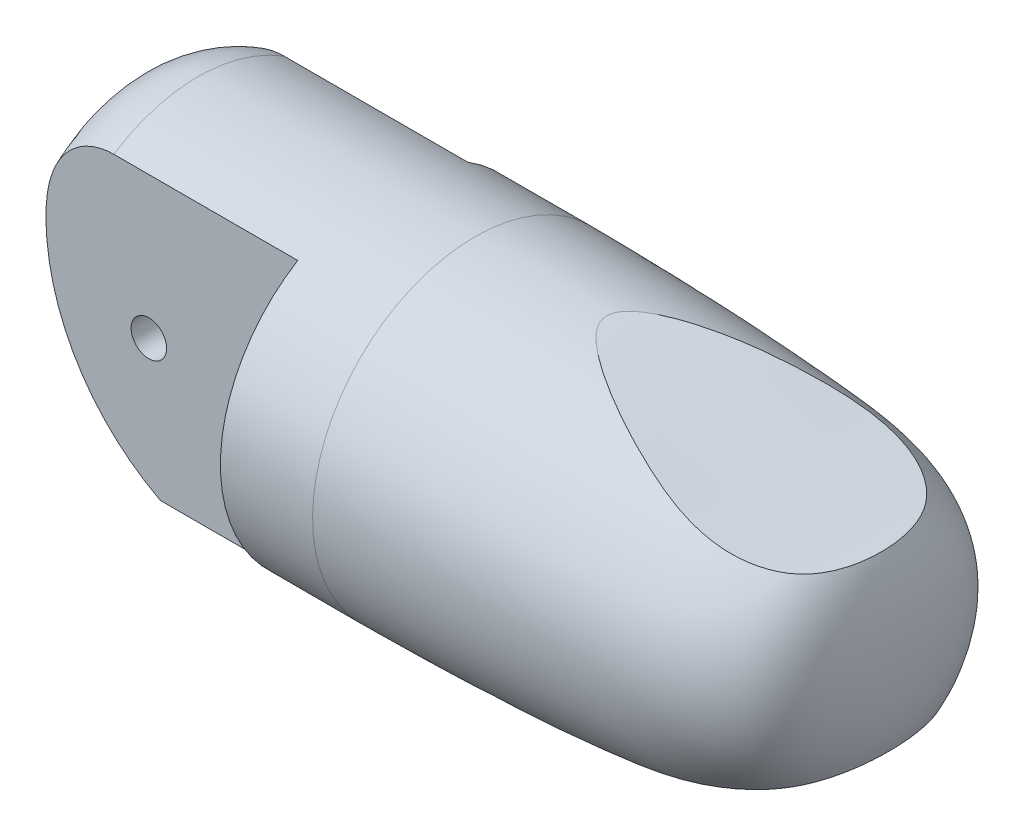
ISO-10303-21;
HEADER;
FILE_DESCRIPTION(('STEP AP214'),'2;1');
FILE_NAME('part.step','',(''),(''),'','','');
FILE_SCHEMA(('AUTOMOTIVE_DESIGN { 1 0 10303 214 1 1 1 1 }'));
ENDSEC;
DATA;
#1=APPLICATION_CONTEXT('core data for automotive mechanical design processes');
#2=APPLICATION_PROTOCOL_DEFINITION('international standard','automotive_design',2000,#1);
#3=PRODUCT_CONTEXT('',#1,'mechanical');
#4=PRODUCT('Part','Part','',(#3));
#5=PRODUCT_RELATED_PRODUCT_CATEGORY('part','',(#4));
#6=PRODUCT_DEFINITION_FORMATION('','',#4);
#7=PRODUCT_DEFINITION_CONTEXT('part definition',#1,'design');
#8=PRODUCT_DEFINITION('design','',#6,#7);
#9=PRODUCT_DEFINITION_SHAPE('','',#8);
#10=(LENGTH_UNIT() NAMED_UNIT(*) SI_UNIT(.MILLI.,.METRE.));
#11=(NAMED_UNIT(*) PLANE_ANGLE_UNIT() SI_UNIT($,.RADIAN.));
#12=(NAMED_UNIT(*) SI_UNIT($,.STERADIAN.) SOLID_ANGLE_UNIT());
#13=UNCERTAINTY_MEASURE_WITH_UNIT(LENGTH_MEASURE(1.E-05),#10,'distance_accuracy_value','');
#14=(GEOMETRIC_REPRESENTATION_CONTEXT(3) GLOBAL_UNCERTAINTY_ASSIGNED_CONTEXT((#13)) GLOBAL_UNIT_ASSIGNED_CONTEXT((#10,
#11,#12)) REPRESENTATION_CONTEXT('',''));
#15=CARTESIAN_POINT('',(0.,0.,0.));
#16=DIRECTION('',(0.,0.,1.));
#17=DIRECTION('',(1.,0.,0.));
#18=AXIS2_PLACEMENT_3D('',#15,#16,#17);
#19=CARTESIAN_POINT('',(-25.,11.45,-11.45));
#20=DIRECTION('',(0.996194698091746,0.0871557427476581,0.));
#21=DIRECTION('',(-0.0871557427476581,0.996194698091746,0.));
#22=AXIS2_PLACEMENT_3D('',#19,#20,#21);
#23=PLANE('',#22);
#24=DIRECTION('',(0.,0.,1.));
#25=VECTOR('',#24,1.);
#26=CARTESIAN_POINT('',(-24.1944624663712,2.24266385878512,-11.45));
#27=LINE('',#26,#25);
#28=CARTESIAN_POINT('',(-24.1944624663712,2.24266385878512,3.));
#29=VERTEX_POINT('',#28);
#30=CARTESIAN_POINT('',(-24.1944624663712,2.24266385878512,5.86757576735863));
#31=VERTEX_POINT('',#30);
#32=EDGE_CURVE('E370',#29,#31,#27,.T.);
#33=ORIENTED_EDGE('',*,*,#32,.T.);
#34=CARTESIAN_POINT('',(-23.9601291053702,-0.43577871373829,0.));
#35=DIRECTION('',(0.996194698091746,0.0871557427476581,0.));
#36=DIRECTION('',(-0.0871557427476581,0.996194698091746,0.));
#37=AXIS2_PLACEMENT_3D('',#34,#35,#36);
#38=ELLIPSE('',#37,6.47463795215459,6.45);
#39=CARTESIAN_POINT('',(-24.4596771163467,5.27408117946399,3.));
#40=VERTEX_POINT('',#39);
#41=EDGE_CURVE('E423',#31,#40,#38,.F.);
#42=ORIENTED_EDGE('',*,*,#41,.T.);
#43=DIRECTION('',(0.0871557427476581,-0.996194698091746,0.));
#44=VECTOR('',#43,1.);
#45=CARTESIAN_POINT('',(-23.0117283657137,-11.2760487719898,3.));
#46=LINE('',#45,#44);
#47=EDGE_CURVE('E210',#40,#29,#46,.T.);
#48=ORIENTED_EDGE('',*,*,#47,.T.);
#49=EDGE_LOOP('',(#33,#42,#48));
#50=FACE_BOUND('',#49,.T.);
#51=ADVANCED_FACE('F36',(#50),#23,.F.);
#52=CARTESIAN_POINT('',(-17.,-0.247948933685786,-11.45));
#53=DIRECTION('',(0.,0.,1.));
#54=DIRECTION('',(1.,0.,0.));
#55=AXIS2_PLACEMENT_3D('',#52,#53,#54);
#56=CYLINDRICAL_SURFACE('',#55,1.25);
#57=CARTESIAN_POINT('',(-17.,-0.247948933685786,-3.));
#58=DIRECTION('',(0.,0.,-1.));
#59=DIRECTION('',(-1.,0.,0.));
#60=AXIS2_PLACEMENT_3D('',#57,#58,#59);
#61=CIRCLE('',#60,1.25);
#62=CARTESIAN_POINT('',(-18.25,-0.247948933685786,-3.));
#63=VERTEX_POINT('',#62);
#64=EDGE_CURVE('E476',#63,#63,#61,.T.);
#65=ORIENTED_EDGE('',*,*,#64,.F.);
#66=EDGE_LOOP('',(#65));
#67=FACE_BOUND('',#66,.T.);
#68=CARTESIAN_POINT('',(-17.,-0.247948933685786,-6.));
#69=DIRECTION('',(0.,0.,1.));
#70=DIRECTION('',(1.,0.,0.));
#71=AXIS2_PLACEMENT_3D('',#68,#69,#70);
#72=CIRCLE('',#71,1.25);
#73=CARTESIAN_POINT('',(-15.75,-0.247948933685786,-6.));
#74=VERTEX_POINT('',#73);
#75=EDGE_CURVE('E367',#74,#74,#72,.T.);
#76=ORIENTED_EDGE('',*,*,#75,.F.);
#77=EDGE_LOOP('',(#76));
#78=FACE_BOUND('',#77,.T.);
#79=ADVANCED_FACE('F488',(#67,#78),#56,.F.);
#80=CARTESIAN_POINT('',(-25.,-11.45,-6.));
#81=DIRECTION('',(0.,0.,1.));
#82=DIRECTION('',(1.,0.,0.));
#83=AXIS2_PLACEMENT_3D('',#80,#81,#82);
#84=PLANE('',#83);
#85=ORIENTED_EDGE('',*,*,#75,.T.);
#86=EDGE_LOOP('',(#85));
#87=FACE_BOUND('',#86,.T.);
#88=CARTESIAN_POINT('',(-9.25154199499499,3.55,-6.));
#89=DIRECTION('',(0.,0.,1.));
#90=DIRECTION('',(1.,0.,0.));
#91=AXIS2_PLACEMENT_3D('',#88,#89,#90);
#92=CIRCLE('',#91,15.);
#93=CARTESIAN_POINT('',(-16.1837449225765,-9.75205106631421,-6.));
#94=VERTEX_POINT('',#93);
#95=CARTESIAN_POINT('',(-24.1831672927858,2.11941761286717,-6.));
#96=VERTEX_POINT('',#95);
#97=EDGE_CURVE('E509',#94,#96,#92,.F.);
#98=ORIENTED_EDGE('',*,*,#97,.T.);
#99=CARTESIAN_POINT('',(-24.5244309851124,6.01422128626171,0.));
#100=CARTESIAN_POINT('',(-25.,11.45,0.));
#101=CARTESIAN_POINT('',(-19.5434574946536,11.45,0.));
#102=CARTESIAN_POINT('',(-24.5244309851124,6.01422128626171,0.28143997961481));
#103=CARTESIAN_POINT('',(-25.,11.45,0.520440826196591));
#104=CARTESIAN_POINT('',(-19.5434574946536,11.45,0.499610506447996));
#105=CARTESIAN_POINT('',(-24.5228170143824,5.9957735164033,0.562879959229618));
#106=CARTESIAN_POINT('',(-24.9968964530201,11.4145262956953,1.04073952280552));
#107=CARTESIAN_POINT('',(-19.5418435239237,11.4172516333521,0.999221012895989));
#108=CARTESIAN_POINT('',(-24.5163891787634,5.9223030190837,1.12094399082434));
#109=CARTESIAN_POINT('',(-24.9845439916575,11.2733370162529,2.07155251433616));
#110=CARTESIAN_POINT('',(-19.5354156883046,11.2868272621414,1.98989282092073));
#111=CARTESIAN_POINT('',(-24.5115749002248,5.86727556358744,1.39756741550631));
#112=CARTESIAN_POINT('',(-24.9753009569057,11.1676886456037,2.58179243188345));
#113=CARTESIAN_POINT('',(-19.530601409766,11.1891428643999,2.48095300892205));
#114=CARTESIAN_POINT('',(-24.4988292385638,5.7215919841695,1.94126612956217));
#115=CARTESIAN_POINT('',(-24.9508644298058,10.8883778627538,3.58266956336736));
#116=CARTESIAN_POINT('',(-19.5178557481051,10.9305262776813,3.44612359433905));
#117=CARTESIAN_POINT('',(-24.4908970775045,5.63092696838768,2.20833901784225));
#118=CARTESIAN_POINT('',(-24.9356822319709,10.7148445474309,4.07306123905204));
#119=CARTESIAN_POINT('',(-19.5099235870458,10.769578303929,3.92022972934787));
#120=CARTESIAN_POINT('',(-24.4720517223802,5.41552357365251,2.72836899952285));
#121=CARTESIAN_POINT('',(-24.8996886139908,10.3034356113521,5.02493096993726));
#122=CARTESIAN_POINT('',(-19.4910782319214,10.3871955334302,4.84338372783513));
#123=CARTESIAN_POINT('',(-24.4611374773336,5.2907731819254,2.98132107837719));
#124=CARTESIAN_POINT('',(-24.8788930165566,10.0657408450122,5.4862089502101));
#125=CARTESIAN_POINT('',(-19.4801639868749,10.1657394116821,5.29242268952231));
#126=CARTESIAN_POINT('',(-24.4365149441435,5.00933633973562,3.4687841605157));
#127=CARTESIAN_POINT('',(-24.8321090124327,9.53099723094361,6.37127845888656));
#128=CARTESIAN_POINT('',(-19.4555414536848,9.66613447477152,6.15776412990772));
#129=CARTESIAN_POINT('',(-24.4228054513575,4.85263612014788,3.70328715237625));
#130=CARTESIAN_POINT('',(-24.8061397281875,9.23416695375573,6.79492838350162));
#131=CARTESIAN_POINT('',(-19.4418319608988,9.38796121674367,6.57405238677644));
#132=CARTESIAN_POINT('',(-24.3928271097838,4.50998210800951,4.14984271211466));
#133=CARTESIAN_POINT('',(-24.7495453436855,8.58729017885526,7.59710103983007));
#134=CARTESIAN_POINT('',(-19.411853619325,8.77968393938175,7.36677504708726));
#135=CARTESIAN_POINT('',(-24.3765570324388,4.32401427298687,4.36188442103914));
#136=CARTESIAN_POINT('',(-24.7189412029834,8.23748324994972,7.97554911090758));
#137=CARTESIAN_POINT('',(-19.3955835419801,8.44955499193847,7.74319017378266));
#138=CARTESIAN_POINT('',(-24.3417358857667,3.92600674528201,4.75989208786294));
#139=CARTESIAN_POINT('',(-24.6536976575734,7.49174611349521,8.68076008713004));
#140=CARTESIAN_POINT('',(-19.3607623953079,7.74301449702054,8.44973091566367));
#141=CARTESIAN_POINT('',(-24.323183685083,3.71395412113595,4.94584501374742));
#142=CARTESIAN_POINT('',(-24.6190794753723,7.09605848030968,9.00751872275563));
#143=CARTESIAN_POINT('',(-19.3422101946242,7.36657999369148,8.77983339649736));
#144=CARTESIAN_POINT('',(-24.2841155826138,3.26740366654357,5.2884953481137));
#145=CARTESIAN_POINT('',(-24.5464935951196,6.26639807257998,9.60398035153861));
#146=CARTESIAN_POINT('',(-19.303142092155,6.57386639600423,9.38810414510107));
#147=CARTESIAN_POINT('',(-24.2635987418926,3.0328951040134,5.44517866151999));
#148=CARTESIAN_POINT('',(-24.508545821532,5.83265303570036,9.87374784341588));
#149=CARTESIAN_POINT('',(-19.2826252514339,6.15756825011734,9.66624739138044));
#150=CARTESIAN_POINT('',(-24.2209521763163,2.54544262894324,5.72660957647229));
#151=CARTESIAN_POINT('',(-24.4300330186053,4.93524759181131,10.3521040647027));
#152=CARTESIAN_POINT('',(-19.2399786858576,5.29224563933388,10.1658418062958));
#153=CARTESIAN_POINT('',(-24.1988217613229,2.29249082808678,5.85134340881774));
#154=CARTESIAN_POINT('',(-24.3894851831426,4.47178371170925,10.5608197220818));
#155=CARTESIAN_POINT('',(-19.2178482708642,4.84320717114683,10.3872685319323));
#156=CARTESIAN_POINT('',(-24.1533264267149,1.77247677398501,6.06674035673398));
#157=CARTESIAN_POINT('',(-24.3065328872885,3.52363463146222,10.9142155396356));
#158=CARTESIAN_POINT('',(-19.1723529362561,3.92008144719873,10.7696398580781));
#159=CARTESIAN_POINT('',(-24.1299610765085,1.50540959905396,6.1573914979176));
#160=CARTESIAN_POINT('',(-24.2641416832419,3.03910095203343,11.0590746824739));
#161=CARTESIAN_POINT('',(-19.1489875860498,3.44598545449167,10.9305632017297));
#162=CARTESIAN_POINT('',(-24.0823953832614,0.961731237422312,6.30306972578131));
#163=CARTESIAN_POINT('',(-24.1782747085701,2.05763694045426,11.2831513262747));
#164=CARTESIAN_POINT('',(-19.1014218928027,2.48085099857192,11.1891702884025));
#165=CARTESIAN_POINT('',(-24.0581948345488,0.685117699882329,6.35808797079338));
#166=CARTESIAN_POINT('',(-24.134807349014,1.56080274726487,11.3625863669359));
#167=CARTESIAN_POINT('',(-19.0772213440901,1.98980836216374,11.2868383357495));
#168=CARTESIAN_POINT('',(-24.0093725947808,0.127076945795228,6.43155545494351));
#169=CARTESIAN_POINT('',(-24.0475562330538,0.563517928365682,11.4554155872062));
#170=CARTESIAN_POINT('',(-19.028399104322,0.999177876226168,11.4172573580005));
#171=CARTESIAN_POINT('',(-23.9847508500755,-0.154350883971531,6.45));
#172=CARTESIAN_POINT('',(-24.0037754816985,0.0631016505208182,11.4690502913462));
#173=CARTESIAN_POINT('',(-19.0037773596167,0.499588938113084,11.45));
#174=CARTESIAN_POINT('',(-23.9355073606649,-0.717206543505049,6.45));
#175=CARTESIAN_POINT('',(-23.9166483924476,-0.932765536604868,11.4310220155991));
#176=CARTESIAN_POINT('',(-18.9545338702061,-0.499588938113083,11.45));
#177=CARTESIAN_POINT('',(-23.9108856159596,-0.998634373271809,6.43155545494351));
#178=CARTESIAN_POINT('',(-23.8732994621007,-1.42824607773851,11.3796059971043));
#179=CARTESIAN_POINT('',(-18.9299121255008,-0.999177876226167,11.4172573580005));
#180=CARTESIAN_POINT('',(-23.8620633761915,-1.55667512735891,6.35808797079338));
#181=CARTESIAN_POINT('',(-23.7877578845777,-2.40599078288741,11.2132828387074));
#182=CARTESIAN_POINT('',(-18.8810898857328,-1.98980836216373,11.2868383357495));
#183=CARTESIAN_POINT('',(-23.8378628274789,-1.83328866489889,6.30306972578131));
#184=CARTESIAN_POINT('',(-23.7455572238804,-2.88834654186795,11.0986126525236));
#185=CARTESIAN_POINT('',(-18.8568893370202,-2.48085099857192,11.1891702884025));
#186=CARTESIAN_POINT('',(-23.7902971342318,-2.37696702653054,6.1573914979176));
#187=CARTESIAN_POINT('',(-23.6629953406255,-3.83203318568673,10.8085629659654));
#188=CARTESIAN_POINT('',(-18.8093236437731,-3.44598545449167,10.9305632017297));
#189=CARTESIAN_POINT('',(-23.7669317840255,-2.64403420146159,6.06674035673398));
#190=CARTESIAN_POINT('',(-23.6226212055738,-4.29351166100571,10.6333950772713));
#191=CARTESIAN_POINT('',(-18.7859582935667,-3.92008144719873,10.7696398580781));
#192=CARTESIAN_POINT('',(-23.7214364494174,-3.16404825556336,5.85134340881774));
#193=CARTESIAN_POINT('',(-23.5443486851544,-5.18817066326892,10.2260139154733));
#194=CARTESIAN_POINT('',(-18.7404629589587,-4.84320717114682,10.3872685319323));
#195=CARTESIAN_POINT('',(-23.699306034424,-3.41700005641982,5.7266095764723));
#196=CARTESIAN_POINT('',(-23.5064333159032,-5.62154531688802,9.99397358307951));
#197=CARTESIAN_POINT('',(-18.7183325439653,-5.29224563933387,10.1658418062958));
#198=CARTESIAN_POINT('',(-23.6566594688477,-3.90445253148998,5.44517866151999));
#199=CARTESIAN_POINT('',(-23.4336611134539,-6.4533353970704,9.47729845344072));
#200=CARTESIAN_POINT('',(-18.675685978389,-6.15756825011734,9.66624739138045));
#201=CARTESIAN_POINT('',(-23.6361426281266,-4.13896109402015,5.2884953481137));
#202=CARTESIAN_POINT('',(-23.3987843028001,-6.85197916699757,9.19278735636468));
#203=CARTESIAN_POINT('',(-18.6551691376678,-6.57386639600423,9.38810414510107));
#204=CARTESIAN_POINT('',(-23.5970745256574,-4.58551154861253,4.94584501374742));
#205=CARTESIAN_POINT('',(-23.3326130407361,-7.60832015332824,8.5763134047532));
#206=CARTESIAN_POINT('',(-18.6161010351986,-7.36657999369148,8.77983339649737));
#207=CARTESIAN_POINT('',(-23.5785223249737,-4.79756417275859,4.75989208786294));
#208=CARTESIAN_POINT('',(-23.3012968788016,-7.96626552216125,8.24441778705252));
#209=CARTESIAN_POINT('',(-18.5975488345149,-7.74301449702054,8.44973091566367));
#210=CARTESIAN_POINT('',(-23.5437011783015,-5.19557170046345,4.36188442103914));
#211=CARTESIAN_POINT('',(-23.2427073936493,-8.63594640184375,7.53891514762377));
#212=CARTESIAN_POINT('',(-18.5627276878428,-8.44955499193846,7.74319017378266));
#213=CARTESIAN_POINT('',(-23.5274311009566,-5.38153953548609,4.14984271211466));
#214=CARTESIAN_POINT('',(-23.215411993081,-8.94793425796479,7.16531542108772));
#215=CARTESIAN_POINT('',(-18.5464576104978,-8.77968393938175,7.36677504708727));
#216=CARTESIAN_POINT('',(-23.4974527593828,-5.72419354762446,3.70328715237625));
#217=CARTESIAN_POINT('',(-23.1652576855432,-9.52120061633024,6.38265003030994));
#218=CARTESIAN_POINT('',(-18.5164792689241,-9.38796121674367,6.57405238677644));
#219=CARTESIAN_POINT('',(-23.4837432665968,-5.8808937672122,3.4687841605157));
#220=CARTESIAN_POINT('',(-23.1423777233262,-9.78271978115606,5.97353217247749));
#221=CARTESIAN_POINT('',(-18.5027697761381,-9.66613447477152,6.15776412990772));
#222=CARTESIAN_POINT('',(-23.4591207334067,-6.16233060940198,2.98132107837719));
#223=CARTESIAN_POINT('',(-23.1013784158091,-10.2513440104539,5.12649035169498));
#224=CARTESIAN_POINT('',(-18.478147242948,-10.1657394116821,5.29242268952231));
#225=CARTESIAN_POINT('',(-23.4482064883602,-6.28708100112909,2.72836899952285));
#226=CARTESIAN_POINT('',(-23.0832403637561,-10.4586628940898,4.68845904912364));
#227=CARTESIAN_POINT('',(-18.4672329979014,-10.3871955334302,4.84338372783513));
#228=CARTESIAN_POINT('',(-23.4293611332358,-6.50248439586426,2.20833901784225));
#229=CARTESIAN_POINT('',(-23.051977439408,-10.815999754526,3.79057555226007));
#230=CARTESIAN_POINT('',(-18.4483876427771,-10.769578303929,3.92022972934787));
#231=CARTESIAN_POINT('',(-23.4214289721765,-6.59314941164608,1.94126612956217));
#232=CARTESIAN_POINT('',(-23.0388373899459,-10.9661912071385,3.33056882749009));
#233=CARTESIAN_POINT('',(-18.4404554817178,-10.9305262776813,3.44612359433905));
#234=CARTESIAN_POINT('',(-23.4086833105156,-6.73883299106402,1.39756741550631));
#235=CARTESIAN_POINT('',(-23.0177500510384,-11.2072205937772,2.39595774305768));
#236=CARTESIAN_POINT('',(-18.4277098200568,-11.1891428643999,2.48095300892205));
#237=CARTESIAN_POINT('',(-23.403869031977,-6.79386044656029,1.12094399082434));
#238=CARTESIAN_POINT('',(-23.0097920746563,-11.2981806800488,1.92116272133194));
#239=CARTESIAN_POINT('',(-18.4228955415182,-11.2868272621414,1.98989282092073));
#240=CARTESIAN_POINT('',(-23.3974411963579,-6.86733094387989,0.56287995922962));
#241=CARTESIAN_POINT('',(-22.9991746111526,-11.4195388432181,0.96435051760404));
#242=CARTESIAN_POINT('',(-18.4164677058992,-11.4172516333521,0.999221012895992));
#243=CARTESIAN_POINT('',(-23.395827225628,-6.88577871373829,0.28143997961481));
#244=CARTESIAN_POINT('',(-22.9965096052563,-11.45,0.482119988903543));
#245=CARTESIAN_POINT('',(-18.4148537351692,-11.45,0.499610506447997));
#246=CARTESIAN_POINT('',(-23.395827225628,-6.88577871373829,-0.281439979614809));
#247=CARTESIAN_POINT('',(-22.9965096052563,-11.45,-0.48211998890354));
#248=CARTESIAN_POINT('',(-18.4148537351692,-11.45,-0.499610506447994));
#249=CARTESIAN_POINT('',(-23.3974411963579,-6.86733094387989,-0.562879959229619));
#250=CARTESIAN_POINT('',(-22.9991746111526,-11.4195388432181,-0.964350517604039));
#251=CARTESIAN_POINT('',(-18.4164677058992,-11.4172516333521,-0.99922101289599));
#252=CARTESIAN_POINT('',(-23.403869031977,-6.79386044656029,-1.12094399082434));
#253=CARTESIAN_POINT('',(-23.0097920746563,-11.2981806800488,-1.92116272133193));
#254=CARTESIAN_POINT('',(-18.4228955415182,-11.2868272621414,-1.98989282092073));
#255=CARTESIAN_POINT('',(-23.4086833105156,-6.73883299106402,-1.39756741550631));
#256=CARTESIAN_POINT('',(-23.0177500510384,-11.2072205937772,-2.39595774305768));
#257=CARTESIAN_POINT('',(-18.4277098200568,-11.1891428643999,-2.48095300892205));
#258=CARTESIAN_POINT('',(-23.4214289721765,-6.59314941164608,-1.94126612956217));
#259=CARTESIAN_POINT('',(-23.0388373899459,-10.9661912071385,-3.33056882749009));
#260=CARTESIAN_POINT('',(-18.4404554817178,-10.9305262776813,-3.44612359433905));
#261=CARTESIAN_POINT('',(-23.4293611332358,-6.50248439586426,-2.20833901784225));
#262=CARTESIAN_POINT('',(-23.051977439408,-10.815999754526,-3.79057555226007));
#263=CARTESIAN_POINT('',(-18.4483876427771,-10.769578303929,-3.92022972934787));
#264=CARTESIAN_POINT('',(-23.4482064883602,-6.28708100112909,-2.72836899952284));
#265=CARTESIAN_POINT('',(-23.0832403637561,-10.4586628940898,-4.68845904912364));
#266=CARTESIAN_POINT('',(-18.4672329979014,-10.3871955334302,-4.84338372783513));
#267=CARTESIAN_POINT('',(-23.4591207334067,-6.16233060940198,-2.98132107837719));
#268=CARTESIAN_POINT('',(-23.1013784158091,-10.2513440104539,-5.12649035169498));
#269=CARTESIAN_POINT('',(-18.478147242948,-10.1657394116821,-5.2924226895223));
#270=CARTESIAN_POINT('',(-23.4837432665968,-5.8808937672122,-3.4687841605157));
#271=CARTESIAN_POINT('',(-23.1423777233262,-9.78271978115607,-5.97353217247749));
#272=CARTESIAN_POINT('',(-18.5027697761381,-9.66613447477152,-6.15776412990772));
#273=CARTESIAN_POINT('',(-23.4974527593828,-5.72419354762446,-3.70328715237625));
#274=CARTESIAN_POINT('',(-23.1652576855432,-9.52120061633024,-6.38265003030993));
#275=CARTESIAN_POINT('',(-18.5164792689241,-9.38796121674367,-6.57405238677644));
#276=CARTESIAN_POINT('',(-23.5274311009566,-5.38153953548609,-4.14984271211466));
#277=CARTESIAN_POINT('',(-23.215411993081,-8.94793425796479,-7.16531542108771));
#278=CARTESIAN_POINT('',(-18.5464576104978,-8.77968393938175,-7.36677504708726));
#279=CARTESIAN_POINT('',(-23.5437011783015,-5.19557170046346,-4.36188442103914));
#280=CARTESIAN_POINT('',(-23.2427073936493,-8.63594640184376,-7.53891514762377));
#281=CARTESIAN_POINT('',(-18.5627276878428,-8.44955499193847,-7.74319017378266));
#282=CARTESIAN_POINT('',(-23.5785223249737,-4.7975641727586,-4.75989208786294));
#283=CARTESIAN_POINT('',(-23.3012968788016,-7.96626552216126,-8.24441778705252));
#284=CARTESIAN_POINT('',(-18.5975488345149,-7.74301449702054,-8.44973091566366));
#285=CARTESIAN_POINT('',(-23.5970745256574,-4.58551154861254,-4.94584501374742));
#286=CARTESIAN_POINT('',(-23.3326130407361,-7.60832015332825,-8.5763134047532));
#287=CARTESIAN_POINT('',(-18.6161010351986,-7.36657999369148,-8.77983339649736));
#288=CARTESIAN_POINT('',(-23.6361426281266,-4.13896109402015,-5.2884953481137));
#289=CARTESIAN_POINT('',(-23.3987843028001,-6.85197916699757,-9.19278735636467));
#290=CARTESIAN_POINT('',(-18.6551691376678,-6.57386639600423,-9.38810414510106));
#291=CARTESIAN_POINT('',(-23.6566594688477,-3.90445253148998,-5.44517866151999));
#292=CARTESIAN_POINT('',(-23.4336611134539,-6.45333539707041,-9.47729845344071));
#293=CARTESIAN_POINT('',(-18.675685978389,-6.15756825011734,-9.66624739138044));
#294=CARTESIAN_POINT('',(-23.699306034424,-3.41700005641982,-5.72660957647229));
#295=CARTESIAN_POINT('',(-23.5064333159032,-5.62154531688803,-9.9939735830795));
#296=CARTESIAN_POINT('',(-18.7183325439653,-5.29224563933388,-10.1658418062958));
#297=CARTESIAN_POINT('',(-23.7214364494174,-3.16404825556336,-5.85134340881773));
#298=CARTESIAN_POINT('',(-23.5443486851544,-5.18817066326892,-10.2260139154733));
#299=CARTESIAN_POINT('',(-18.7404629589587,-4.84320717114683,-10.3872685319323));
#300=CARTESIAN_POINT('',(-23.7669317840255,-2.64403420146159,-6.06674035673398));
#301=CARTESIAN_POINT('',(-23.6226212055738,-4.29351166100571,-10.6333950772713));
#302=CARTESIAN_POINT('',(-18.7859582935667,-3.92008144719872,-10.7696398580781));
#303=CARTESIAN_POINT('',(-23.7902971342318,-2.37696702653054,-6.1573914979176));
#304=CARTESIAN_POINT('',(-23.6629953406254,-3.83203318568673,-10.8085629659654));
#305=CARTESIAN_POINT('',(-18.8093236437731,-3.44598545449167,-10.9305632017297));
#306=CARTESIAN_POINT('',(-23.8378628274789,-1.83328866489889,-6.30306972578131));
#307=CARTESIAN_POINT('',(-23.7455572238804,-2.88834654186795,-11.0986126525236));
#308=CARTESIAN_POINT('',(-18.8568893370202,-2.48085099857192,-11.1891702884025));
#309=CARTESIAN_POINT('',(-23.8620633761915,-1.55667512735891,-6.35808797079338));
#310=CARTESIAN_POINT('',(-23.7877578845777,-2.40599078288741,-11.2132828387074));
#311=CARTESIAN_POINT('',(-18.8810898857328,-1.98980836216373,-11.2868383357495));
#312=CARTESIAN_POINT('',(-23.9108856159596,-0.998634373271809,-6.43155545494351));
#313=CARTESIAN_POINT('',(-23.8732994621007,-1.42824607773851,-11.3796059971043));
#314=CARTESIAN_POINT('',(-18.9299121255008,-0.999177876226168,-11.4172573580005));
#315=CARTESIAN_POINT('',(-23.9355073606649,-0.717206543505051,-6.45));
#316=CARTESIAN_POINT('',(-23.9166483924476,-0.93276553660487,-11.4310220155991));
#317=CARTESIAN_POINT('',(-18.9545338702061,-0.499588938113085,-11.45));
#318=CARTESIAN_POINT('',(-23.9847508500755,-0.154350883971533,-6.45));
#319=CARTESIAN_POINT('',(-24.0037754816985,0.0631016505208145,-11.4690502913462));
#320=CARTESIAN_POINT('',(-19.0037773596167,0.499588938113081,-11.45));
#321=CARTESIAN_POINT('',(-24.0093725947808,0.127076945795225,-6.43155545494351));
#322=CARTESIAN_POINT('',(-24.0475562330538,0.563517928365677,-11.4554155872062));
#323=CARTESIAN_POINT('',(-19.028399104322,0.999177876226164,-11.4172573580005));
#324=CARTESIAN_POINT('',(-24.0581948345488,0.685117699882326,-6.35808797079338));
#325=CARTESIAN_POINT('',(-24.134807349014,1.56080274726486,-11.3625863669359));
#326=CARTESIAN_POINT('',(-19.0772213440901,1.98980836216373,-11.2868383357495));
#327=CARTESIAN_POINT('',(-24.0823953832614,0.961731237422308,-6.30306972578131));
#328=CARTESIAN_POINT('',(-24.1782747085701,2.05763694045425,-11.2831513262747));
#329=CARTESIAN_POINT('',(-19.1014218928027,2.48085099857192,-11.1891702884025));
#330=CARTESIAN_POINT('',(-24.1299610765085,1.50540959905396,-6.1573914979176));
#331=CARTESIAN_POINT('',(-24.2641416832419,3.03910095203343,-11.0590746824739));
#332=CARTESIAN_POINT('',(-19.1489875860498,3.44598545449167,-10.9305632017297));
#333=CARTESIAN_POINT('',(-24.1533264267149,1.77247677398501,-6.06674035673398));
#334=CARTESIAN_POINT('',(-24.3065328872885,3.52363463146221,-10.9142155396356));
#335=CARTESIAN_POINT('',(-19.1723529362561,3.92008144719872,-10.7696398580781));
#336=CARTESIAN_POINT('',(-24.1988217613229,2.29249082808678,-5.85134340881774));
#337=CARTESIAN_POINT('',(-24.3894851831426,4.47178371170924,-10.5608197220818));
#338=CARTESIAN_POINT('',(-19.2178482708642,4.84320717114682,-10.3872685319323));
#339=CARTESIAN_POINT('',(-24.2209521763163,2.54544262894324,-5.72660957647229));
#340=CARTESIAN_POINT('',(-24.4300330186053,4.93524759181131,-10.3521040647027));
#341=CARTESIAN_POINT('',(-19.2399786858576,5.29224563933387,-10.1658418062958));
#342=CARTESIAN_POINT('',(-24.2635987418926,3.0328951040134,-5.44517866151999));
#343=CARTESIAN_POINT('',(-24.508545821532,5.83265303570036,-9.87374784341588));
#344=CARTESIAN_POINT('',(-19.2826252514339,6.15756825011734,-9.66624739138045));
#345=CARTESIAN_POINT('',(-24.2841155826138,3.26740366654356,-5.2884953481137));
#346=CARTESIAN_POINT('',(-24.5464935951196,6.26639807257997,-9.60398035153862));
#347=CARTESIAN_POINT('',(-19.303142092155,6.57386639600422,-9.38810414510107));
#348=CARTESIAN_POINT('',(-24.323183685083,3.71395412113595,-4.94584501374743));
#349=CARTESIAN_POINT('',(-24.6190794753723,7.09605848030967,-9.00751872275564));
#350=CARTESIAN_POINT('',(-19.3422101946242,7.36657999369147,-8.77983339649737));
#351=CARTESIAN_POINT('',(-24.3417358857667,3.92600674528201,-4.75989208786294));
#352=CARTESIAN_POINT('',(-24.6536976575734,7.4917461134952,-8.68076008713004));
#353=CARTESIAN_POINT('',(-19.3607623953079,7.74301449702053,-8.44973091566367));
#354=CARTESIAN_POINT('',(-24.3765570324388,4.32401427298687,-4.36188442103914));
#355=CARTESIAN_POINT('',(-24.7189412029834,8.23748324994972,-7.97554911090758));
#356=CARTESIAN_POINT('',(-19.3955835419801,8.44955499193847,-7.74319017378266));
#357=CARTESIAN_POINT('',(-24.3928271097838,4.50998210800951,-4.14984271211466));
#358=CARTESIAN_POINT('',(-24.7495453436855,8.58729017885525,-7.59710103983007));
#359=CARTESIAN_POINT('',(-19.411853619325,8.77968393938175,-7.36677504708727));
#360=CARTESIAN_POINT('',(-24.4228054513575,4.85263612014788,-3.70328715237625));
#361=CARTESIAN_POINT('',(-24.8061397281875,9.23416695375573,-6.79492838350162));
#362=CARTESIAN_POINT('',(-19.4418319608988,9.38796121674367,-6.57405238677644));
#363=CARTESIAN_POINT('',(-24.4365149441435,5.00933633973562,-3.46878416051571));
#364=CARTESIAN_POINT('',(-24.8321090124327,9.53099723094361,-6.37127845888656));
#365=CARTESIAN_POINT('',(-19.4555414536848,9.66613447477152,-6.15776412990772));
#366=CARTESIAN_POINT('',(-24.4611374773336,5.2907731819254,-2.9813210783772));
#367=CARTESIAN_POINT('',(-24.8788930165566,10.0657408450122,-5.4862089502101));
#368=CARTESIAN_POINT('',(-19.4801639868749,10.1657394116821,-5.29242268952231));
#369=CARTESIAN_POINT('',(-24.4720517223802,5.41552357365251,-2.72836899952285));
#370=CARTESIAN_POINT('',(-24.8996886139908,10.3034356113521,-5.02493096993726));
#371=CARTESIAN_POINT('',(-19.4910782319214,10.3871955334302,-4.84338372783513));
#372=CARTESIAN_POINT('',(-24.4908970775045,5.63092696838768,-2.20833901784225));
#373=CARTESIAN_POINT('',(-24.9356822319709,10.7148445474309,-4.07306123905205));
#374=CARTESIAN_POINT('',(-19.5099235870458,10.769578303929,-3.92022972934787));
#375=CARTESIAN_POINT('',(-24.4988292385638,5.7215919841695,-1.94126612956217));
#376=CARTESIAN_POINT('',(-24.9508644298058,10.8883778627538,-3.58266956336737));
#377=CARTESIAN_POINT('',(-19.5178557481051,10.9305262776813,-3.44612359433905));
#378=CARTESIAN_POINT('',(-24.5115749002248,5.86727556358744,-1.39756741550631));
#379=CARTESIAN_POINT('',(-24.9753009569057,11.1676886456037,-2.58179243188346));
#380=CARTESIAN_POINT('',(-19.530601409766,11.1891428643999,-2.48095300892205));
#381=CARTESIAN_POINT('',(-24.5163891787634,5.9223030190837,-1.12094399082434));
#382=CARTESIAN_POINT('',(-24.9845439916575,11.2733370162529,-2.07155251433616));
#383=CARTESIAN_POINT('',(-19.5354156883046,11.2868272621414,-1.98989282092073));
#384=CARTESIAN_POINT('',(-24.5228170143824,5.9957735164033,-0.562879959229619));
#385=CARTESIAN_POINT('',(-24.9968964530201,11.4145262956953,-1.04073952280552));
#386=CARTESIAN_POINT('',(-19.5418435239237,11.4172516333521,-0.99922101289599));
#387=CARTESIAN_POINT('',(-24.5244309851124,6.01422128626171,-0.281439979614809));
#388=CARTESIAN_POINT('',(-25.,11.45,-0.52044082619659));
#389=CARTESIAN_POINT('',(-19.5434574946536,11.45,-0.499610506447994));
#390=CARTESIAN_POINT('',(-24.5244309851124,6.01422128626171,0.));
#391=CARTESIAN_POINT('',(-25.,11.45,0.));
#392=CARTESIAN_POINT('',(-19.5434574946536,11.45,0.));
#393=(BOUNDED_SURFACE() B_SPLINE_SURFACE(3,2,((#99,#100,#101),(#102,#103,#104),(#105,#106,#107),
(#108,#109,#110),(#111,#112,#113),(#114,#115,#116),(#117,#118,#119),(#120,#121,#122),(#123,#124,
#125),(#126,#127,#128),(#129,#130,#131),(#132,#133,#134),(#135,#136,#137),(#138,#139,#140),
(#141,#142,#143),(#144,#145,#146),(#147,#148,#149),(#150,#151,#152),(#153,#154,#155),(#156,#157,
#158),(#159,#160,#161),(#162,#163,#164),(#165,#166,#167),(#168,#169,#170),(#171,#172,#173),
(#174,#175,#176),(#177,#178,#179),(#180,#181,#182),(#183,#184,#185),(#186,#187,#188),(#189,#190,
#191),(#192,#193,#194),(#195,#196,#197),(#198,#199,#200),(#201,#202,#203),(#204,#205,#206),
(#207,#208,#209),(#210,#211,#212),(#213,#214,#215),(#216,#217,#218),(#219,#220,#221),(#222,#223,
#224),(#225,#226,#227),(#228,#229,#230),(#231,#232,#233),(#234,#235,#236),(#237,#238,#239),
(#240,#241,#242),(#243,#244,#245),(#246,#247,#248),(#249,#250,#251),(#252,#253,#254),(#255,#256,
#257),(#258,#259,#260),(#261,#262,#263),(#264,#265,#266),(#267,#268,#269),(#270,#271,#272),
(#273,#274,#275),(#276,#277,#278),(#279,#280,#281),(#282,#283,#284),(#285,#286,#287),(#288,#289,
#290),(#291,#292,#293),(#294,#295,#296),(#297,#298,#299),(#300,#301,#302),(#303,#304,#305),
(#306,#307,#308),(#309,#310,#311),(#312,#313,#314),(#315,#316,#317),(#318,#319,#320),(#321,#322,
#323),(#324,#325,#326),(#327,#328,#329),(#330,#331,#332),(#333,#334,#335),(#336,#337,#338),
(#339,#340,#341),(#342,#343,#344),(#345,#346,#347),(#348,#349,#350),(#351,#352,#353),(#354,#355,
#356),(#357,#358,#359),(#360,#361,#362),(#363,#364,#365),(#366,#367,#368),(#369,#370,#371),
(#372,#373,#374),(#375,#376,#377),(#378,#379,#380),(#381,#382,#383),(#384,#385,#386),(#387,#388,
#389),(#390,#391,#392)),.UNSPECIFIED.,.T.,.F.,.F.) B_SPLINE_SURFACE_WITH_KNOTS((4,2,2,2,2,2,2,2,
2,2,2,2,2,2,2,2,2,2,2,2,2,2,2,2,2,2,2,2,2,2,2,2,2,2,2,2,2,2,2,2,2,2,2,2,2,2,2,2,4),(3,3),(0.,
0.843714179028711,1.68753743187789,2.53157135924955,3.37590313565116,4.22059955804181,
5.06570250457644,5.91122610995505,6.75715584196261,7.60344953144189,8.45004027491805,
9.29684100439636,10.1437504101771,10.9906598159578,11.8374605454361,12.6840512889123,
13.5303449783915,14.3762747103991,15.2217983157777,16.0669012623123,16.911597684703,
17.7559294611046,18.5999633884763,19.4437866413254,20.2875008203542,21.1312149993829,
21.975038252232,22.8190721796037,23.6634039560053,24.508100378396,25.3532033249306,
26.1987269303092,27.0446566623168,27.8909503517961,28.7375410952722,29.5843418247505,
30.4312512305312,31.278160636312,32.1249613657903,32.9715521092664,33.8178457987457,
34.6637755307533,35.5092991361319,36.3544020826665,37.1990985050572,38.0434302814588,
38.8874642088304,39.7312874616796,40.5750016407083),(0.,1.),
.UNSPECIFIED.) GEOMETRIC_REPRESENTATION_ITEM() RATIONAL_B_SPLINE_SURFACE(((1.,0.67559020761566,
1.),(1.,0.67559020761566,1.),(1.,0.675682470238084,1.),(1.,0.676049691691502,1.),(1.,
0.676324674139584,1.),(1.,0.677051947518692,1.),(1.,0.677504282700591,1.),(1.,0.678577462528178,
1.),(1.,0.679198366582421,1.),(1.,0.680596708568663,1.),(1.,0.681374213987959,1.),(1.,
0.683070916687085,1.),(1.,0.683990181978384,1.),(1.,0.685953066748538,1.),(1.,0.68699674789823,
1.),(1.,0.689189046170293,1.),(1.,0.690337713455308,1.),(1.,0.692718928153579,1.),(1.,
0.693951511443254,1.),(1.,0.69647831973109,1.),(1.,0.697772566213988,1.),(1.,0.700399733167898,
1.),(1.,0.701732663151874,1.),(1.,0.704413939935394,1.),(1.,0.70576228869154,1.),(1.,
0.708451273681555,1.),(1.,0.709791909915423,1.),(1.,0.712442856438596,1.),(1.,0.713753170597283,
1.),(1.,0.71632172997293,1.),(1.,0.717579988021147,1.),(1.,0.720023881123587,1.),(1.,
0.721209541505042,1.),(1.,0.723489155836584,1.),(1.,0.724583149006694,1.),(1.,0.726662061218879,
1.),(1.,0.727647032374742,1.),(1.,0.729492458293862,1.),(1.,0.730352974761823,1.),(1.,
0.731936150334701,1.),(1.,0.732658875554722,1.),(1.,0.733955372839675,1.),(1.,0.734529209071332,
1.),(1.,0.73551919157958,1.),(1.,0.735935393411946,1.),(1.,0.736603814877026,1.),(1.,
0.736856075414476,1.),(1.,0.737192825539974,1.),(1.,0.737277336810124,1.),(1.,0.737277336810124,
1.),(1.,0.737192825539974,1.),(1.,0.736856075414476,1.),(1.,0.736603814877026,1.),(1.,
0.735935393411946,1.),(1.,0.73551919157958,1.),(1.,0.734529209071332,1.),(1.,0.733955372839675,
1.),(1.,0.732658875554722,1.),(1.,0.731936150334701,1.),(1.,0.730352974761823,1.),(1.,
0.729492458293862,1.),(1.,0.727647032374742,1.),(1.,0.726662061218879,1.),(1.,0.724583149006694,
1.),(1.,0.723489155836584,1.),(1.,0.721209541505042,1.),(1.,0.720023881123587,1.),(1.,
0.717579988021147,1.),(1.,0.71632172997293,1.),(1.,0.713753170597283,1.),(1.,0.712442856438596,
1.),(1.,0.709791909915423,1.),(1.,0.708451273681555,1.),(1.,0.70576228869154,1.),(1.,
0.704413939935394,1.),(1.,0.701732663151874,1.),(1.,0.700399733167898,1.),(1.,0.697772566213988,
1.),(1.,0.69647831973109,1.),(1.,0.693951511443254,1.),(1.,0.692718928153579,1.),(1.,
0.690337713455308,1.),(1.,0.689189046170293,1.),(1.,0.68699674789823,1.),(1.,0.685953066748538,
1.),(1.,0.683990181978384,1.),(1.,0.683070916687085,1.),(1.,0.681374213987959,1.),(1.,
0.680596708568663,1.),(1.,0.679198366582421,1.),(1.,0.678577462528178,1.),(1.,0.677504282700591,
1.),(1.,0.677051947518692,1.),(1.,0.676324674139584,1.),(1.,0.676049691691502,1.),(1.,
0.675682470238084,1.),(1.,0.67559020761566,1.),(1.,0.67559020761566,1.))) REPRESENTATION_ITEM('') SURFACE());
#394=CARTESIAN_POINT('',(-24.1831672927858,2.11941761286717,-6.));
#395=CARTESIAN_POINT('',(-24.2049996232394,2.38604369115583,-6.));
#396=CARTESIAN_POINT('',(-24.2233929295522,2.65321190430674,-6.));
#397=CARTESIAN_POINT('',(-24.2479541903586,3.18924365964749,-6.));
#398=CARTESIAN_POINT('',(-24.2540681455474,3.45810949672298,-6.));
#399=CARTESIAN_POINT('',(-24.24839102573,4.00013463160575,-6.));
#400=CARTESIAN_POINT('',(-24.2363095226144,4.27329322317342,-6.));
#401=CARTESIAN_POINT('',(-24.1882962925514,4.81720668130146,-6.));
#402=CARTESIAN_POINT('',(-24.1524083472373,5.08796503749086,-6.));
#403=CARTESIAN_POINT('',(-24.0718835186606,5.51848088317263,-6.));
#404=CARTESIAN_POINT('',(-24.0362660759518,5.67993779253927,-6.));
#405=CARTESIAN_POINT('',(-23.953686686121,5.99991074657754,-6.));
#406=CARTESIAN_POINT('',(-23.906728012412,6.1584276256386,-6.));
#407=CARTESIAN_POINT('',(-23.8009421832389,6.47077039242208,-6.));
#408=CARTESIAN_POINT('',(-23.7421630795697,6.62461245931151,-6.));
#409=CARTESIAN_POINT('',(-23.6120974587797,6.92693306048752,-6.));
#410=CARTESIAN_POINT('',(-23.5408117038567,7.07541192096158,-6.));
#411=CARTESIAN_POINT('',(-23.384450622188,7.36735789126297,-6.));
#412=CARTESIAN_POINT('',(-23.2992135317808,7.51073876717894,-6.));
#413=CARTESIAN_POINT('',(-23.115580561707,7.78880761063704,-6.));
#414=CARTESIAN_POINT('',(-23.0171870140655,7.92349711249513,-6.));
#415=CARTESIAN_POINT('',(-22.8074464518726,8.18252995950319,-6.));
#416=CARTESIAN_POINT('',(-22.6960926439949,8.30686781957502,-6.));
#417=CARTESIAN_POINT('',(-22.4610952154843,8.5433273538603,-6.));
#418=CARTESIAN_POINT('',(-22.3374543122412,8.65545171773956,-6.));
#419=CARTESIAN_POINT('',(-22.0972842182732,8.85074829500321,-6.));
#420=CARTESIAN_POINT('',(-21.9822548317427,8.93576909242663,-6.));
#421=CARTESIAN_POINT('',(-21.7446756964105,9.09454022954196,-6.));
#422=CARTESIAN_POINT('',(-21.6221272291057,9.16829248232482,-6.));
#423=CARTESIAN_POINT('',(-21.3705942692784,9.3035261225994,-6.));
#424=CARTESIAN_POINT('',(-21.241617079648,9.36502105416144,-6.));
#425=CARTESIAN_POINT('',(-20.9783115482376,9.47503230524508,-6.));
#426=CARTESIAN_POINT('',(-20.8439844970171,9.52355173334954,-6.));
#427=CARTESIAN_POINT('',(-20.5058005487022,9.62694077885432,-6.));
#428=CARTESIAN_POINT('',(-20.2993897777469,9.67376680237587,-6.));
#429=CARTESIAN_POINT('',(-19.9864259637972,9.72068552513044,-6.));
#430=CARTESIAN_POINT('',(-19.8814741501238,9.73243842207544,-6.));
#431=CARTESIAN_POINT('',(-19.6709560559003,9.74812159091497,-6.));
#432=CARTESIAN_POINT('',(-19.565389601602,9.75204953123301,-6.));
#433=CARTESIAN_POINT('',(-19.4597757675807,9.75205106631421,-6.));
#434=B_SPLINE_CURVE_WITH_KNOTS('',3,(#394,#395,#396,#397,#398,#399,#400,#401,#402,#403,#404,
#405,#406,#407,#408,#409,#410,#411,#412,#413,#414,#415,#416,#417,#418,#419,#420,#421,#422,#423,
#424,#425,#426,#427,#428,#429,#430,#431,#432,#433),.UNSPECIFIED.,.F.,.F.,(4,2,2,2,2,2,2,2,2,2,2,
2,2,2,2,2,2,2,2,4),(0.,0.802940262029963,1.60940384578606,2.42887699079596,3.24684723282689,
3.74250941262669,4.23802870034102,4.73157293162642,5.22508709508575,5.72479207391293,
6.22440859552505,6.72428818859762,7.22405747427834,7.65256451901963,8.08099873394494,
8.50895688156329,8.93681240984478,9.56910881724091,9.88568840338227,10.2023623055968),.UNSPECIFIED.);
#435=CARTESIAN_POINT('',(-19.4597757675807,9.75205106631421,-6.));
#436=VERTEX_POINT('',#435);
#437=EDGE_CURVE('E12',#96,#436,#434,.T.);
#438=ORIENTED_EDGE('',*,*,#437,.T.);
#439=DIRECTION('',(-1.,0.,0.));
#440=VECTOR('',#439,1.);
#441=CARTESIAN_POINT('',(30.,9.75205106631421,-6.));
#442=LINE('',#441,#440);
#443=CARTESIAN_POINT('',(-6.5,9.75205106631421,-6.));
#444=VERTEX_POINT('',#443);
#445=EDGE_CURVE('E498',#444,#436,#442,.T.);
#446=ORIENTED_EDGE('',*,*,#445,.F.);
#447=DIRECTION('',(0.,1.,0.));
#448=VECTOR('',#447,1.);
#449=CARTESIAN_POINT('',(-6.5,-11.45,-6.));
#450=LINE('',#449,#448);
#451=CARTESIAN_POINT('',(-6.5,-9.75205106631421,-6.));
#452=VERTEX_POINT('',#451);
#453=EDGE_CURVE('E502',#452,#444,#450,.T.);
#454=ORIENTED_EDGE('',*,*,#453,.F.);
#455=DIRECTION('',(-1.,0.,0.));
#456=VECTOR('',#455,1.);
#457=CARTESIAN_POINT('',(30.,-9.75205106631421,-6.));
#458=LINE('',#457,#456);
#459=EDGE_CURVE('E500',#94,#452,#458,.F.);
#460=ORIENTED_EDGE('',*,*,#459,.F.);
#461=EDGE_LOOP('',(#98,#438,#446,#454,#460));
#462=FACE_BOUND('',#461,.T.);
#463=ADVANCED_FACE('F517',(#87,#462),#84,.F.);
#464=CARTESIAN_POINT('',(-25.,-11.45,6.));
#465=DIRECTION('',(0.,0.,-1.));
#466=DIRECTION('',(-1.,0.,0.));
#467=AXIS2_PLACEMENT_3D('',#464,#465,#466);
#468=PLANE('',#467);
#469=CARTESIAN_POINT('',(-17.,-0.247948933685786,6.));
#470=DIRECTION('',(0.,0.,-1.));
#471=DIRECTION('',(-1.,0.,0.));
#472=AXIS2_PLACEMENT_3D('',#469,#470,#471);
#473=CIRCLE('',#472,1.25);
#474=CARTESIAN_POINT('',(-18.25,-0.247948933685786,6.));
#475=VERTEX_POINT('',#474);
#476=EDGE_CURVE('E371',#475,#475,#473,.T.);
#477=ORIENTED_EDGE('',*,*,#476,.T.);
#478=EDGE_LOOP('',(#477));
#479=FACE_BOUND('',#478,.T.);
#480=DIRECTION('',(-1.,0.,0.));
#481=VECTOR('',#480,1.);
#482=CARTESIAN_POINT('',(30.,9.75205106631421,5.99999999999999));
#483=LINE('',#482,#481);
#484=CARTESIAN_POINT('',(-19.4597757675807,9.75205106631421,5.99999999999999));
#485=VERTEX_POINT('',#484);
#486=CARTESIAN_POINT('',(-6.5,9.75205106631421,6.));
#487=VERTEX_POINT('',#486);
#488=EDGE_CURVE('E464',#485,#487,#483,.F.);
#489=ORIENTED_EDGE('',*,*,#488,.F.);
#490=CARTESIAN_POINT('',(-19.4597757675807,9.75205106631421,5.99999999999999));
#491=CARTESIAN_POINT('',(-19.5818707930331,9.75206951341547,6.));
#492=CARTESIAN_POINT('',(-19.7039634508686,9.74680484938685,6.));
#493=CARTESIAN_POINT('',(-19.9472293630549,9.72581856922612,6.));
#494=CARTESIAN_POINT('',(-20.0684027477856,9.71009846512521,6.));
#495=CARTESIAN_POINT('',(-20.3086344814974,9.66836555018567,6.));
#496=CARTESIAN_POINT('',(-20.427697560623,9.64237995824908,6.));
#497=CARTESIAN_POINT('',(-20.6631757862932,9.58036960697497,6.));
#498=CARTESIAN_POINT('',(-20.7795909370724,9.54434486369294,6.));
#499=CARTESIAN_POINT('',(-21.0089404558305,9.46259308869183,6.));
#500=CARTESIAN_POINT('',(-21.1218755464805,9.41686808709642,6.));
#501=CARTESIAN_POINT('',(-21.343555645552,9.3161615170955,6.));
#502=CARTESIAN_POINT('',(-21.4522990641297,9.26117647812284,6.));
#503=CARTESIAN_POINT('',(-21.7711234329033,9.08309031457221,6.));
#504=CARTESIAN_POINT('',(-21.9740038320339,8.94678420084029,6.));
#505=CARTESIAN_POINT('',(-22.3601889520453,8.6404066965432,6.));
#506=CARTESIAN_POINT('',(-22.5429061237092,8.46960264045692,6.));
#507=CARTESIAN_POINT('',(-22.8802124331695,8.10214734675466,6.));
#508=CARTESIAN_POINT('',(-23.0347867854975,7.90548261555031,6.));
#509=CARTESIAN_POINT('',(-23.3282587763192,7.47173172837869,6.));
#510=CARTESIAN_POINT('',(-23.4640735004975,7.23257087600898,6.));
#511=CARTESIAN_POINT('',(-23.7003239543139,6.73767255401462,6.));
#512=CARTESIAN_POINT('',(-23.8007698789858,6.48193988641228,6.));
#513=CARTESIAN_POINT('',(-23.9521325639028,6.01157192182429,6.));
#514=CARTESIAN_POINT('',(-24.0089091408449,5.79876983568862,6.));
#515=CARTESIAN_POINT('',(-24.1031609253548,5.36885982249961,6.));
#516=CARTESIAN_POINT('',(-24.1406253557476,5.15174956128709,6.));
#517=CARTESIAN_POINT('',(-24.1986516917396,4.71442257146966,6.));
#518=CARTESIAN_POINT('',(-24.2191411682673,4.49419656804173,6.));
#519=CARTESIAN_POINT('',(-24.2456563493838,4.05284958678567,6.));
#520=CARTESIAN_POINT('',(-24.2516766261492,3.83172830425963,6.));
#521=CARTESIAN_POINT('',(-24.2522003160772,3.36062030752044,6.));
#522=CARTESIAN_POINT('',(-24.2450941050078,3.1106415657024,6.));
#523=CARTESIAN_POINT('',(-24.2206325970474,2.61343929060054,6.));
#524=CARTESIAN_POINT('',(-24.2033712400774,2.36621140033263,6.));
#525=CARTESIAN_POINT('',(-24.1831672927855,2.11941761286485,6.));
#526=B_SPLINE_CURVE_WITH_KNOTS('',3,(#490,#491,#492,#493,#494,#495,#496,#497,#498,#499,#500,
#501,#502,#503,#504,#505,#506,#507,#508,#509,#510,#511,#512,#513,#514,#515,#516,#517,#518,#519,
#520,#521,#522,#523,#524,#525),.UNSPECIFIED.,.F.,.F.,(4,2,2,2,2,2,2,2,2,2,2,2,2,2,2,2,2,4),(0.,
0.366167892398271,0.732282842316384,1.0974334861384,1.46258354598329,1.82765726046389,
2.19286810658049,2.92264308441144,3.6699544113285,4.41765722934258,5.23963978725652,
6.06138521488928,6.72118257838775,7.38134774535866,8.04431541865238,8.707531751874,
9.457507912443,10.2006531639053),.UNSPECIFIED.);
#527=CARTESIAN_POINT('',(-24.1831672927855,2.11941761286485,6.00000000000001));
#528=VERTEX_POINT('',#527);
#529=EDGE_CURVE('E412',#485,#528,#526,.T.);
#530=ORIENTED_EDGE('',*,*,#529,.T.);
#531=CARTESIAN_POINT('',(-9.25154199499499,3.55,6.));
#532=DIRECTION('',(0.,0.,-1.));
#533=DIRECTION('',(-1.,0.,0.));
#534=AXIS2_PLACEMENT_3D('',#531,#532,#533);
#535=CIRCLE('',#534,15.);
#536=CARTESIAN_POINT('',(-16.1837449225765,-9.75205106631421,6.));
#537=VERTEX_POINT('',#536);
#538=EDGE_CURVE('E451',#528,#537,#535,.F.);
#539=ORIENTED_EDGE('',*,*,#538,.T.);
#540=DIRECTION('',(-1.,0.,0.));
#541=VECTOR('',#540,1.);
#542=CARTESIAN_POINT('',(30.,-9.75205106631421,5.99999999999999));
#543=LINE('',#542,#541);
#544=CARTESIAN_POINT('',(-6.5,-9.75205106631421,6.));
#545=VERTEX_POINT('',#544);
#546=EDGE_CURVE('E505',#545,#537,#543,.T.);
#547=ORIENTED_EDGE('',*,*,#546,.F.);
#548=DIRECTION('',(0.,1.,0.));
#549=VECTOR('',#548,1.);
#550=CARTESIAN_POINT('',(-6.5,-11.45,6.));
#551=LINE('',#550,#549);
#552=EDGE_CURVE('E508',#545,#487,#551,.T.);
#553=ORIENTED_EDGE('',*,*,#552,.T.);
#554=EDGE_LOOP('',(#489,#530,#539,#547,#553));
#555=FACE_BOUND('',#554,.T.);
#556=ADVANCED_FACE('F398',(#479,#555),#468,.F.);
#557=CARTESIAN_POINT('',(30.,0.,0.));
#558=DIRECTION('',(-1.,0.,0.));
#559=DIRECTION('',(0.,0.,1.));
#560=AXIS2_PLACEMENT_3D('',#557,#558,#559);
#561=CYLINDRICAL_SURFACE('',#560,11.45);
#562=ORIENTED_EDGE('',*,*,#445,.T.);
#563=CARTESIAN_POINT('',(-18.9791556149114,0.,0.));
#564=DIRECTION('',(-0.998787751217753,-0.0492242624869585,0.));
#565=DIRECTION('',(-0.0492242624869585,0.998787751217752,0.));
#566=AXIS2_PLACEMENT_3D('',#563,#564,#565);
#567=ELLIPSE('',#566,11.4638970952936,11.45);
#568=EDGE_CURVE('E450',#436,#485,#567,.F.);
#569=ORIENTED_EDGE('',*,*,#568,.T.);
#570=ORIENTED_EDGE('',*,*,#488,.T.);
#571=CARTESIAN_POINT('',(-6.5,0.,0.));
#572=DIRECTION('',(1.,0.,0.));
#573=DIRECTION('',(0.,0.,-1.));
#574=AXIS2_PLACEMENT_3D('',#571,#572,#573);
#575=CIRCLE('',#574,11.45);
#576=EDGE_CURVE('E471',#487,#545,#575,.T.);
#577=ORIENTED_EDGE('',*,*,#576,.T.);
#578=ORIENTED_EDGE('',*,*,#546,.T.);
#579=CARTESIAN_POINT('',(-24.1944624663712,2.24266385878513,11.2282215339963));
#580=CARTESIAN_POINT('',(-24.182569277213,2.10670241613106,11.255379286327));
#581=CARTESIAN_POINT('',(-24.1687742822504,1.970425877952,11.2800281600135));
#582=CARTESIAN_POINT('',(-24.1373449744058,1.69750639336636,11.3243137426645));
#583=CARTESIAN_POINT('',(-24.1197107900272,1.56086345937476,11.3439506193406));
#584=CARTESIAN_POINT('',(-24.0610245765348,1.15097698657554,11.3953277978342));
#585=CARTESIAN_POINT('',(-24.0141707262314,0.877566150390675,11.4195763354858));
#586=CARTESIAN_POINT('',(-23.9055032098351,0.33479941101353,11.4483088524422));
#587=CARTESIAN_POINT('',(-23.8437998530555,0.0654284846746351,11.4529340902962));
#588=CARTESIAN_POINT('',(-23.7056855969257,-0.469198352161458,11.4435060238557));
#589=CARTESIAN_POINT('',(-23.6292735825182,-0.734453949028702,11.4294513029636));
#590=CARTESIAN_POINT('',(-23.4626201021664,-1.25839821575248,11.3836708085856));
#591=CARTESIAN_POINT('',(-23.372407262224,-1.51709921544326,11.3519812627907));
#592=CARTESIAN_POINT('',(-23.1788877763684,-2.02704739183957,11.2720993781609));
#593=CARTESIAN_POINT('',(-23.075575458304,-2.27829128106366,11.2238998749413));
#594=CARTESIAN_POINT('',(-22.856745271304,-2.77230426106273,11.1122028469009));
#595=CARTESIAN_POINT('',(-22.7412110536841,-3.01506140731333,11.0486846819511));
#596=CARTESIAN_POINT('',(-22.4990993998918,-3.49084617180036,10.9077077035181));
#597=CARTESIAN_POINT('',(-22.3725195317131,-3.72387163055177,10.8302458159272));
#598=CARTESIAN_POINT('',(-22.060025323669,-4.26495736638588,10.6312751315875));
#599=CARTESIAN_POINT('',(-21.8696577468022,-4.56839519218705,10.5041405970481));
#600=CARTESIAN_POINT('',(-21.4726573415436,-5.15458309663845,10.2292550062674));
#601=CARTESIAN_POINT('',(-21.2660193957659,-5.4373266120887,10.0814974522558));
#602=CARTESIAN_POINT('',(-20.8385852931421,-5.98207459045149,9.76811907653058));
#603=CARTESIAN_POINT('',(-20.6177703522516,-6.24405046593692,9.60247434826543));
#604=CARTESIAN_POINT('',(-20.1643384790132,-6.74686917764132,9.25610478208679));
#605=CARTESIAN_POINT('',(-19.9317211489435,-6.98771130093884,9.07537943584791));
#606=CARTESIAN_POINT('',(-19.3648284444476,-7.53746084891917,8.62892746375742));
#607=CARTESIAN_POINT('',(-19.0259282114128,-7.83682341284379,8.35728698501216));
#608=CARTESIAN_POINT('',(-18.3328424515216,-8.39690925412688,7.79436691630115));
#609=CARTESIAN_POINT('',(-17.9786512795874,-8.65761810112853,7.50308005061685));
#610=CARTESIAN_POINT('',(-17.2576128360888,-9.1421948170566,6.90444091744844));
#611=CARTESIAN_POINT('',(-16.8907447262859,-9.36599816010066,6.59706172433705));
#612=CARTESIAN_POINT('',(-16.1475762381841,-9.77760841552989,5.97005120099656));
#613=CARTESIAN_POINT('',(-15.7712762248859,-9.96541671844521,5.65042034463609));
#614=CARTESIAN_POINT('',(-14.8962040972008,-10.357992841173,4.90331656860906));
#615=CARTESIAN_POINT('',(-14.3948488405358,-10.5506769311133,4.47249474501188));
#616=CARTESIAN_POINT('',(-13.3833582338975,-10.8795192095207,3.59947486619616));
#617=CARTESIAN_POINT('',(-12.8732191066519,-11.0156524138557,3.15727187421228));
#618=CARTESIAN_POINT('',(-11.8487025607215,-11.2327045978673,2.26680512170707));
#619=CARTESIAN_POINT('',(-11.3343372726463,-11.3137472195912,1.81855725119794));
#620=CARTESIAN_POINT('',(-10.3032405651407,-11.4220525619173,0.918851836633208));
#621=CARTESIAN_POINT('',(-9.78651109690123,-11.4493536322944,0.46739681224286));
#622=CARTESIAN_POINT('',(-9.26383947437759,-11.4499962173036,0.0107441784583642));
#623=CARTESIAN_POINT('',(-9.25769071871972,-11.4499999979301,0.00537207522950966));
#624=CARTESIAN_POINT('',(-9.25154199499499,-11.45,0.));
#625=B_SPLINE_CURVE_WITH_KNOTS('',3,(#579,#580,#581,#582,#583,#584,#585,#586,#587,#588,#589,
#590,#591,#592,#593,#594,#595,#596,#597,#598,#599,#600,#601,#602,#603,#604,#605,#606,#607,#608,
#609,#610,#611,#612,#613,#614,#615,#616,#617,#618,#619,#620,#621,#622,#623,#624),.UNSPECIFIED.,
.F.,.F.,(4,2,2,2,2,2,2,2,2,2,2,2,2,2,2,2,2,2,2,2,2,2,4),(0.,0.41739487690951,0.834775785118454,
1.66889650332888,2.49700249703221,3.32517129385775,4.15164500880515,4.97847782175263,
5.80643098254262,6.63456690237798,7.77318156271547,8.9121557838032,10.0526715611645,
11.1932257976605,12.7733902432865,14.3541431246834,15.9376311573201,17.5210580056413,
19.583935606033,21.6477236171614,23.7068643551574,25.764535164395,25.7890300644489),.UNSPECIFIED.);
#626=CARTESIAN_POINT('',(-9.25154199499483,-11.45,0.));
#627=VERTEX_POINT('',#626);
#628=EDGE_CURVE('E374',#537,#627,#625,.T.);
#629=ORIENTED_EDGE('',*,*,#628,.T.);
#630=CARTESIAN_POINT('',(63.377923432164,0.,0.));
#631=DIRECTION('',(-0.155726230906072,0.987800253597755,0.));
#632=DIRECTION('',(-0.987800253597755,-0.155726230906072,0.));
#633=AXIS2_PLACEMENT_3D('',#630,#631,#632);
#634=ELLIPSE('',#633,73.5264697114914,11.45);
#635=CARTESIAN_POINT('',(-5.83292094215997E-13,-9.99149889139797,5.5921775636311));
#636=VERTEX_POINT('',#635);
#637=EDGE_CURVE('E362',#627,#636,#634,.T.);
#638=ORIENTED_EDGE('',*,*,#637,.T.);
#639=CARTESIAN_POINT('',(-5.06539254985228E-13,0.,-4.12802639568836E-13));
#640=DIRECTION('',(1.,0.,0.));
#641=DIRECTION('',(0.,0.,-1.));
#642=AXIS2_PLACEMENT_3D('',#639,#640,#641);
#643=CIRCLE('',#642,11.4499999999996);
#644=CARTESIAN_POINT('',(-5.06539254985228E-13,11.4499999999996,-4.12802639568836E-13));
#645=VERTEX_POINT('',#644);
#646=EDGE_CURVE('E366',#636,#645,#643,.F.);
#647=ORIENTED_EDGE('',*,*,#646,.T.);
#648=CARTESIAN_POINT('',(-4.29590399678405E-13,-9.99149889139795,-5.59217756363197));
#649=VERTEX_POINT('',#648);
#650=EDGE_CURVE('E363',#645,#649,#643,.F.);
#651=ORIENTED_EDGE('',*,*,#650,.T.);
#652=EDGE_CURVE('E359',#649,#627,#634,.T.);
#653=ORIENTED_EDGE('',*,*,#652,.T.);
#654=CARTESIAN_POINT('',(-24.1944624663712,2.24266385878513,-11.2282215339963));
#655=CARTESIAN_POINT('',(-24.182569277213,2.10670241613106,-11.255379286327));
#656=CARTESIAN_POINT('',(-24.1687742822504,1.970425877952,-11.2800281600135));
#657=CARTESIAN_POINT('',(-24.1373449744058,1.69750639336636,-11.3243137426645));
#658=CARTESIAN_POINT('',(-24.1197107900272,1.56086345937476,-11.3439506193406));
#659=CARTESIAN_POINT('',(-24.0610245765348,1.15097698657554,-11.3953277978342));
#660=CARTESIAN_POINT('',(-24.0141707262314,0.877566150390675,-11.4195763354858));
#661=CARTESIAN_POINT('',(-23.9055032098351,0.33479941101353,-11.4483088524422));
#662=CARTESIAN_POINT('',(-23.8437998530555,0.0654284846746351,-11.4529340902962));
#663=CARTESIAN_POINT('',(-23.7056855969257,-0.469198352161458,-11.4435060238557));
#664=CARTESIAN_POINT('',(-23.6292735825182,-0.734453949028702,-11.4294513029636));
#665=CARTESIAN_POINT('',(-23.4626201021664,-1.25839821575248,-11.3836708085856));
#666=CARTESIAN_POINT('',(-23.372407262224,-1.51709921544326,-11.3519812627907));
#667=CARTESIAN_POINT('',(-23.1788877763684,-2.02704739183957,-11.2720993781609));
#668=CARTESIAN_POINT('',(-23.075575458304,-2.27829128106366,-11.2238998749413));
#669=CARTESIAN_POINT('',(-22.856745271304,-2.77230426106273,-11.1122028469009));
#670=CARTESIAN_POINT('',(-22.7412110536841,-3.01506140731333,-11.0486846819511));
#671=CARTESIAN_POINT('',(-22.4990993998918,-3.49084617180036,-10.9077077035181));
#672=CARTESIAN_POINT('',(-22.3725195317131,-3.72387163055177,-10.8302458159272));
#673=CARTESIAN_POINT('',(-22.060025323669,-4.26495736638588,-10.6312751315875));
#674=CARTESIAN_POINT('',(-21.8696577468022,-4.56839519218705,-10.5041405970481));
#675=CARTESIAN_POINT('',(-21.4726573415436,-5.15458309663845,-10.2292550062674));
#676=CARTESIAN_POINT('',(-21.2660193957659,-5.4373266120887,-10.0814974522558));
#677=CARTESIAN_POINT('',(-20.8385852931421,-5.98207459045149,-9.76811907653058));
#678=CARTESIAN_POINT('',(-20.6177703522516,-6.24405046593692,-9.60247434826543));
#679=CARTESIAN_POINT('',(-20.1643384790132,-6.74686917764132,-9.25610478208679));
#680=CARTESIAN_POINT('',(-19.9317211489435,-6.98771130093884,-9.07537943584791));
#681=CARTESIAN_POINT('',(-19.3648284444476,-7.53746084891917,-8.62892746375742));
#682=CARTESIAN_POINT('',(-19.0259282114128,-7.83682341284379,-8.35728698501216));
#683=CARTESIAN_POINT('',(-18.3328424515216,-8.39690925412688,-7.79436691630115));
#684=CARTESIAN_POINT('',(-17.9786512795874,-8.65761810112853,-7.50308005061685));
#685=CARTESIAN_POINT('',(-17.2576128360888,-9.1421948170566,-6.90444091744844));
#686=CARTESIAN_POINT('',(-16.8907447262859,-9.36599816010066,-6.59706172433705));
#687=CARTESIAN_POINT('',(-16.1475762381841,-9.77760841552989,-5.97005120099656));
#688=CARTESIAN_POINT('',(-15.7712762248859,-9.96541671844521,-5.65042034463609));
#689=CARTESIAN_POINT('',(-14.8962040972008,-10.357992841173,-4.90331656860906));
#690=CARTESIAN_POINT('',(-14.3948488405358,-10.5506769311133,-4.47249474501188));
#691=CARTESIAN_POINT('',(-13.3833582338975,-10.8795192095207,-3.59947486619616));
#692=CARTESIAN_POINT('',(-12.8732191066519,-11.0156524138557,-3.15727187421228));
#693=CARTESIAN_POINT('',(-11.8487025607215,-11.2327045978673,-2.26680512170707));
#694=CARTESIAN_POINT('',(-11.3343372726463,-11.3137472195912,-1.81855725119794));
#695=CARTESIAN_POINT('',(-10.3032405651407,-11.4220525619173,-0.918851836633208));
#696=CARTESIAN_POINT('',(-9.78651109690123,-11.4493536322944,-0.46739681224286));
#697=CARTESIAN_POINT('',(-9.26383947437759,-11.4499962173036,-0.0107441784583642));
#698=CARTESIAN_POINT('',(-9.25769071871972,-11.4499999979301,-0.00537207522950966));
#699=CARTESIAN_POINT('',(-9.25154199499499,-11.45,0.));
#700=B_SPLINE_CURVE_WITH_KNOTS('',3,(#654,#655,#656,#657,#658,#659,#660,#661,#662,#663,#664,
#665,#666,#667,#668,#669,#670,#671,#672,#673,#674,#675,#676,#677,#678,#679,#680,#681,#682,#683,
#684,#685,#686,#687,#688,#689,#690,#691,#692,#693,#694,#695,#696,#697,#698,#699),.UNSPECIFIED.,
.F.,.F.,(4,2,2,2,2,2,2,2,2,2,2,2,2,2,2,2,2,2,2,2,2,2,4),(0.,0.41739487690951,0.834775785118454,
1.66889650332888,2.49700249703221,3.32517129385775,4.15164500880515,4.97847782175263,
5.80643098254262,6.63456690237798,7.77318156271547,8.9121557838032,10.0526715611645,
11.1932257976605,12.7733902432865,14.3541431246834,15.9376311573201,17.5210580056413,
19.583935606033,21.6477236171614,23.7068643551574,25.764535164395,25.7890300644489),.UNSPECIFIED.);
#701=EDGE_CURVE('E381',#627,#94,#700,.F.);
#702=ORIENTED_EDGE('',*,*,#701,.T.);
#703=ORIENTED_EDGE('',*,*,#459,.T.);
#704=CARTESIAN_POINT('',(-6.50000000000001,0.,0.));
#705=DIRECTION('',(1.,0.,0.));
#706=DIRECTION('',(0.,0.,-1.));
#707=AXIS2_PLACEMENT_3D('',#704,#705,#706);
#708=CIRCLE('',#707,11.45);
#709=EDGE_CURVE('E496',#452,#444,#708,.T.);
#710=ORIENTED_EDGE('',*,*,#709,.T.);
#711=EDGE_LOOP('',(#562,#569,#570,#577,#578,#629,#638,#647,#651,#653,#702,#703,#710));
#712=FACE_BOUND('',#711,.T.);
#713=ADVANCED_FACE('F386',(#712),#561,.T.);
#714=CARTESIAN_POINT('',(-6.5,-11.45,-11.45));
#715=DIRECTION('',(1.,0.,0.));
#716=DIRECTION('',(0.,0.,-1.));
#717=AXIS2_PLACEMENT_3D('',#714,#715,#716);
#718=PLANE('',#717);
#719=ORIENTED_EDGE('',*,*,#709,.F.);
#720=ORIENTED_EDGE('',*,*,#453,.T.);
#721=EDGE_LOOP('',(#719,#720));
#722=FACE_BOUND('',#721,.T.);
#723=ADVANCED_FACE('F520',(#722),#718,.F.);
#724=CARTESIAN_POINT('',(-6.5,-11.45,11.45));
#725=DIRECTION('',(1.,0.,0.));
#726=DIRECTION('',(0.,0.,-1.));
#727=AXIS2_PLACEMENT_3D('',#724,#725,#726);
#728=PLANE('',#727);
#729=ORIENTED_EDGE('',*,*,#552,.F.);
#730=ORIENTED_EDGE('',*,*,#576,.F.);
#731=EDGE_LOOP('',(#729,#730));
#732=FACE_BOUND('',#731,.T.);
#733=ADVANCED_FACE('F542',(#732),#728,.F.);
#734=DIRECTION('',(-0.0871557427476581,0.996194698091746,0.));
#735=VECTOR('',#734,1.);
#736=CARTESIAN_POINT('',(-23.0117283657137,-11.2760487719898,-3.));
#737=LINE('',#736,#735);
#738=CARTESIAN_POINT('',(-24.1944624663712,2.24266385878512,-3.));
#739=VERTEX_POINT('',#738);
#740=CARTESIAN_POINT('',(-24.4596771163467,5.27408117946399,-3.));
#741=VERTEX_POINT('',#740);
#742=EDGE_CURVE('E224',#739,#741,#737,.T.);
#743=ORIENTED_EDGE('',*,*,#742,.T.);
#744=CARTESIAN_POINT('',(-23.9601291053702,-0.43577871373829,0.));
#745=DIRECTION('',(0.996194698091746,0.0871557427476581,0.));
#746=DIRECTION('',(-0.0871557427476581,0.996194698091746,0.));
#747=AXIS2_PLACEMENT_3D('',#744,#745,#746);
#748=ELLIPSE('',#747,6.47463795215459,6.45);
#749=CARTESIAN_POINT('',(-24.1944624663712,2.24266385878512,-5.86757576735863));
#750=VERTEX_POINT('',#749);
#751=EDGE_CURVE('E421',#741,#750,#748,.F.);
#752=ORIENTED_EDGE('',*,*,#751,.T.);
#753=EDGE_CURVE('E372',#750,#739,#27,.T.);
#754=ORIENTED_EDGE('',*,*,#753,.T.);
#755=EDGE_LOOP('',(#743,#752,#754));
#756=FACE_BOUND('',#755,.T.);
#757=ADVANCED_FACE('F394',(#756),#23,.F.);
#758=CARTESIAN_POINT('',(-9.25154199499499,3.55,-11.45));
#759=DIRECTION('',(0.,0.,1.));
#760=DIRECTION('',(1.,0.,0.));
#761=AXIS2_PLACEMENT_3D('',#758,#759,#760);
#762=CYLINDRICAL_SURFACE('',#761,15.);
#763=ORIENTED_EDGE('',*,*,#538,.F.);
#764=CARTESIAN_POINT('',(-24.1831672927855,2.11941761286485,6.00000000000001));
#765=CARTESIAN_POINT('',(-24.1865601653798,2.1548551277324,5.96257324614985));
#766=CARTESIAN_POINT('',(-24.1898040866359,2.19002106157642,5.92488284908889));
#767=CARTESIAN_POINT('',(-24.193424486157,2.23083938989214,5.88048539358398));
#768=CARTESIAN_POINT('',(-24.1939456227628,2.23675553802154,5.87403437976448));
#769=CARTESIAN_POINT('',(-24.1944624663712,2.24266385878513,5.86757576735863));
#770=B_SPLINE_CURVE_WITH_KNOTS('',3,(#764,#765,#766,#767,#768,#769),.UNSPECIFIED.,.F.,.F.,(4,2,
4),(0.,0.154950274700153,0.181256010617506),.UNSPECIFIED.);
#771=EDGE_CURVE('E411',#528,#31,#770,.T.);
#772=ORIENTED_EDGE('',*,*,#771,.T.);
#773=ORIENTED_EDGE('',*,*,#32,.F.);
#774=CARTESIAN_POINT('',(-9.25154199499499,3.55,3.));
#775=DIRECTION('',(0.,0.,1.));
#776=DIRECTION('',(0.,-1.,0.));
#777=AXIS2_PLACEMENT_3D('',#774,#775,#776);
#778=CIRCLE('',#777,15.);
#779=CARTESIAN_POINT('',(-18.5945243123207,-8.18493423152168,3.00000000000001));
#780=VERTEX_POINT('',#779);
#781=EDGE_CURVE('E475',#780,#29,#778,.F.);
#782=ORIENTED_EDGE('',*,*,#781,.F.);
#783=DIRECTION('',(0.,0.,1.));
#784=VECTOR('',#783,1.);
#785=CARTESIAN_POINT('',(-18.5945243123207,-8.18493423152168,-11.45));
#786=LINE('',#785,#784);
#787=CARTESIAN_POINT('',(-18.5945243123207,-8.18493423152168,-3.));
#788=VERTEX_POINT('',#787);
#789=EDGE_CURVE('E189',#788,#780,#786,.T.);
#790=ORIENTED_EDGE('',*,*,#789,.F.);
#791=CARTESIAN_POINT('',(-9.25154199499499,3.55,-3.));
#792=DIRECTION('',(0.,0.,-1.));
#793=DIRECTION('',(-1.,0.,0.));
#794=AXIS2_PLACEMENT_3D('',#791,#792,#793);
#795=CIRCLE('',#794,15.);
#796=EDGE_CURVE('E193',#739,#788,#795,.F.);
#797=ORIENTED_EDGE('',*,*,#796,.F.);
#798=ORIENTED_EDGE('',*,*,#753,.F.);
#799=CARTESIAN_POINT('',(-24.1831672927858,2.11941761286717,-6.));
#800=CARTESIAN_POINT('',(-24.1865601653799,2.15485512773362,-5.96257324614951));
#801=CARTESIAN_POINT('',(-24.189804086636,2.19002106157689,-5.92488284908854));
#802=CARTESIAN_POINT('',(-24.193424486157,2.23083938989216,-5.88048539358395));
#803=CARTESIAN_POINT('',(-24.1939456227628,2.23675553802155,-5.87403437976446));
#804=CARTESIAN_POINT('',(-24.1944624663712,2.24266385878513,-5.86757576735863));
#805=B_SPLINE_CURVE_WITH_KNOTS('',3,(#799,#800,#801,#802,#803,#804),.UNSPECIFIED.,.F.,.F.,(4,2,
4),(0.,0.154950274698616,0.181256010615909),.UNSPECIFIED.);
#806=EDGE_CURVE('E406',#750,#96,#805,.F.);
#807=ORIENTED_EDGE('',*,*,#806,.T.);
#808=ORIENTED_EDGE('',*,*,#97,.F.);
#809=ORIENTED_EDGE('',*,*,#701,.F.);
#810=ORIENTED_EDGE('',*,*,#628,.F.);
#811=EDGE_LOOP('',(#763,#772,#773,#782,#790,#797,#798,#807,#808,#809,#810));
#812=FACE_BOUND('',#811,.T.);
#813=ADVANCED_FACE('F389',(#812),#762,.T.);
#814=CARTESIAN_POINT('',(-17.,-0.247948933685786,3.));
#815=DIRECTION('',(0.,0.,1.));
#816=DIRECTION('',(0.,-1.,0.));
#817=AXIS2_PLACEMENT_3D('',#814,#815,#816);
#818=CIRCLE('',#817,1.25);
#819=CARTESIAN_POINT('',(-17.,-1.49794893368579,3.));
#820=VERTEX_POINT('',#819);
#821=EDGE_CURVE('E233',#820,#820,#818,.T.);
#822=ORIENTED_EDGE('',*,*,#821,.F.);
#823=EDGE_LOOP('',(#822));
#824=FACE_BOUND('',#823,.T.);
#825=ORIENTED_EDGE('',*,*,#476,.F.);
#826=EDGE_LOOP('',(#825));
#827=FACE_BOUND('',#826,.T.);
#828=ADVANCED_FACE('F393',(#824,#827),#56,.F.);
#829=CARTESIAN_POINT('',(-6.50000000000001,0.,-11.45));
#830=CARTESIAN_POINT('',(-4.37740949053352,0.,-11.45));
#831=CARTESIAN_POINT('',(3.92178195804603,0.,-11.4877170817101));
#832=CARTESIAN_POINT('',(14.5910826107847,0.,-11.1580790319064));
#833=CARTESIAN_POINT('',(24.2790913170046,0.,-10.2658772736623));
#834=CARTESIAN_POINT('',(29.4537724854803,0.,-6.74636571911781));
#835=CARTESIAN_POINT('',(30.,0.,-2.81167561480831));
#836=CARTESIAN_POINT('',(30.,0.,0.));
#837=B_SPLINE_CURVE_WITH_KNOTS('',3,(#829,#830,#831,#832,#833,#834,#835,#836),.UNSPECIFIED.,.F.,
.F.,(4,1,1,1,1,4),(0.,0.151504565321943,0.571658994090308,0.763188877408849,0.807644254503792,
1.),.UNSPECIFIED.);
#838=CARTESIAN_POINT('',(38.8248449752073,0.,1.21430643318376E-13));
#839=DIRECTION('',(1.,0.,0.));
#840=AXIS1_PLACEMENT('',#838,#839);
#841=SURFACE_OF_REVOLUTION('',#837,#840);
#842=CARTESIAN_POINT('',(15.4489966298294,9.88656877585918,-4.7437553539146));
#843=CARTESIAN_POINT('',(15.7169269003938,9.81440933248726,-4.85560678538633));
#844=CARTESIAN_POINT('',(15.9861415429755,9.74089210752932,-4.96349898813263));
#845=CARTESIAN_POINT('',(16.5269975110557,9.59159240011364,-5.17164810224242));
#846=CARTESIAN_POINT('',(16.7986396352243,9.51580915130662,-5.27190238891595));
#847=CARTESIAN_POINT('',(17.2077931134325,9.40080328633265,-5.4166667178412));
#848=CARTESIAN_POINT('',(17.3444973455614,9.36223532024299,-5.46399761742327));
#849=CARTESIAN_POINT('',(17.6184379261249,9.28472261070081,-5.55677904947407));
#850=CARTESIAN_POINT('',(17.7556742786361,9.24577786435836,-5.60222956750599));
#851=CARTESIAN_POINT('',(18.0304062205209,9.16764865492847,-5.69122364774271));
#852=CARTESIAN_POINT('',(18.1679009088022,9.12846474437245,-5.73477047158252));
#853=CARTESIAN_POINT('',(18.4434694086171,9.04982759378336,-5.81973394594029));
#854=CARTESIAN_POINT('',(18.5815432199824,9.01037435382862,-5.86115059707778));
#855=CARTESIAN_POINT('',(18.9966510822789,8.89169799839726,-5.98152066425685));
#856=CARTESIAN_POINT('',(19.2747155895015,8.81211715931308,-6.0566417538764));
#857=CARTESIAN_POINT('',(19.8338736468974,8.6524375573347,-6.19341684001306));
#858=CARTESIAN_POINT('',(20.1149654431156,8.57233910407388,-6.25507823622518));
#859=CARTESIAN_POINT('',(20.6283252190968,8.42686843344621,-6.35175872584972));
#860=CARTESIAN_POINT('',(20.860058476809,8.36149885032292,-6.38959251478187));
#861=CARTESIAN_POINT('',(21.3254738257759,8.23111595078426,-6.45199553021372));
#862=CARTESIAN_POINT('',(21.5591561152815,8.16610267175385,-6.47656339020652));
#863=CARTESIAN_POINT('',(22.0275046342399,8.0370232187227,-6.51012343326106));
#864=CARTESIAN_POINT('',(22.2621684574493,7.97295559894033,-6.5191425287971));
#865=CARTESIAN_POINT('',(22.7319263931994,7.8462326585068,-6.51919542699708));
#866=CARTESIAN_POINT('',(22.9670204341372,7.78357712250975,-6.51023199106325));
#867=CARTESIAN_POINT('',(23.3851984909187,7.67374906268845,-6.475878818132));
#868=CARTESIAN_POINT('',(23.568500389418,7.62616663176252,-6.4544748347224));
#869=CARTESIAN_POINT('',(23.9333287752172,7.53269997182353,-6.3977939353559));
#870=CARTESIAN_POINT('',(24.1148560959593,7.48681491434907,-6.36252388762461));
#871=CARTESIAN_POINT('',(24.4750198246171,7.39710949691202,-6.27695226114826));
#872=CARTESIAN_POINT('',(24.6536542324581,7.35329052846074,-6.22664071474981));
#873=CARTESIAN_POINT('',(25.0062840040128,7.26818822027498,-6.11011825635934));
#874=CARTESIAN_POINT('',(25.1802805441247,7.2269042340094,-6.04391141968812));
#875=CARTESIAN_POINT('',(25.4850387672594,7.15585496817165,-5.91114122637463));
#876=CARTESIAN_POINT('',(25.61704433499,7.12552322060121,-5.84772279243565));
#877=CARTESIAN_POINT('',(25.8762060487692,7.066833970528,-5.71082743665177));
#878=CARTESIAN_POINT('',(26.0033622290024,7.03847645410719,-5.63735058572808));
#879=CARTESIAN_POINT('',(26.2515719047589,6.9839507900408,-5.48053102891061));
#880=CARTESIAN_POINT('',(26.3726374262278,6.95777825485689,-5.39720894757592));
#881=CARTESIAN_POINT('',(26.6074630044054,6.90778330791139,-5.22014205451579));
#882=CARTESIAN_POINT('',(26.7212235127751,6.88396075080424,-5.12639788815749));
#883=CARTESIAN_POINT('',(26.9041317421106,6.84623419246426,-4.96092784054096));
#884=CARTESIAN_POINT('',(26.9757047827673,6.83163391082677,-4.89202432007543));
#885=CARTESIAN_POINT('',(27.1144204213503,6.8036229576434,-4.74964710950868));
#886=CARTESIAN_POINT('',(27.1815628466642,6.79021233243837,-4.67617324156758));
#887=CARTESIAN_POINT('',(27.3110022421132,6.76461222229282,-4.52491333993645));
#888=CARTESIAN_POINT('',(27.3733006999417,6.75242236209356,-4.44712864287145));
#889=CARTESIAN_POINT('',(27.492796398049,6.72925965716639,-4.28750073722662));
#890=CARTESIAN_POINT('',(27.5499910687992,6.71828742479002,-4.20565551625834));
#891=CARTESIAN_POINT('',(27.6590961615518,6.69754104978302,-4.03834995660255));
#892=CARTESIAN_POINT('',(27.7110053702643,6.68776718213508,-3.95288879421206));
#893=CARTESIAN_POINT('',(27.8097602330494,6.66932589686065,-3.77897372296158));
#894=CARTESIAN_POINT('',(27.8566049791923,6.66065867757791,-3.69051928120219));
#895=CARTESIAN_POINT('',(27.9836682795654,6.63732724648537,-3.43401286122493));
#896=CARTESIAN_POINT('',(28.0579663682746,6.62391128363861,-3.26289035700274));
#897=CARTESIAN_POINT('',(28.1915153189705,6.60006588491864,-2.91473053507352));
#898=CARTESIAN_POINT('',(28.2507616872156,6.58963734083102,-2.73769146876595));
#899=CARTESIAN_POINT('',(28.3559549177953,6.57128792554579,-2.3788361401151));
#900=CARTESIAN_POINT('',(28.4018473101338,6.56337731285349,-2.19700352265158));
#901=CARTESIAN_POINT('',(28.48129782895,6.54977608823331,-1.83056368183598));
#902=CARTESIAN_POINT('',(28.5148518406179,6.54408621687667,-1.6459555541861));
#903=CARTESIAN_POINT('',(28.5835896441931,6.53248226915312,-1.18857468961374));
#904=CARTESIAN_POINT('',(28.6122546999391,6.52769789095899,-0.91478269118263));
#905=CARTESIAN_POINT('',(28.64703935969,6.5218992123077,-0.365627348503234));
#906=CARTESIAN_POINT('',(28.6531450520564,6.52088723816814,-0.0902631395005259));
#907=CARTESIAN_POINT('',(28.6431682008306,6.52254614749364,0.459724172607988));
#908=CARTESIAN_POINT('',(28.6271124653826,6.52521258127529,0.734347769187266));
#909=CARTESIAN_POINT('',(28.5718534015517,6.53446441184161,1.28109205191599));
#910=CARTESIAN_POINT('',(28.5326670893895,6.54104692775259,1.55321442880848));
#911=CARTESIAN_POINT('',(28.4498718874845,6.55514598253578,1.9824993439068));
#912=CARTESIAN_POINT('',(28.4145678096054,6.56118962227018,2.14133367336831));
#913=CARTESIAN_POINT('',(28.3341937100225,6.57507591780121,2.4564156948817));
#914=CARTESIAN_POINT('',(28.2891266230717,6.58291803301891,2.61266414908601));
#915=CARTESIAN_POINT('',(28.1884390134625,6.60063231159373,2.92117022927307));
#916=CARTESIAN_POINT('',(28.1328470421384,6.61049898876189,3.07343741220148));
#917=CARTESIAN_POINT('',(28.0099884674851,6.63258525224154,3.37302940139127));
#918=CARTESIAN_POINT('',(27.9427241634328,6.64480437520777,3.52035517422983));
#919=CARTESIAN_POINT('',(27.8083246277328,6.66957832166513,3.78305781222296));
#920=CARTESIAN_POINT('',(27.7432292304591,6.681699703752,3.89951182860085));
#921=CARTESIAN_POINT('',(27.6386745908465,6.70142372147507,4.06973902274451));
#922=CARTESIAN_POINT('',(27.6026715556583,6.70825530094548,4.12573852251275));
#923=CARTESIAN_POINT('',(27.528316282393,6.72245672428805,4.23608453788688));
#924=CARTESIAN_POINT('',(27.4899640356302,6.72982657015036,4.29043104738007));
#925=CARTESIAN_POINT('',(27.3715137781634,6.75274268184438,4.45075966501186));
#926=CARTESIAN_POINT('',(27.2879711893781,6.76910510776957,4.5541142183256));
#927=CARTESIAN_POINT('',(27.1124594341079,6.80398571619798,4.75298836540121));
#928=CARTESIAN_POINT('',(27.0204896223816,6.82250406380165,4.84850735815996));
#929=CARTESIAN_POINT('',(26.8294597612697,6.86154488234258,5.03094310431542));
#930=CARTESIAN_POINT('',(26.7304276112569,6.88205957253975,5.11789079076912));
#931=CARTESIAN_POINT('',(26.5260466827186,6.92502834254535,5.28345640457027));
#932=CARTESIAN_POINT('',(26.4206978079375,6.9474824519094,5.36207420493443));
#933=CARTESIAN_POINT('',(26.204550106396,6.99422563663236,5.51128830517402));
#934=CARTESIAN_POINT('',(26.0937407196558,7.01851832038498,5.58186811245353));
#935=CARTESIAN_POINT('',(25.8678107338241,7.06874927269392,5.71509348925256));
#936=CARTESIAN_POINT('',(25.7526896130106,7.09468774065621,5.7777380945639));
#937=CARTESIAN_POINT('',(25.4745167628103,7.15821425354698,5.91711352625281));
#938=CARTESIAN_POINT('',(25.3097949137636,7.19649991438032,5.99021915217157));
#939=CARTESIAN_POINT('',(24.975042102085,7.27566725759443,6.12127344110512));
#940=CARTESIAN_POINT('',(24.805010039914,7.31654947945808,6.17921894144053));
#941=CARTESIAN_POINT('',(24.4614378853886,7.40047200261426,6.28047002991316));
#942=CARTESIAN_POINT('',(24.2879025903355,7.44350945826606,6.32379436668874));
#943=CARTESIAN_POINT('',(23.9384230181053,7.53141404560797,6.39680386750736));
#944=CARTESIAN_POINT('',(23.7624779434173,7.57628179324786,6.42648439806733));
#945=CARTESIAN_POINT('',(23.3233452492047,7.68967123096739,6.48463172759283));
#946=CARTESIAN_POINT('',(23.0593687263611,7.75907842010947,6.50547906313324));
#947=CARTESIAN_POINT('',(22.5312048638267,7.90004385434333,6.52306802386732));
#948=CARTESIAN_POINT('',(22.2670174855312,7.97160318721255,6.51979724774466));
#949=CARTESIAN_POINT('',(21.738476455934,8.11642124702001,6.49268610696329));
#950=CARTESIAN_POINT('',(21.4741319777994,8.1896877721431,6.46871801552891));
#951=CARTESIAN_POINT('',(20.9478784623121,8.33675841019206,6.40340269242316));
#952=CARTESIAN_POINT('',(20.685968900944,8.41056240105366,6.36205929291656));
#953=CARTESIAN_POINT('',(20.2472803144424,8.53482802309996,6.28032936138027));
#954=CARTESIAN_POINT('',(20.0697675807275,8.58529192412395,6.24377332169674));
#955=CARTESIAN_POINT('',(19.7160067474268,8.68608337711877,6.16479500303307));
#956=CARTESIAN_POINT('',(19.5397587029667,8.7364109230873,6.12237246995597));
#957=CARTESIAN_POINT('',(19.1883195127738,8.8368548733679,6.0324486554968));
#958=CARTESIAN_POINT('',(19.0131295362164,8.88697103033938,5.98494256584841));
#959=CARTESIAN_POINT('',(18.6638573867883,8.98684867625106,5.88569048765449));
#960=CARTESIAN_POINT('',(18.4897752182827,9.03661016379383,5.83394448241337));
#961=CARTESIAN_POINT('',(18.2292237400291,9.1109670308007,5.75370827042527));
#962=CARTESIAN_POINT('',(18.142400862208,9.13572434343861,5.72650436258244));
#963=CARTESIAN_POINT('',(17.9689603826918,9.18512428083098,5.67134803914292));
#964=CARTESIAN_POINT('',(17.8823427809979,9.20976690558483,5.64339562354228));
#965=CARTESIAN_POINT('',(17.6227987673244,9.28349975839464,5.5584327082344));
#966=CARTESIAN_POINT('',(17.4501780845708,9.33239583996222,5.5003155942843));
#967=CARTESIAN_POINT('',(17.1056423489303,9.42958301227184,5.38105110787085));
#968=CARTESIAN_POINT('',(16.9337280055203,9.47787356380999,5.31990124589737));
#969=CARTESIAN_POINT('',(16.5907880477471,9.57368361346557,5.19458851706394));
#970=CARTESIAN_POINT('',(16.4197624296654,9.62120311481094,5.13042566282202));
#971=CARTESIAN_POINT('',(15.908921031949,9.76218941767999,4.9336833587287));
#972=CARTESIAN_POINT('',(15.5704750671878,9.85432931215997,4.79655097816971));
#973=CARTESIAN_POINT('',(14.8982385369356,10.0339817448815,4.50980963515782));
#974=CARTESIAN_POINT('',(14.5644423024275,10.1215003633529,4.36021776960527));
#975=CARTESIAN_POINT('',(13.9022871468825,10.2910030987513,4.04765182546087));
#976=CARTESIAN_POINT('',(13.5739213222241,10.3729947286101,3.88469660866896));
#977=CARTESIAN_POINT('',(13.0863874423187,10.4911778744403,3.62880401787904));
#978=CARTESIAN_POINT('',(12.9247623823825,10.5297600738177,3.54162596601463));
#979=CARTESIAN_POINT('',(12.6034551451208,10.6052071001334,3.36305710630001));
#980=CARTESIAN_POINT('',(12.4437728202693,10.6420720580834,3.27166662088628));
#981=CARTESIAN_POINT('',(12.1738467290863,10.7032744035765,3.11200318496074));
#982=CARTESIAN_POINT('',(12.0630025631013,10.7280811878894,3.0449240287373));
#983=CARTESIAN_POINT('',(11.8426803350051,10.7767269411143,2.90817633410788));
#984=CARTESIAN_POINT('',(11.7332024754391,10.8005657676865,2.83850741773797));
#985=CARTESIAN_POINT('',(11.5157445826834,10.8472449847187,2.69616955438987));
#986=CARTESIAN_POINT('',(11.4077671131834,10.87008378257,2.62349615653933));
#987=CARTESIAN_POINT('',(11.193888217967,10.9146456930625,2.47484559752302));
#988=CARTESIAN_POINT('',(11.0879865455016,10.9363689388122,2.39886883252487));
#989=CARTESIAN_POINT('',(10.8755897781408,10.9792560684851,2.24065999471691));
#990=CARTESIAN_POINT('',(10.7691762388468,11.0003823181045,2.15830750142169));
#991=CARTESIAN_POINT('',(10.5599909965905,11.0412193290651,1.98863918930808));
#992=CARTESIAN_POINT('',(10.4572211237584,11.0609293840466,1.90132093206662));
#993=CARTESIAN_POINT('',(10.2570816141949,11.0986598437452,1.72090081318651));
#994=CARTESIAN_POINT('',(10.1596956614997,11.1166854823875,1.62781847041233));
#995=CARTESIAN_POINT('',(10.0192307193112,11.1422487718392,1.48258823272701));
#996=CARTESIAN_POINT('',(9.97336243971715,11.150520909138,1.43326512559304));
#997=CARTESIAN_POINT('',(9.88392279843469,11.166515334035,1.33250088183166));
#998=CARTESIAN_POINT('',(9.84035087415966,11.1742377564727,1.28106026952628));
#999=CARTESIAN_POINT('',(9.76555056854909,11.1873872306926,1.18765795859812));
#1000=CARTESIAN_POINT('',(9.73375303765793,11.1929394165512,1.14617204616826));
#1001=CARTESIAN_POINT('',(9.67221086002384,11.2036202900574,1.06166569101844));
#1002=CARTESIAN_POINT('',(9.64246618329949,11.2087489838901,1.01864527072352));
#1003=CARTESIAN_POINT('',(9.55682725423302,11.2234301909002,0.886984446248));
#1004=CARTESIAN_POINT('',(9.50455511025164,11.232273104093,0.795777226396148));
#1005=CARTESIAN_POINT('',(9.43636100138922,11.2437112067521,0.652970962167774));
#1006=CARTESIAN_POINT('',(9.4151977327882,11.2472413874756,0.603928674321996));
#1007=CARTESIAN_POINT('',(9.37721666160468,11.2535533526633,0.504155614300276));
#1008=CARTESIAN_POINT('',(9.36039581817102,11.2563356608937,0.453426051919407));
#1009=CARTESIAN_POINT('',(9.33181315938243,11.2610508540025,0.350664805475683));
#1010=CARTESIAN_POINT('',(9.32003696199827,11.2629861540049,0.298637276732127));
#1011=CARTESIAN_POINT('',(9.30206098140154,11.2659361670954,0.1935987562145));
#1012=CARTESIAN_POINT('',(9.29585967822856,11.2669511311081,0.140588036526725));
#1013=CARTESIAN_POINT('',(9.28978132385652,11.2679458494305,0.040871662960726));
#1014=CARTESIAN_POINT('',(9.28920885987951,11.2680394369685,-0.00579123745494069));
#1015=CARTESIAN_POINT('',(9.29261143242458,11.2674827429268,-0.098941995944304));
#1016=CARTESIAN_POINT('',(9.2965860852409,11.2668325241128,-0.145429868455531));
#1017=CARTESIAN_POINT('',(9.30891738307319,11.2648113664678,-0.237855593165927));
#1018=CARTESIAN_POINT('',(9.3172791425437,11.2634395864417,-0.283792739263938));
#1019=CARTESIAN_POINT('',(9.33804883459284,11.2600226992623,-0.374729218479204));
#1020=CARTESIAN_POINT('',(9.35045949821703,11.2579771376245,-0.419727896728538));
#1021=CARTESIAN_POINT('',(9.39986126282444,11.2498048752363,-0.573913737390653));
#1022=CARTESIAN_POINT('',(9.44614980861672,11.2421020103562,-0.680119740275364));
#1023=CARTESIAN_POINT('',(9.52703009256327,11.2284574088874,-0.832871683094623));
#1024=CARTESIAN_POINT('',(9.55595480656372,11.2235510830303,-0.882772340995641));
#1025=CARTESIAN_POINT('',(9.61696719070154,11.2131312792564,-0.980555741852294));
#1026=CARTESIAN_POINT('',(9.64905460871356,11.2076178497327,-1.02843864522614));
#1027=CARTESIAN_POINT('',(9.72394735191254,11.1946564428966,-1.13373964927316));
#1028=CARTESIAN_POINT('',(9.76745760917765,11.1870646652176,-1.19063391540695));
#1029=CARTESIAN_POINT('',(9.8576151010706,11.1711853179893,-1.30179626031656));
#1030=CARTESIAN_POINT('',(9.90426357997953,11.1628974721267,-1.35606328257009));
#1031=CARTESIAN_POINT('',(10.0001097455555,11.1457051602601,-1.46232713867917));
#1032=CARTESIAN_POINT('',(10.0493110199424,11.1367998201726,-1.51432057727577));
#1033=CARTESIAN_POINT('',(10.1497266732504,11.1184490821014,-1.61623320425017));
#1034=CARTESIAN_POINT('',(10.2009414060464,11.1090035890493,-1.66615202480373));
#1035=CARTESIAN_POINT('',(10.3575591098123,11.0798392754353,-1.81365477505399));
#1036=CARTESIAN_POINT('',(10.4654467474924,11.0593799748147,-1.90845686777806));
#1037=CARTESIAN_POINT('',(10.6856599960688,11.0168122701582,-2.0920712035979));
#1038=CARTESIAN_POINT('',(10.7979816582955,10.9947053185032,-2.18088859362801));
#1039=CARTESIAN_POINT('',(11.0275534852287,10.9486898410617,-2.35490780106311));
#1040=CARTESIAN_POINT('',(11.144850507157,10.9247605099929,-2.44004202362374));
#1041=CARTESIAN_POINT('',(11.3820714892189,10.8755119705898,-2.60616245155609));
#1042=CARTESIAN_POINT('',(11.5019958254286,10.8501925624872,-2.68714805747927));
#1043=CARTESIAN_POINT('',(11.7440733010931,10.7982359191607,-2.84564488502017));
#1044=CARTESIAN_POINT('',(11.866229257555,10.7715969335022,-2.92315121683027));
#1045=CARTESIAN_POINT('',(12.1122333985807,10.7171176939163,-3.07499723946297));
#1046=CARTESIAN_POINT('',(12.2360816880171,10.6892773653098,-3.14933673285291));
#1047=CARTESIAN_POINT('',(12.6098873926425,10.6040315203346,-3.36819161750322));
#1048=CARTESIAN_POINT('',(12.8619590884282,10.5449326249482,-3.50844879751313));
#1049=CARTESIAN_POINT('',(13.3703518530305,10.4227231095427,-3.77935447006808));
#1050=CARTESIAN_POINT('',(13.6266745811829,10.3596108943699,-3.90999909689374));
#1051=CARTESIAN_POINT('',(14.1424276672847,10.2299176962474,-4.1624991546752));
#1052=CARTESIAN_POINT('',(14.4018548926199,10.163340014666,-4.28436269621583));
#1053=CARTESIAN_POINT('',(14.9234405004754,10.0271345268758,-4.52000958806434));
#1054=CARTESIAN_POINT('',(15.1855979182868,9.95750777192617,-4.63379568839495));
#1055=CARTESIAN_POINT('',(15.4489966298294,9.88656877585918,-4.7437553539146));
#1056=B_SPLINE_CURVE_WITH_KNOTS('',3,(#842,#843,#844,#845,#846,#847,#848,#849,#850,#851,#852,
#853,#854,#855,#856,#857,#858,#859,#860,#861,#862,#863,#864,#865,#866,#867,#868,#869,#870,#871,
#872,#873,#874,#875,#876,#877,#878,#879,#880,#881,#882,#883,#884,#885,#886,#887,#888,#889,#890,
#891,#892,#893,#894,#895,#896,#897,#898,#899,#900,#901,#902,#903,#904,#905,#906,#907,#908,#909,
#910,#911,#912,#913,#914,#915,#916,#917,#918,#919,#920,#921,#922,#923,#924,#925,#926,#927,#928,
#929,#930,#931,#932,#933,#934,#935,#936,#937,#938,#939,#940,#941,#942,#943,#944,#945,#946,#947,
#948,#949,#950,#951,#952,#953,#954,#955,#956,#957,#958,#959,#960,#961,#962,#963,#964,#965,#966,
#967,#968,#969,#970,#971,#972,#973,#974,#975,#976,#977,#978,#979,#980,#981,#982,#983,#984,#985,
#986,#987,#988,#989,#990,#991,#992,#993,#994,#995,#996,#997,#998,#999,#1000,#1001,#1002,#1003,
#1004,#1005,#1006,#1007,#1008,#1009,#1010,#1011,#1012,#1013,#1014,#1015,#1016,#1017,#1018,#1019,
#1020,#1021,#1022,#1023,#1024,#1025,#1026,#1027,#1028,#1029,#1030,#1031,#1032,#1033,#1034,#1035,
#1036,#1037,#1038,#1039,#1040,#1041,#1042,#1043,#1044,#1045,#1046,#1047,#1048,#1049,#1050,#1051,
#1052,#1053,#1054,#1055),.UNSPECIFIED.,.T.,.F.,(4,2,2,2,2,2,2,2,2,2,2,2,2,2,2,2,2,2,2,2,2,2,2,2,
2,2,2,2,2,2,2,2,2,2,2,2,2,2,2,2,2,2,2,2,2,2,2,2,2,2,2,2,2,2,2,2,2,2,2,2,2,2,2,2,2,2,2,2,2,2,2,2,
2,2,2,2,2,2,2,2,2,2,2,2,2,2,2,2,2,2,2,2,2,2,2,2,2,2,2,2,2,2,2,2,2,2,4),(0.,0.897487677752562,
1.7952823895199,2.24442813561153,2.69357732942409,3.14192413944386,3.59027081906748,
4.48649297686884,5.38222117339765,6.11310815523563,6.84407041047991,7.57376620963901,
8.30334996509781,8.87464395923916,9.44565533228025,10.0170459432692,10.5882902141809,
11.0365613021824,11.4848292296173,11.9321742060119,12.3794914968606,12.6805545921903,
12.9816294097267,13.2826113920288,13.5837440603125,13.8849456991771,14.1862012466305,
14.7463805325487,15.3067268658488,15.8693277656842,16.4321161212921,17.2570073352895,
18.0824071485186,18.9068093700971,19.7306058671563,20.2188077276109,20.7068630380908,
21.1936128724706,21.6802669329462,22.0817055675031,22.2824204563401,22.4831360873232,
22.8842737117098,23.2854420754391,23.6851051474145,24.084774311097,24.4852492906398,
24.8857728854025,25.4376809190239,25.9897039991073,26.5410165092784,27.0925161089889,
27.9123959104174,28.7326973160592,29.5580974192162,30.3833155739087,30.9476180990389,
31.5119450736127,32.0768106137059,32.6416783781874,32.9245550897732,33.2074318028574,
33.7731752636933,34.3393910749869,34.905604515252,36.0351884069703,37.163247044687,
38.2897400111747,38.8526298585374,39.4154766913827,39.8111898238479,40.2069609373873,
40.6033409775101,40.9996736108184,41.4081711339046,41.8168710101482,42.2242554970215,
42.4277804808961,42.6312553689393,42.7888835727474,42.9465094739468,43.2618888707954,
43.4223157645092,43.5826300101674,43.7424841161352,43.9022946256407,44.0420693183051,
44.1818322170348,44.3217584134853,44.4617791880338,44.8078370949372,44.9814346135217,
45.1550183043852,45.3709522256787,45.5869722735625,45.8033046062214,46.0196751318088,
46.4545856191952,46.8891171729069,47.3297014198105,47.7703491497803,48.2115979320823,
48.6528741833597,49.5359579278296,50.4193948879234,51.3020051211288,52.1843134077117),.UNSPECIFIED.);
#1057=CARTESIAN_POINT('',(15.4489966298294,9.88656877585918,-4.7437553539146));
#1058=VERTEX_POINT('',#1057);
#1059=EDGE_CURVE('E358',#1058,#1058,#1056,.T.);
#1060=ORIENTED_EDGE('',*,*,#1059,.T.);
#1061=EDGE_LOOP('',(#1060));
#1062=FACE_BOUND('',#1061,.T.);
#1063=CARTESIAN_POINT('',(30.,0.,0.));
#1064=VERTEX_POINT('',#1063);
#1065=VERTEX_LOOP('',#1064);
#1066=FACE_BOUND('',#1065,.T.);
#1067=ORIENTED_EDGE('',*,*,#646,.F.);
#1068=CARTESIAN_POINT('',(-5.83292094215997E-13,-9.99149889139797,5.5921775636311));
#1069=CARTESIAN_POINT('',(0.273506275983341,-9.94838075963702,5.66663181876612));
#1070=CARTESIAN_POINT('',(0.547651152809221,-9.90516195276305,5.73865437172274));
#1071=CARTESIAN_POINT('',(1.09704815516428,-9.81854978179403,5.87818328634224));
#1072=CARTESIAN_POINT('',(1.3723002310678,-9.77515642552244,5.94568984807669));
#1073=CARTESIAN_POINT('',(1.92635331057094,-9.68781022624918,6.07715445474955));
#1074=CARTESIAN_POINT('',(2.20516337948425,-9.6438559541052,6.14107325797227));
#1075=CARTESIAN_POINT('',(2.76364145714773,-9.55581215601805,6.26495311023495));
#1076=CARTESIAN_POINT('',(3.04330947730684,-9.51172262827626,6.32491410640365));
#1077=CARTESIAN_POINT('',(3.88785508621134,-9.37858042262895,6.50015349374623));
#1078=CARTESIAN_POINT('',(4.45388843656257,-9.28934553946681,6.60975614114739));
#1079=CARTESIAN_POINT('',(5.59184158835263,-9.10994777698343,6.81612192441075));
#1080=CARTESIAN_POINT('',(6.16377611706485,-9.01978257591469,6.91280111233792));
#1081=CARTESIAN_POINT('',(7.31207264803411,-8.83875418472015,7.09410522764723));
#1082=CARTESIAN_POINT('',(7.88844306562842,-8.74788966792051,7.17867539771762));
#1083=CARTESIAN_POINT('',(9.04415920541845,-8.56569157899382,7.33638665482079));
#1084=CARTESIAN_POINT('',(9.62350876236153,-8.4743574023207,7.40949878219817));
#1085=CARTESIAN_POINT('',(10.875390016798,-8.27699892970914,7.55551567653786));
#1086=CARTESIAN_POINT('',(11.5481352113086,-8.17094097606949,7.62655049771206));
#1087=CARTESIAN_POINT('',(12.5579688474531,-8.0117411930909,7.72278007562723));
#1088=CARTESIAN_POINT('',(12.8945884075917,-7.9586732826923,7.75312786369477));
#1089=CARTESIAN_POINT('',(13.5681051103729,-7.85249370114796,7.81049325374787));
#1090=CARTESIAN_POINT('',(13.9050022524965,-7.79938203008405,7.83751086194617));
#1091=CARTESIAN_POINT('',(14.5783305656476,-7.69323214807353,7.88825589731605));
#1092=CARTESIAN_POINT('',(14.9147612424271,-7.64019401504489,7.91199007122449));
#1093=CARTESIAN_POINT('',(15.587824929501,-7.53408585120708,7.95632074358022));
#1094=CARTESIAN_POINT('',(15.9244579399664,-7.48101582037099,7.97691723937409));
#1095=CARTESIAN_POINT('',(16.428929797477,-7.40148607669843,8.00548172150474));
#1096=CARTESIAN_POINT('',(16.5967058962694,-7.37503625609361,8.01460050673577));
#1097=CARTESIAN_POINT('',(16.9322961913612,-7.32213060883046,8.03209159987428));
#1098=CARTESIAN_POINT('',(17.1001103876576,-7.2956747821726,8.04046390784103));
#1099=CARTESIAN_POINT('',(17.4357753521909,-7.2427573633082,8.05645478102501));
#1100=CARTESIAN_POINT('',(17.6036261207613,-7.21629577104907,8.06407333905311));
#1101=CARTESIAN_POINT('',(17.9393571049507,-7.1633679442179,8.07862750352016));
#1102=CARTESIAN_POINT('',(18.107237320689,-7.13690170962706,8.0855631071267));
#1103=CARTESIAN_POINT('',(18.4422206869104,-7.08409174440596,8.09841289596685));
#1104=CARTESIAN_POINT('',(18.6093236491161,-7.05774804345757,8.10433188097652));
#1105=CARTESIAN_POINT('',(18.943576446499,-7.00505325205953,8.114552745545));
#1106=CARTESIAN_POINT('',(19.1107262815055,-6.97870216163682,8.11885463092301));
#1107=CARTESIAN_POINT('',(19.6122882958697,-6.89963115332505,8.12850000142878));
#1108=CARTESIAN_POINT('',(19.9467802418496,-6.8468986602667,8.13058171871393));
#1109=CARTESIAN_POINT('',(20.6151546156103,-6.74152976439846,8.12139628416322));
#1110=CARTESIAN_POINT('',(20.9490372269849,-6.68889333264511,8.11014836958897));
#1111=CARTESIAN_POINT('',(21.6156842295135,-6.58379675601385,8.06946872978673));
#1112=CARTESIAN_POINT('',(21.9484490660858,-6.53133654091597,8.04004540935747));
#1113=CARTESIAN_POINT('',(22.5067457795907,-6.44332133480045,7.9707946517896));
#1114=CARTESIAN_POINT('',(22.7330222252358,-6.40764896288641,7.93716834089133));
#1115=CARTESIAN_POINT('',(23.1834081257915,-6.33664584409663,7.85723535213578));
#1116=CARTESIAN_POINT('',(23.407517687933,-6.301315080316,7.81092930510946));
#1117=CARTESIAN_POINT('',(23.8512673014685,-6.23135816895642,7.70422144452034));
#1118=CARTESIAN_POINT('',(24.0709243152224,-6.19672934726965,7.64389270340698));
#1119=CARTESIAN_POINT('',(24.5054758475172,-6.12822250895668,7.5074712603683));
#1120=CARTESIAN_POINT('',(24.7203701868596,-6.09434452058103,7.43137796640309));
#1121=CARTESIAN_POINT('',(25.112064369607,-6.03259412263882,7.2748065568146));
#1122=CARTESIAN_POINT('',(25.2897753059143,-6.00457807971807,7.19666498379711));
#1123=CARTESIAN_POINT('',(25.6392041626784,-5.94949078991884,7.02754998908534));
#1124=CARTESIAN_POINT('',(25.8109215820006,-5.92241962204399,6.93657549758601));
#1125=CARTESIAN_POINT('',(26.0628397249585,-5.88270484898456,6.79051251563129));
#1126=CARTESIAN_POINT('',(26.1458060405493,-5.86962524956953,6.74026817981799));
#1127=CARTESIAN_POINT('',(26.3096591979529,-5.84379387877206,6.63642075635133));
#1128=CARTESIAN_POINT('',(26.3905459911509,-5.83104211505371,6.58281759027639));
#1129=CARTESIAN_POINT('',(26.629576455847,-5.79335907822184,6.41669748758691));
#1130=CARTESIAN_POINT('',(26.7841834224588,-5.76898536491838,6.29881669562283));
#1131=CARTESIAN_POINT('',(27.0108870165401,-5.73324565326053,6.10701819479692));
#1132=CARTESIAN_POINT('',(27.0875370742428,-5.72116180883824,6.03855611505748));
#1133=CARTESIAN_POINT('',(27.2368474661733,-5.6976230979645,5.89730886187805));
#1134=CARTESIAN_POINT('',(27.3095084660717,-5.6861681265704,5.82452441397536));
#1135=CARTESIAN_POINT('',(27.4503282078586,-5.66396796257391,5.67467512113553));
#1136=CARTESIAN_POINT('',(27.5184886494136,-5.65322250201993,5.59761191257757));
#1137=CARTESIAN_POINT('',(27.6826373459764,-5.62734453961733,5.39980837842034));
#1138=CARTESIAN_POINT('',(27.7755620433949,-5.61269500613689,5.27644349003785));
#1139=CARTESIAN_POINT('',(27.9505268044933,-5.58511189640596,5.02201677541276));
#1140=CARTESIAN_POINT('',(28.0325606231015,-5.57217930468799,4.89095059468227));
#1141=CARTESIAN_POINT('',(28.2101314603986,-5.54418534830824,4.5809730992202));
#1142=CARTESIAN_POINT('',(28.3019273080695,-5.52971377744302,4.39986443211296));
#1143=CARTESIAN_POINT('',(28.4691520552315,-5.50335087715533,4.03011297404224));
#1144=CARTESIAN_POINT('',(28.5445763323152,-5.49146027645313,3.84146807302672));
#1145=CARTESIAN_POINT('',(28.681074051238,-5.46994147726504,3.45789990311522));
#1146=CARTESIAN_POINT('',(28.7420727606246,-5.46032506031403,3.26294964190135));
#1147=CARTESIAN_POINT('',(28.850816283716,-5.44318169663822,2.86929184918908));
#1148=CARTESIAN_POINT('',(28.898557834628,-5.43565526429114,2.67058340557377));
#1149=CARTESIAN_POINT('',(28.9861513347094,-5.42184619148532,2.25135813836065));
#1150=CARTESIAN_POINT('',(29.0247991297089,-5.41575338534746,2.03058551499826));
#1151=CARTESIAN_POINT('',(29.0891725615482,-5.40560494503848,1.58703049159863));
#1152=CARTESIAN_POINT('',(29.1148914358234,-5.40155037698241,1.36424710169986));
#1153=CARTESIAN_POINT('',(29.1543434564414,-5.39533078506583,0.917512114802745));
#1154=CARTESIAN_POINT('',(29.168071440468,-5.39316657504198,0.693560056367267));
#1155=CARTESIAN_POINT('',(29.1840399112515,-5.3906491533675,0.24540111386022));
#1156=CARTESIAN_POINT('',(29.1862885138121,-5.39029466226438,0.0211945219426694));
#1157=CARTESIAN_POINT('',(29.1794078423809,-5.39137939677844,-0.426939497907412));
#1158=CARTESIAN_POINT('',(29.170283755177,-5.39281780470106,-0.65086700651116));
#1159=CARTESIAN_POINT('',(29.1403239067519,-5.39754096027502,-1.09784626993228));
#1160=CARTESIAN_POINT('',(29.1194925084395,-5.40082502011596,-1.32089831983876));
#1161=CARTESIAN_POINT('',(29.0664602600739,-5.40918552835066,-1.75624899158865));
#1162=CARTESIAN_POINT('',(29.0347662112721,-5.41418207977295,-1.96861026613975));
#1163=CARTESIAN_POINT('',(28.958842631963,-5.42615139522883,-2.39101564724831));
#1164=CARTESIAN_POINT('',(28.9146153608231,-5.43312380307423,-2.60106016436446));
#1165=CARTESIAN_POINT('',(28.8122967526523,-5.44925428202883,-3.0173160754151));
#1166=CARTESIAN_POINT('',(28.7542292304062,-5.45840859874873,-3.22353340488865));
#1167=CARTESIAN_POINT('',(28.6224727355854,-5.4791799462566,-3.63080721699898));
#1168=CARTESIAN_POINT('',(28.548788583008,-5.49079621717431,-3.83186527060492));
#1169=CARTESIAN_POINT('',(28.4053264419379,-5.51341295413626,-4.17516500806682));
#1170=CARTESIAN_POINT('',(28.3395160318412,-5.5237879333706,-4.31910458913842));
#1171=CARTESIAN_POINT('',(28.1975073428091,-5.54617553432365,-4.60165725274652));
#1172=CARTESIAN_POINT('',(28.1213097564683,-5.55818804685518,-4.74027068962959));
#1173=CARTESIAN_POINT('',(27.9580184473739,-5.5839308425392,-5.01036147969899));
#1174=CARTESIAN_POINT('',(27.8709519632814,-5.59765683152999,-5.14185553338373));
#1175=CARTESIAN_POINT('',(27.7318042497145,-5.6195934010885,-5.33265209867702));
#1176=CARTESIAN_POINT('',(27.6839972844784,-5.62713014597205,-5.39517655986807));
#1177=CARTESIAN_POINT('',(27.5854886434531,-5.64265998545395,-5.5178421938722));
#1178=CARTESIAN_POINT('',(27.5347870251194,-5.65065307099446,-5.57798341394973));
#1179=CARTESIAN_POINT('',(27.3783653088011,-5.67531287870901,-5.75485327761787));
#1180=CARTESIAN_POINT('',(27.2684696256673,-5.69263787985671,-5.86783421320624));
#1181=CARTESIAN_POINT('',(27.0393697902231,-5.72875535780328,-6.08364910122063));
#1182=CARTESIAN_POINT('',(26.9201625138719,-5.74754832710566,-6.18647962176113));
#1183=CARTESIAN_POINT('',(26.6738176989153,-5.7863844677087,-6.38257324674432));
#1184=CARTESIAN_POINT('',(26.5466596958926,-5.80643086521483,-6.47580987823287));
#1185=CARTESIAN_POINT('',(26.2862338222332,-5.84748687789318,-6.65304145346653));
#1186=CARTESIAN_POINT('',(26.1529654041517,-5.86849657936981,-6.73703556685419));
#1187=CARTESIAN_POINT('',(25.8806877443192,-5.91142102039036,-6.89704622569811));
#1188=CARTESIAN_POINT('',(25.7416467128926,-5.93334077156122,-6.97300713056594));
#1189=CARTESIAN_POINT('',(25.4592839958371,-5.97785511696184,-7.11638446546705));
#1190=CARTESIAN_POINT('',(25.3159610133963,-6.00044991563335,-7.1837982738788));
#1191=CARTESIAN_POINT('',(25.0257450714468,-6.04620231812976,-7.31028702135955));
#1192=CARTESIAN_POINT('',(24.8788513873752,-6.06936003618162,-7.36936025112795));
#1193=CARTESIAN_POINT('',(24.5820127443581,-6.11615650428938,-7.47954543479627));
#1194=CARTESIAN_POINT('',(24.4320647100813,-6.13979573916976,-7.5306488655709));
#1195=CARTESIAN_POINT('',(24.1298926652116,-6.18743301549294,-7.62524272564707));
#1196=CARTESIAN_POINT('',(23.9776692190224,-6.21143096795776,-7.66873500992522));
#1197=CARTESIAN_POINT('',(23.6715333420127,-6.25969314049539,-7.74859565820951));
#1198=CARTESIAN_POINT('',(23.51762210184,-6.28395717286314,-7.78496874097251));
#1199=CARTESIAN_POINT('',(23.0705997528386,-6.35443002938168,-7.88068374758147));
#1200=CARTESIAN_POINT('',(22.7757104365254,-6.40091918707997,-7.93159590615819));
#1201=CARTESIAN_POINT('',(22.1830875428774,-6.49434589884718,-8.01385973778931));
#1202=CARTESIAN_POINT('',(21.8853512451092,-6.5412838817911,-8.04519029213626));
#1203=CARTESIAN_POINT('',(21.2879321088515,-6.63546671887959,-8.09206777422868));
#1204=CARTESIAN_POINT('',(20.9882462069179,-6.68271205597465,-8.10757282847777));
#1205=CARTESIAN_POINT('',(20.3878795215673,-6.77735957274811,-8.12628983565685));
#1206=CARTESIAN_POINT('',(20.0871980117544,-6.82476186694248,-8.1294742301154));
#1207=CARTESIAN_POINT('',(19.4857745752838,-6.91957598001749,-8.12691184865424));
#1208=CARTESIAN_POINT('',(19.1850326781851,-6.96698779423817,-8.12116123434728));
#1209=CARTESIAN_POINT('',(18.5790495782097,-7.06252073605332,-8.1039575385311));
#1210=CARTESIAN_POINT('',(18.2738111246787,-7.11064143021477,-8.09241718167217));
#1211=CARTESIAN_POINT('',(17.6640402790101,-7.20677150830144,-8.0670307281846));
#1212=CARTESIAN_POINT('',(17.3595076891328,-7.25478092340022,-8.05318925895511));
#1213=CARTESIAN_POINT('',(16.7509623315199,-7.35071780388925,-8.02305502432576));
#1214=CARTESIAN_POINT('',(16.4469494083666,-7.39864529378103,-8.00676551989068));
#1215=CARTESIAN_POINT('',(15.8392692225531,-7.49444578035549,-7.97170372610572));
#1216=CARTESIAN_POINT('',(15.5356018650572,-7.54231879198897,-7.95293311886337));
#1217=CARTESIAN_POINT('',(14.92843873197,-7.6380377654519,-7.91283550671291));
#1218=CARTESIAN_POINT('',(14.6249429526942,-7.68588372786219,-7.89150855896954));
#1219=CARTESIAN_POINT('',(13.9093158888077,-7.79870198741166,-7.83811841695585));
#1220=CARTESIAN_POINT('',(13.4972646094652,-7.86366167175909,-7.80494809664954));
#1221=CARTESIAN_POINT('',(12.6733579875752,-7.99355015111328,-7.73358605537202));
#1222=CARTESIAN_POINT('',(12.2615028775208,-8.05847890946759,-7.69539158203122));
#1223=CARTESIAN_POINT('',(11.4381424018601,-8.1882812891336,-7.61379075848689));
#1224=CARTESIAN_POINT('',(11.0266372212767,-8.25315488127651,-7.57038249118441));
#1225=CARTESIAN_POINT('',(10.2041336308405,-8.38282217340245,-7.47814114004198));
#1226=CARTESIAN_POINT('',(9.79313534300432,-8.44761585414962,-7.42930693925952));
#1227=CARTESIAN_POINT('',(8.97180560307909,-8.57709808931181,-7.32597112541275));
#1228=CARTESIAN_POINT('',(8.56147419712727,-8.64178663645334,-7.27146913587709));
#1229=CARTESIAN_POINT('',(7.7416421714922,-8.77103275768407,-7.15651591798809));
#1230=CARTESIAN_POINT('',(7.33214151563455,-8.83559033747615,-7.09606495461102));
#1231=CARTESIAN_POINT('',(6.53482836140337,-8.96128636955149,-6.97209610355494));
#1232=CARTESIAN_POINT('',(6.14696876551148,-9.02243224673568,-6.90888903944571));
#1233=CARTESIAN_POINT('',(5.37228529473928,-9.14456072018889,-6.77646395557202));
#1234=CARTESIAN_POINT('',(4.98546133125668,-9.20554333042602,-6.70724646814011));
#1235=CARTESIAN_POINT('',(4.21301423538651,-9.32731924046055,-6.56238349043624));
#1236=CARTESIAN_POINT('',(3.82739102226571,-9.3881125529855,-6.48673844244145));
#1237=CARTESIAN_POINT('',(3.05753203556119,-9.50948044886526,-6.32850031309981));
#1238=CARTESIAN_POINT('',(2.67329627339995,-9.57005503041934,-6.24590717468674));
#1239=CARTESIAN_POINT('',(1.90641622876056,-9.6909532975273,-6.07313605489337));
#1240=CARTESIAN_POINT('',(1.52377222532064,-9.75127693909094,-5.9829567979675));
#1241=CARTESIAN_POINT('',(0.760348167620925,-9.87163037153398,-5.79412842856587));
#1242=CARTESIAN_POINT('',(0.379569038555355,-9.93166001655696,-5.69547548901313));
#1243=CARTESIAN_POINT('',(-4.31514233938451E-13,-9.99149889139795,-5.59217756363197));
#1244=B_SPLINE_CURVE_WITH_KNOTS('',3,(#1068,#1069,#1070,#1071,#1072,#1073,#1074,#1075,#1076,
#1077,#1078,#1079,#1080,#1081,#1082,#1083,#1084,#1085,#1086,#1087,#1088,#1089,#1090,#1091,#1092,
#1093,#1094,#1095,#1096,#1097,#1098,#1099,#1100,#1101,#1102,#1103,#1104,#1105,#1106,#1107,#1108,
#1109,#1110,#1111,#1112,#1113,#1114,#1115,#1116,#1117,#1118,#1119,#1120,#1121,#1122,#1123,#1124,
#1125,#1126,#1127,#1128,#1129,#1130,#1131,#1132,#1133,#1134,#1135,#1136,#1137,#1138,#1139,#1140,
#1141,#1142,#1143,#1144,#1145,#1146,#1147,#1148,#1149,#1150,#1151,#1152,#1153,#1154,#1155,#1156,
#1157,#1158,#1159,#1160,#1161,#1162,#1163,#1164,#1165,#1166,#1167,#1168,#1169,#1170,#1171,#1172,
#1173,#1174,#1175,#1176,#1177,#1178,#1179,#1180,#1181,#1182,#1183,#1184,#1185,#1186,#1187,#1188,
#1189,#1190,#1191,#1192,#1193,#1194,#1195,#1196,#1197,#1198,#1199,#1200,#1201,#1202,#1203,#1204,
#1205,#1206,#1207,#1208,#1209,#1210,#1211,#1212,#1213,#1214,#1215,#1216,#1217,#1218,#1219,#1220,
#1221,#1222,#1223,#1224,#1225,#1226,#1227,#1228,#1229,#1230,#1231,#1232,#1233,#1234,#1235,#1236,
#1237,#1238,#1239,#1240,#1241,#1242,#1243),.UNSPECIFIED.,.F.,.F.,(4,2,2,2,2,2,2,2,2,2,2,2,2,2,2,
2,2,2,2,2,2,2,2,2,2,2,2,2,2,2,2,2,2,2,2,2,2,2,2,2,2,2,2,2,2,2,2,2,2,2,2,2,2,2,2,2,2,2,2,2,2,2,2,
2,2,2,2,2,2,2,2,2,2,2,2,2,2,2,2,2,2,2,2,2,2,2,2,4),(0.,0.860138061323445,1.7202379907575,
2.5884087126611,3.45659102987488,5.2066262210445,6.96752763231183,8.73615611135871,
10.5091850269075,12.5632646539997,13.5896287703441,14.6159909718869,15.6402118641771,
16.6644336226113,17.1747107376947,17.6849878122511,18.1952697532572,18.7055538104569,
19.2133581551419,19.7211606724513,20.7368652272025,21.7511057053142,22.7648775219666,
23.4591605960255,24.1534091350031,24.8441179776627,25.5348527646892,26.1228249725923,
26.7108462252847,27.0043927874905,27.2979462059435,27.8847289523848,28.1950369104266,
28.5052929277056,28.815431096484,29.2801553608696,29.7451449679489,30.3548240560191,
30.9646750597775,31.5776194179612,32.1907144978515,32.8629096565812,33.5354560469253,
34.2082918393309,34.8806518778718,35.5527053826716,36.224508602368,36.8684785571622,
37.5123324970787,38.1550864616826,38.7976423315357,39.2730938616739,39.7485137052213,
40.2227651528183,40.4598884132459,40.6970069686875,41.1719638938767,41.6470808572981,
42.1234755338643,42.5999129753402,43.0794597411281,43.5591532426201,44.0389449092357,
44.5192462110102,44.9994302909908,45.4792950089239,46.3869381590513,47.2955585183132,
48.2065768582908,49.1196317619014,50.0330790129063,50.960729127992,51.88653587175,
52.8111201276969,53.7350807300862,54.6590206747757,55.914361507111,57.1703929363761,
58.4268876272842,59.6836414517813,60.9404788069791,62.1972602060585,63.3903307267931,
64.5832956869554,65.7761786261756,66.9690713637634,68.1621650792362,69.3558005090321),.UNSPECIFIED.);
#1245=EDGE_CURVE('E444',#636,#649,#1244,.T.);
#1246=ORIENTED_EDGE('',*,*,#1245,.T.);
#1247=ORIENTED_EDGE('',*,*,#650,.F.);
#1248=EDGE_LOOP('',(#1067,#1246,#1247));
#1249=FACE_BOUND('',#1248,.T.);
#1250=ADVANCED_FACE('F257',(#1062,#1066,#1249),#841,.T.);
#1251=CARTESIAN_POINT('',(-3.81639164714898E-13,11.45,-11.45));
#1252=CARTESIAN_POINT('',(12.6240109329,13.3553152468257,-11.45));
#1253=CARTESIAN_POINT('',(23.840470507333,5.07974875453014,-11.45));
#1254=CARTESIAN_POINT('',(36.4896849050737,6.11841475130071,-11.45));
#1255=B_SPLINE_CURVE_WITH_KNOTS('',3,(#1251,#1252,#1253,#1254),.UNSPECIFIED.,.F.,.F.,(4,4),(0.,
1.),.UNSPECIFIED.);
#1256=DIRECTION('',(0.,0.,1.));
#1257=VECTOR('',#1256,1.);
#1258=SURFACE_OF_LINEAR_EXTRUSION('',#1255,#1257);
#1259=ORIENTED_EDGE('',*,*,#1059,.F.);
#1260=EDGE_LOOP('',(#1259));
#1261=FACE_BOUND('',#1260,.T.);
#1262=ADVANCED_FACE('F251',(#1261),#1258,.F.);
#1263=CARTESIAN_POINT('',(-9.25154199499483,-11.45,-11.45));
#1264=DIRECTION('',(-0.155726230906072,0.987800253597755,0.));
#1265=DIRECTION('',(-0.987800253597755,-0.155726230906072,0.));
#1266=AXIS2_PLACEMENT_3D('',#1263,#1264,#1265);
#1267=PLANE('',#1266);
#1268=ORIENTED_EDGE('',*,*,#652,.F.);
#1269=ORIENTED_EDGE('',*,*,#1245,.F.);
#1270=ORIENTED_EDGE('',*,*,#637,.F.);
#1271=EDGE_LOOP('',(#1268,#1269,#1270));
#1272=FACE_BOUND('',#1271,.T.);
#1273=ADVANCED_FACE('F256',(#1272),#1267,.F.);
#1274=CARTESIAN_POINT('',(30.,0.,0.));
#1275=DIRECTION('',(-1.,0.,0.));
#1276=DIRECTION('',(0.,0.,1.));
#1277=AXIS2_PLACEMENT_3D('',#1274,#1275,#1276);
#1278=CYLINDRICAL_SURFACE('',#1277,8.45);
#1279=DIRECTION('',(-1.,0.,0.));
#1280=VECTOR('',#1279,1.);
#1281=CARTESIAN_POINT('',(-12.8443640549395,-7.8995253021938,-3.));
#1282=LINE('',#1281,#1280);
#1283=CARTESIAN_POINT('',(-12.8443640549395,-7.8995253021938,-3.));
#1284=VERTEX_POINT('',#1283);
#1285=CARTESIAN_POINT('',(-5.9948022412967,-7.8995253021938,-3.));
#1286=VERTEX_POINT('',#1285);
#1287=EDGE_CURVE('E281',#1284,#1286,#1282,.F.);
#1288=ORIENTED_EDGE('',*,*,#1287,.F.);
#1289=CARTESIAN_POINT('',(-9.25154199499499,-8.45,0.));
#1290=CARTESIAN_POINT('',(-9.25713622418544,-8.44999999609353,-0.00469437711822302));
#1291=CARTESIAN_POINT('',(-9.26273049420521,-8.44999608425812,-0.00938878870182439));
#1292=CARTESIAN_POINT('',(-9.78455945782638,-8.44926662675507,-0.447279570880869));
#1293=CARTESIAN_POINT('',(-10.3011159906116,-8.41526391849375,-0.880735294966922));
#1294=CARTESIAN_POINT('',(-11.330613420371,-8.27993682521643,-1.74229206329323));
#1295=CARTESIAN_POINT('',(-11.8435502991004,-8.17854680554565,-2.17038747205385));
#1296=CARTESIAN_POINT('',(-12.724321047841,-7.94295986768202,-2.90122217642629));
#1297=CARTESIAN_POINT('',(-13.0941640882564,-7.82486242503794,-3.20677950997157));
#1298=CARTESIAN_POINT('',(-13.8272459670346,-7.55027464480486,-3.8085722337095));
#1299=CARTESIAN_POINT('',(-14.1904858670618,-7.39379053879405,-4.10480912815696));
#1300=CARTESIAN_POINT('',(-14.729114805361,-7.12878522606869,-4.54003559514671));
#1301=CARTESIAN_POINT('',(-14.9080059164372,-7.03516404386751,-4.68389594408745));
#1302=CARTESIAN_POINT('',(-15.2630835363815,-6.83761947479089,-4.96783330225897));
#1303=CARTESIAN_POINT('',(-15.4392702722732,-6.73369695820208,-5.10791062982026));
#1304=CARTESIAN_POINT('',(-15.7887287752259,-6.51517369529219,-5.38386836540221));
#1305=CARTESIAN_POINT('',(-15.9619966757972,-6.40055992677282,-5.51974337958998));
#1306=CARTESIAN_POINT('',(-16.3049409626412,-6.16047597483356,-5.7864662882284));
#1307=CARTESIAN_POINT('',(-16.4746162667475,-6.0350025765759,-5.91731267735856));
#1308=CARTESIAN_POINT('',(-16.6422169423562,-5.90398983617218,-6.04527948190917));
#1309=B_SPLINE_CURVE_WITH_KNOTS('',3,(#1289,#1290,#1291,#1292,#1293,#1294,#1295,#1296,#1297,
#1298,#1299,#1300,#1301,#1302,#1303,#1304,#1305,#1306,#1307,#1308),.UNSPECIFIED.,.F.,.F.,(4,2,2,
2,2,2,2,2,2,4),(0.,0.0219089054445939,2.04363109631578,4.06732531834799,5.54808940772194,
7.02861327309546,7.77215381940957,8.51563160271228,9.26002708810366,10.0046436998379),.UNSPECIFIED.);
#1310=CARTESIAN_POINT('',(-9.47353851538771,-8.44794638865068,-0.18628423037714));
#1311=VERTEX_POINT('',#1310);
#1312=EDGE_CURVE('E278',#1311,#1284,#1309,.T.);
#1313=ORIENTED_EDGE('',*,*,#1312,.F.);
#1314=CARTESIAN_POINT('',(44.1133462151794,0.,0.));
#1315=DIRECTION('',(-0.155726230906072,0.987800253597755,0.));
#1316=DIRECTION('',(-0.987800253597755,-0.155726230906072,0.));
#1317=AXIS2_PLACEMENT_3D('',#1314,#1315,#1316);
#1318=ELLIPSE('',#1317,54.2618924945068,8.45);
#1319=EDGE_CURVE('E232',#1286,#1311,#1318,.T.);
#1320=ORIENTED_EDGE('',*,*,#1319,.F.);
#1321=EDGE_LOOP('',(#1288,#1313,#1320));
#1322=FACE_BOUND('',#1321,.T.);
#1323=ADVANCED_FACE('F300',(#1322),#1278,.F.);
#1324=DIRECTION('',(-1.,0.,0.));
#1325=VECTOR('',#1324,1.);
#1326=CARTESIAN_POINT('',(-24.6893737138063,7.8995253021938,3.));
#1327=LINE('',#1326,#1325);
#1328=CARTESIAN_POINT('',(-24.0908871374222,7.8995253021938,3.));
#1329=VERTEX_POINT('',#1328);
#1330=CARTESIAN_POINT('',(-3.5,7.8995253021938,3.));
#1331=VERTEX_POINT('',#1330);
#1332=EDGE_CURVE('E223',#1329,#1331,#1327,.F.);
#1333=ORIENTED_EDGE('',*,*,#1332,.F.);
#1334=CARTESIAN_POINT('',(-24.0908871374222,7.8995253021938,3.));
#1335=CARTESIAN_POINT('',(-24.0956853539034,7.97454965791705,2.8024928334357));
#1336=CARTESIAN_POINT('',(-24.1000034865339,8.04213992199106,2.60215353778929));
#1337=CARTESIAN_POINT('',(-24.1076653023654,8.16213037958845,2.19697388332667));
#1338=CARTESIAN_POINT('',(-24.111009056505,8.21453167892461,1.99213385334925));
#1339=CARTESIAN_POINT('',(-24.1167136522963,8.30391349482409,1.57871608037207));
#1340=CARTESIAN_POINT('',(-24.1190727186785,8.34086615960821,1.37013228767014));
#1341=CARTESIAN_POINT('',(-24.1227826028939,8.39900916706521,0.950767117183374));
#1342=CARTESIAN_POINT('',(-24.1241333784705,8.42019884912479,0.739985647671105));
#1343=CARTESIAN_POINT('',(-24.1259242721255,8.44829665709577,0.291768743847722));
#1344=CARTESIAN_POINT('',(-24.1262340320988,8.45316033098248,0.05420196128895));
#1345=CARTESIAN_POINT('',(-24.1255777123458,8.44286956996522,-0.420499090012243));
#1346=CARTESIAN_POINT('',(-24.1246115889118,8.42771444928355,-0.657633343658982));
#1347=CARTESIAN_POINT('',(-24.121411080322,8.37754451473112,-1.12933932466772));
#1348=CARTESIAN_POINT('',(-24.1191790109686,8.34256596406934,-1.36391493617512));
#1349=CARTESIAN_POINT('',(-24.1134679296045,8.25303979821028,-1.82918221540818));
#1350=CARTESIAN_POINT('',(-24.1099896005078,8.1985029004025,-2.05987593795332));
#1351=CARTESIAN_POINT('',(-24.1037315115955,8.10052128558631,-2.40826165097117));
#1352=CARTESIAN_POINT('',(-24.1013958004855,8.06397315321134,-2.52794188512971));
#1353=CARTESIAN_POINT('',(-24.096390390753,7.98565251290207,-2.76540450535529));
#1354=CARTESIAN_POINT('',(-24.0937211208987,7.94388671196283,-2.88318911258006));
#1355=CARTESIAN_POINT('',(-24.0908871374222,7.8995253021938,-3.));
#1356=B_SPLINE_CURVE_WITH_KNOTS('',3,(#1334,#1335,#1336,#1337,#1338,#1339,#1340,#1341,#1342,
#1343,#1344,#1345,#1346,#1347,#1348,#1349,#1350,#1351,#1352,#1353,#1354,#1355),.UNSPECIFIED.,
.F.,.F.,(4,2,2,2,2,2,2,2,2,2,4),(0.,0.633838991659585,1.26763182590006,1.902562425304,
2.53751963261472,3.24950763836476,3.96152003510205,4.67223412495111,5.38255935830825,
5.75792526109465,6.13281352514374),.UNSPECIFIED.);
#1357=CARTESIAN_POINT('',(-24.0908871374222,7.8995253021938,-3.));
#1358=VERTEX_POINT('',#1357);
#1359=EDGE_CURVE('E54',#1329,#1358,#1356,.T.);
#1360=ORIENTED_EDGE('',*,*,#1359,.T.);
#1361=DIRECTION('',(-1.,0.,0.));
#1362=VECTOR('',#1361,1.);
#1363=CARTESIAN_POINT('',(-3.5,7.8995253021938,-3.));
#1364=LINE('',#1363,#1362);
#1365=CARTESIAN_POINT('',(-3.5,7.8995253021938,-3.));
#1366=VERTEX_POINT('',#1365);
#1367=EDGE_CURVE('E279',#1366,#1358,#1364,.T.);
#1368=ORIENTED_EDGE('',*,*,#1367,.F.);
#1369=CARTESIAN_POINT('',(-3.5,0.,0.));
#1370=DIRECTION('',(1.,0.,0.));
#1371=DIRECTION('',(0.,0.,-1.));
#1372=AXIS2_PLACEMENT_3D('',#1369,#1370,#1371);
#1373=CIRCLE('',#1372,8.45);
#1374=CARTESIAN_POINT('',(-3.50000000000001,-7.50622093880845,-3.88061170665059));
#1375=VERTEX_POINT('',#1374);
#1376=EDGE_CURVE('E216',#1375,#1366,#1373,.T.);
#1377=ORIENTED_EDGE('',*,*,#1376,.F.);
#1378=CARTESIAN_POINT('',(-5.82596945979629E-13,-6.95444763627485,-4.79980812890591));
#1379=VERTEX_POINT('',#1378);
#1380=EDGE_CURVE('E332',#1379,#1375,#1318,.T.);
#1381=ORIENTED_EDGE('',*,*,#1380,.F.);
#1382=CARTESIAN_POINT('',(-0.0137690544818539,-6.95447364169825,4.79982607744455));
#1383=CARTESIAN_POINT('',(-0.0137690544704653,-6.89103971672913,4.89173776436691));
#1384=CARTESIAN_POINT('',(-0.0137690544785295,-6.82578176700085,4.98239044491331));
#1385=CARTESIAN_POINT('',(-0.0137690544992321,-6.69172477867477,5.16103860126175));
#1386=CARTESIAN_POINT('',(-0.0137690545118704,-6.62292574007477,5.24903407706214));
#1387=CARTESIAN_POINT('',(-0.0137690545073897,-6.4818935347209,5.42222863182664));
#1388=CARTESIAN_POINT('',(-0.0137690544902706,-6.40966036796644,5.50742771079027));
#1389=CARTESIAN_POINT('',(-0.0137690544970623,-6.26187375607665,5.67489579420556));
#1390=CARTESIAN_POINT('',(-0.0137690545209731,-6.18632031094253,5.75716479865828));
#1391=CARTESIAN_POINT('',(-0.0137690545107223,-6.03201181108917,5.91864336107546));
#1392=CARTESIAN_POINT('',(-0.0137690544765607,-5.95325675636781,5.99785291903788));
#1393=CARTESIAN_POINT('',(-0.0137690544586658,-5.79266884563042,6.15308810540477));
#1394=CARTESIAN_POINT('',(-0.0137690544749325,-5.71083598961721,6.22911373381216));
#1395=CARTESIAN_POINT('',(-0.01376905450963,-5.54422109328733,6.37786156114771));
#1396=CARTESIAN_POINT('',(-0.0137690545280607,-5.45943905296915,6.45058376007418));
#1397=CARTESIAN_POINT('',(-0.0137690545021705,-5.28705904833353,6.59261042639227));
#1398=CARTESIAN_POINT('',(-0.0137690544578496,-5.19946108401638,6.66191489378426));
#1399=CARTESIAN_POINT('',(-0.0137690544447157,-5.02158691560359,6.7969971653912));
#1400=CARTESIAN_POINT('',(-0.0137690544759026,-4.93131071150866,6.86277496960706));
#1401=CARTESIAN_POINT('',(-0.0137690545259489,-4.74822195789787,6.99070052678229));
#1402=CARTESIAN_POINT('',(-0.0137690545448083,-4.65540940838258,7.05284827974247));
#1403=CARTESIAN_POINT('',(-0.0137690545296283,-4.46739384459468,7.17341605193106));
#1404=CARTESIAN_POINT('',(-0.0137690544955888,-4.37219083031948,7.23183607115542));
#1405=CARTESIAN_POINT('',(-0.0137690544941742,-4.17954397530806,7.34485655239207));
#1406=CARTESIAN_POINT('',(-0.0137690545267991,-4.08210013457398,7.39945701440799));
#1407=CARTESIAN_POINT('',(-0.0137690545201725,-3.88512478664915,7.50475256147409));
#1408=CARTESIAN_POINT('',(-0.013769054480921,-3.78559327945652,7.55544764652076));
#1409=CARTESIAN_POINT('',(-0.0137690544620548,-3.58459904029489,7.65285275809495));
#1410=CARTESIAN_POINT('',(-0.0137690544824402,-3.48313630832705,7.69956278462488));
#1411=CARTESIAN_POINT('',(-0.0137690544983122,-3.27843909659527,7.78892436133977));
#1412=CARTESIAN_POINT('',(-0.0137690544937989,-3.17520461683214,7.83157591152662));
#1413=CARTESIAN_POINT('',(-0.0137690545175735,-2.96712617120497,7.9127534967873));
#1414=CARTESIAN_POINT('',(-0.0137690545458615,-2.86228220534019,7.95127953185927));
#1415=CARTESIAN_POINT('',(-0.0137690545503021,-2.6511495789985,8.02414553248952));
#1416=CARTESIAN_POINT('',(-0.0137690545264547,-2.5448609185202,8.05848549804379));
#1417=CARTESIAN_POINT('',(-0.0137690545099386,-2.33100596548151,8.12292538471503));
#1418=CARTESIAN_POINT('',(-0.0137690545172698,-2.22343967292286,8.15302530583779));
#1419=CARTESIAN_POINT('',(-0.0137690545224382,-2.00719852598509,8.20893779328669));
#1420=CARTESIAN_POINT('',(-0.0137690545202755,-1.8985236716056,8.23475035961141));
#1421=CARTESIAN_POINT('',(-0.0137690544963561,-1.68023621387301,8.28204756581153));
#1422=CARTESIAN_POINT('',(-0.0137690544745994,-1.57062361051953,8.30353220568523));
#1423=CARTESIAN_POINT('',(-0.0137690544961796,-1.35063294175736,8.34213978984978));
#1424=CARTESIAN_POINT('',(-0.0137690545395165,-1.24025487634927,8.3592627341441));
#1425=CARTESIAN_POINT('',(-0.013769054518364,-1.01890677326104,8.38912001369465));
#1426=CARTESIAN_POINT('',(-0.0137690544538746,-0.907936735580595,8.40185434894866));
#1427=CARTESIAN_POINT('',(-0.0137690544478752,-0.685579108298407,8.42291439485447));
#1428=CARTESIAN_POINT('',(-0.0137690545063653,-0.574191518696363,8.43124010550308));
#1429=CARTESIAN_POINT('',(-0.0137690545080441,-0.351173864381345,8.44346981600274));
#1430=CARTESIAN_POINT('',(-0.0137690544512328,-0.239543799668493,8.44737381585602));
#1431=CARTESIAN_POINT('',(-0.0137690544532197,-0.0162166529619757,8.45075396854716));
#1432=CARTESIAN_POINT('',(-0.013769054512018,0.0954804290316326,8.45023012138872));
#1433=CARTESIAN_POINT('',(-0.0137690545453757,0.318766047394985,8.44475540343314));
#1434=CARTESIAN_POINT('',(-0.0137690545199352,0.430354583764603,8.43980453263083));
#1435=CARTESIAN_POINT('',(-0.0137690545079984,0.653247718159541,8.42548354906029));
#1436=CARTESIAN_POINT('',(-0.0137690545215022,0.764552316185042,8.41611343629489));
#1437=CARTESIAN_POINT('',(-0.0137690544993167,0.986702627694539,8.39296869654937));
#1438=CARTESIAN_POINT('',(-0.0137690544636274,1.09754834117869,8.37919406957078));
#1439=CARTESIAN_POINT('',(-0.013769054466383,1.31860665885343,8.34726195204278));
#1440=CARTESIAN_POINT('',(-0.0137690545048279,1.42881926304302,8.32910446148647));
#1441=CARTESIAN_POINT('',(-0.0137690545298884,1.64843813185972,8.28843515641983));
#1442=CARTESIAN_POINT('',(-0.013769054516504,1.75784439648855,8.2659233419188));
#1443=CARTESIAN_POINT('',(-0.0137690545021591,1.97567862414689,8.21658077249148));
#1444=CARTESIAN_POINT('',(-0.0137690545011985,2.08410658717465,8.18975001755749));
#1445=CARTESIAN_POINT('',(-0.0137690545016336,2.29981378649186,8.13181173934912));
#1446=CARTESIAN_POINT('',(-0.0137690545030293,2.40709302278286,8.1007042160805));
#1447=CARTESIAN_POINT('',(-0.0137690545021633,2.6203341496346,8.03426129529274));
#1448=CARTESIAN_POINT('',(-0.0137690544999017,2.72629604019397,7.9989258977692));
#1449=CARTESIAN_POINT('',(-0.0137690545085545,2.93673592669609,7.92408276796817));
#1450=CARTESIAN_POINT('',(-0.0137690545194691,3.04121392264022,7.88457503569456));
#1451=CARTESIAN_POINT('',(-0.0137690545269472,3.24852180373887,7.8014493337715));
#1452=CARTESIAN_POINT('',(-0.0137690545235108,3.35135168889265,7.75783136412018));
#1453=CARTESIAN_POINT('',(-0.0137690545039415,3.55520172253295,7.66655374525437));
#1454=CARTESIAN_POINT('',(-0.0137690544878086,3.65622187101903,7.61889409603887));
#1455=CARTESIAN_POINT('',(-0.0137690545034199,3.85629364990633,7.51960802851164));
#1456=CARTESIAN_POINT('',(-0.0137690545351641,3.9553452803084,7.46798161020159));
#1457=CARTESIAN_POINT('',(-0.0137690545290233,4.15132433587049,7.36084314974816));
#1458=CARTESIAN_POINT('',(-0.0137690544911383,4.24825176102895,7.30533110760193));
#1459=CARTESIAN_POINT('',(-0.013769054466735,4.43983005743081,7.1905086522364));
#1460=CARTESIAN_POINT('',(-0.0137690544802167,4.53448092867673,7.13119823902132));
#1461=CARTESIAN_POINT('',(-0.0137690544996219,4.72135734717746,7.00887226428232));
#1462=CARTESIAN_POINT('',(-0.0137690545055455,4.81358289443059,6.94585670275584));
#1463=CARTESIAN_POINT('',(-0.0137690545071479,4.99546370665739,6.81621947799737));
#1464=CARTESIAN_POINT('',(-0.0137690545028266,5.08511897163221,6.74959781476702));
#1465=CARTESIAN_POINT('',(-0.0137690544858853,5.26171830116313,6.61285310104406));
#1466=CARTESIAN_POINT('',(-0.0137690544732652,5.34866236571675,6.54273005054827));
#1467=CARTESIAN_POINT('',(-0.0137690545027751,5.519702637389,6.3990927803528));
#1468=CARTESIAN_POINT('',(-0.0137690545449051,5.60379884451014,6.32557856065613));
#1469=CARTESIAN_POINT('',(-0.0137690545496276,5.76901122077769,6.17527450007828));
#1470=CARTESIAN_POINT('',(-0.0137690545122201,5.85012738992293,6.09848465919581));
#1471=CARTESIAN_POINT('',(-0.0137690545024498,6.00925219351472,5.94175005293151));
#1472=CARTESIAN_POINT('',(-0.013769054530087,6.0872608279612,5.8618052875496));
#1473=CARTESIAN_POINT('',(-0.0137690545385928,6.24004794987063,5.69888648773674));
#1474=CARTESIAN_POINT('',(-0.0137690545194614,6.3148264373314,5.61591245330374));
#1475=CARTESIAN_POINT('',(-0.01376905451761,6.46103572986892,5.44706553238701));
#1476=CARTESIAN_POINT('',(-0.01376905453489,6.53246653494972,5.36119264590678));
#1477=CARTESIAN_POINT('',(-0.0137690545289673,6.67186818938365,5.18668299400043));
#1478=CARTESIAN_POINT('',(-0.0137690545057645,6.73983903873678,5.09804622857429));
#1479=CARTESIAN_POINT('',(-0.0137690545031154,6.87221394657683,4.91814813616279));
#1480=CARTESIAN_POINT('',(-0.0137690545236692,6.93661800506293,4.82688680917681));
#1481=CARTESIAN_POINT('',(-0.0137690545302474,7.06175810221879,4.6418830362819));
#1482=CARTESIAN_POINT('',(-0.0137690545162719,7.12249414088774,4.54814059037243));
#1483=CARTESIAN_POINT('',(-0.0137690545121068,7.24020273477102,4.35832192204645));
#1484=CARTESIAN_POINT('',(-0.0137690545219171,7.29717528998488,4.26224569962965));
#1485=CARTESIAN_POINT('',(-0.0137690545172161,7.40726736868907,4.06791048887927));
#1486=CARTESIAN_POINT('',(-0.0137690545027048,7.46038689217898,3.96965150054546));
#1487=CARTESIAN_POINT('',(-0.0137690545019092,7.56268941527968,3.77110519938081));
#1488=CARTESIAN_POINT('',(-0.013769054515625,7.61187241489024,3.67081788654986));
#1489=CARTESIAN_POINT('',(-0.0137690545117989,7.7062245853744,3.46837256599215));
#1490=CARTESIAN_POINT('',(-0.013769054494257,7.75139375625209,3.3662145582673));
#1491=CARTESIAN_POINT('',(-0.0137690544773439,7.83764727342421,3.16018841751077));
#1492=CARTESIAN_POINT('',(-0.0137690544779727,7.87873161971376,3.05632028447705));
#1493=CARTESIAN_POINT('',(-0.0137690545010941,7.95675091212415,2.84703715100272));
#1494=CARTESIAN_POINT('',(-0.0137690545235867,7.99368585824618,2.74162215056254));
#1495=CARTESIAN_POINT('',(-0.0137690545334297,8.06334829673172,2.52941097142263));
#1496=CARTESIAN_POINT('',(-0.0137690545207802,8.09607578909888,2.42261479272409));
#1497=CARTESIAN_POINT('',(-0.0137690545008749,8.15727187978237,2.20780911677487));
#1498=CARTESIAN_POINT('',(-0.0137690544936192,8.18574047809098,2.09979961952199));
#1499=CARTESIAN_POINT('',(-0.0137690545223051,8.23837403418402,1.88273707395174));
#1500=CARTESIAN_POINT('',(-0.0137690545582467,8.26253899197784,1.77368402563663));
#1501=CARTESIAN_POINT('',(-0.0137690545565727,8.30652728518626,1.55470578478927));
#1502=CARTESIAN_POINT('',(-0.0137690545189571,8.32635062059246,1.44478059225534));
#1503=CARTESIAN_POINT('',(-0.0137690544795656,8.36162451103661,1.22423084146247));
#1504=CARTESIAN_POINT('',(-0.0137690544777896,8.37707506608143,1.11360628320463));
#1505=CARTESIAN_POINT('',(-0.0137690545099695,8.4035791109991,0.891831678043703));
#1506=CARTESIAN_POINT('',(-0.0137690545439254,8.41463260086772,0.780681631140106));
#1507=CARTESIAN_POINT('',(-0.0137690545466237,8.43232514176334,0.558030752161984));
#1508=CARTESIAN_POINT('',(-0.0137690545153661,8.43896419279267,0.446529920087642));
#1509=CARTESIAN_POINT('',(-0.0137690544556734,8.44781742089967,0.22335272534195));
#1510=CARTESIAN_POINT('',(-0.0137690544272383,8.45003159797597,0.111676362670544));
#1511=CARTESIAN_POINT('',(-0.0137690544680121,8.45003159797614,-0.11167636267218));
#1512=CARTESIAN_POINT('',(-0.013769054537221,8.44781742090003,-0.223352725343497));
#1513=CARTESIAN_POINT('',(-0.0137690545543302,8.43896419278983,-0.446529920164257));
#1514=CARTESIAN_POINT('',(-0.0137690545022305,8.43232514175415,-0.558030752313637));
#1515=CARTESIAN_POINT('',(-0.0137690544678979,8.41463260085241,-0.780681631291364));
#1516=CARTESIAN_POINT('',(-0.013769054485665,8.40357911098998,-0.891831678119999));
#1517=CARTESIAN_POINT('',(-0.0137690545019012,8.37707506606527,-1.11360628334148));
#1518=CARTESIAN_POINT('',(-0.0137690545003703,8.36162451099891,-1.22423084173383));
#1519=CARTESIAN_POINT('',(-0.0137690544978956,8.32635062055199,-1.44478059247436));
#1520=CARTESIAN_POINT('',(-0.0137690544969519,8.30652728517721,-1.55470578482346));
#1521=CARTESIAN_POINT('',(-0.0137690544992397,8.26253899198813,-1.7736840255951));
#1522=CARTESIAN_POINT('',(-0.0137690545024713,8.23837403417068,-1.88273707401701));
#1523=CARTESIAN_POINT('',(-0.01376905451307,8.18574047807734,-2.09979961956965));
#1524=CARTESIAN_POINT('',(-0.013769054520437,8.15727187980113,-2.2078091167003));
#1525=CARTESIAN_POINT('',(-0.0137690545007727,8.09607578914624,-2.42261479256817));
#1526=CARTESIAN_POINT('',(-0.0137690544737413,8.0633482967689,-2.52941097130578));
#1527=CARTESIAN_POINT('',(-0.0137690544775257,7.99368585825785,-2.74162215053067));
#1528=CARTESIAN_POINT('',(-0.0137690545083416,7.95675091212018,-2.84703715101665));
#1529=CARTESIAN_POINT('',(-0.0137690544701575,7.87873161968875,-3.05632028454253));
#1530=CARTESIAN_POINT('',(-0.0137690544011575,7.83764727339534,-3.16018841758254));
#1531=CARTESIAN_POINT('',(-0.0137690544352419,7.75139375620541,-3.36621455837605));
#1532=CARTESIAN_POINT('',(-0.0137690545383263,7.70622458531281,-3.4683725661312));
#1533=CARTESIAN_POINT('',(-0.0137690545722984,7.61187241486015,-3.67081788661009));
#1534=CARTESIAN_POINT('',(-0.0137690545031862,7.56268941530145,-3.77110519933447));
#1535=CARTESIAN_POINT('',(-0.0137690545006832,7.46038689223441,-3.96965150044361));
#1536=CARTESIAN_POINT('',(-0.0137690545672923,7.4072673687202,-4.06791048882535));
#1537=CARTESIAN_POINT('',(-0.0137690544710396,7.29717528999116,-4.26224569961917));
#1538=CARTESIAN_POINT('',(-0.0137690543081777,7.24020273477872,-4.3583219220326));
#1539=CARTESIAN_POINT('',(-0.0137690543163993,7.12249414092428,-4.54814059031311));
#1540=CARTESIAN_POINT('',(-0.0137690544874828,7.06175810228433,-4.64188303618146));
#1541=CARTESIAN_POINT('',(-0.0137690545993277,6.93661800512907,-4.8268868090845));
#1542=CARTESIAN_POINT('',(-0.0137690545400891,6.87221394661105,-4.91814813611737));
#1543=CARTESIAN_POINT('',(-0.0137690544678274,6.73983903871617,-5.09804622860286));
#1544=CARTESIAN_POINT('',(-0.0137690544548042,6.67186818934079,-5.18668299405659));
#1545=CARTESIAN_POINT('',(-0.0137690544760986,6.53246653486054,-5.36119264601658));
#1546=CARTESIAN_POINT('',(-0.0137690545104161,6.46103572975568,-5.44706553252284));
#1547=CARTESIAN_POINT('',(-0.0137690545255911,6.31482643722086,-5.61591245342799));
#1548=CARTESIAN_POINT('',(-0.0137690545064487,6.2400479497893,-5.69888648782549));
#1549=CARTESIAN_POINT('',(-0.0137690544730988,6.08726082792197,-5.86180528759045));
#1550=CARTESIAN_POINT('',(-0.0137690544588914,6.00925219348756,-5.94175005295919));
#1551=CARTESIAN_POINT('',(-0.0137690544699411,5.85012738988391,-6.09848465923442));
#1552=CARTESIAN_POINT('',(-0.0137690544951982,5.76901122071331,-6.17527450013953));
#1553=CARTESIAN_POINT('',(-0.0137690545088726,5.60379884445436,-6.3255785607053));
#1554=CARTESIAN_POINT('',(-0.0137690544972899,5.51970263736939,-6.39909278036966));
#1555=CARTESIAN_POINT('',(-0.0137690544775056,5.34866236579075,-6.54273005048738));
#1556=CARTESIAN_POINT('',(-0.013769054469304,5.26171830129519,-6.61285310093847));
#1557=CARTESIAN_POINT('',(-0.013769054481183,5.08511897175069,-6.74959781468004));
#1558=CARTESIAN_POINT('',(-0.0137690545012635,4.99546370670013,-6.8162194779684));
#1559=CARTESIAN_POINT('',(-0.0137690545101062,4.81358289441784,-6.94585670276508));
#1560=CARTESIAN_POINT('',(-0.0137690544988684,4.7213573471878,-7.00887226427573));
#1561=CARTESIAN_POINT('',(-0.0137690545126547,4.53448092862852,-7.13119823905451));
#1562=CARTESIAN_POINT('',(-0.0137690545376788,4.43983005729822,-7.19050865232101));
#1563=CARTESIAN_POINT('',(-0.0137690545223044,4.24825176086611,-7.30533110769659));
#1564=CARTESIAN_POINT('',(-0.0137690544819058,4.15132433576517,-7.36084314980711));
#1565=CARTESIAN_POINT('',(-0.0137690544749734,3.95534528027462,-7.46798161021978));
#1566=CARTESIAN_POINT('',(-0.0137690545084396,3.85629364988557,-7.51960802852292));
#1567=CARTESIAN_POINT('',(-0.0137690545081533,3.65622187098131,-7.6188940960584));
#1568=CARTESIAN_POINT('',(-0.0137690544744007,3.55520172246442,-7.66655374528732));
#1569=CARTESIAN_POINT('',(-0.0137690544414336,3.35135168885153,-7.75783136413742));
#1570=CARTESIAN_POINT('',(-0.0137690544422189,3.24852180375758,-7.80144933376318));
#1571=CARTESIAN_POINT('',(-0.0137690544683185,3.04121392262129,-7.88457503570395));
#1572=CARTESIAN_POINT('',(-0.0137690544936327,2.93673592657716,-7.9240827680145));
#1573=CARTESIAN_POINT('',(-0.0137690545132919,2.72629604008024,-7.99892589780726));
#1574=CARTESIAN_POINT('',(-0.0137690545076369,2.62033414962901,-8.03426129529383));
#1575=CARTESIAN_POINT('',(-0.0137690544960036,2.40709302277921,-8.10070421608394));
#1576=CARTESIAN_POINT('',(-0.0137690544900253,2.29981378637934,-8.13181173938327));
#1577=CARTESIAN_POINT('',(-0.0137690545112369,2.08410658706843,-8.18975001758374));
#1578=CARTESIAN_POINT('',(-0.0137690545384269,1.97567862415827,-8.2165807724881));
#1579=CARTESIAN_POINT('',(-0.0137690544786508,1.757844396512,-8.26592334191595));
#1580=CARTESIAN_POINT('',(-0.0137690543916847,1.64843813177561,-8.28843515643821));
#1581=CARTESIAN_POINT('',(-0.013769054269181,1.42881926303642,-8.3291044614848));
#1582=CARTESIAN_POINT('',(-0.0137690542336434,1.31860665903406,-8.34726195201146));
#1583=CARTESIAN_POINT('',(-0.0137690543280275,1.09754834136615,-8.37919406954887));
#1584=CARTESIAN_POINT('',(-0.0137690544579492,0.986702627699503,-8.39296869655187));
#1585=CARTESIAN_POINT('',(-0.0137690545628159,0.764552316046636,-8.41611343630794));
#1586=CARTESIAN_POINT('',(-0.0137690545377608,0.653247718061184,-8.42548354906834));
#1587=CARTESIAN_POINT('',(-0.0137690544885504,0.430354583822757,-8.439804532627));
#1588=CARTESIAN_POINT('',(-0.0137690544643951,0.318766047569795,-8.44475540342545));
#1589=CARTESIAN_POINT('',(-0.0137690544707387,0.0954804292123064,-8.45023012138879));
#1590=CARTESIAN_POINT('',(-0.0137690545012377,-0.016216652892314,-8.4507539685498));
#1591=CARTESIAN_POINT('',(-0.0137690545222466,-0.239543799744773,-8.44737381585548));
#1592=CARTESIAN_POINT('',(-0.0137690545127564,-0.3511738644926,-8.44346981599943));
#1593=CARTESIAN_POINT('',(-0.0137690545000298,-0.574191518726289,-8.4312401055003));
#1594=CARTESIAN_POINT('',(-0.0137690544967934,-0.685579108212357,-8.42291439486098));
#1595=CARTESIAN_POINT('',(-0.0137690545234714,-0.907936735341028,-8.40185434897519));
#1596=CARTESIAN_POINT('',(-0.013769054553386,-1.01890677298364,-8.38912001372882));
#1597=CARTESIAN_POINT('',(-0.0137690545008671,-1.24025487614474,-8.35926273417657));
#1598=CARTESIAN_POINT('',(-0.0137690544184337,-1.35063294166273,-8.34213978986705));
#1599=CARTESIAN_POINT('',(-0.0137690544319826,-1.57062361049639,-8.30353220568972));
#1600=CARTESIAN_POINT('',(-0.0137690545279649,-1.68023621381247,-8.28204756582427));
#1601=CARTESIAN_POINT('',(-0.0137690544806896,-1.89852367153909,-8.23475035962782));
#1602=CARTESIAN_POINT('',(-0.013769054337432,-2.0071985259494,-8.2089377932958));
#1603=CARTESIAN_POINT('',(-0.0137690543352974,-2.22343967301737,-8.15302530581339));
#1604=CARTESIAN_POINT('',(-0.0137690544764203,-2.33100596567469,-8.12292538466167));
#1605=CARTESIAN_POINT('',(-0.0137690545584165,-2.54486091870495,-8.05848549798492));
#1606=CARTESIAN_POINT('',(-0.0137690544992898,-2.65114957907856,-8.02414553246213));
#1607=CARTESIAN_POINT('',(-0.0137690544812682,-2.86228220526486,-7.95127953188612));
#1608=CARTESIAN_POINT('',(-0.0137690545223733,-2.96712617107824,-7.91275349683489));
#1609=CARTESIAN_POINT('',(-0.0137690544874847,-3.17520461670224,-7.83157591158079));
#1610=CARTESIAN_POINT('',(-0.0137690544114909,-3.27843909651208,-7.7889243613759));
#1611=CARTESIAN_POINT('',(-0.0137690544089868,-3.48313630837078,-7.69956278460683));
#1612=CARTESIAN_POINT('',(-0.0137690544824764,-3.58459904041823,-7.65285275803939));
#1613=CARTESIAN_POINT('',(-0.0137690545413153,-3.78559327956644,-7.55544764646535));
#1614=CARTESIAN_POINT('',(-0.0137690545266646,-3.88512478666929,-7.50475256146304));
#1615=CARTESIAN_POINT('',(-0.0137690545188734,-4.08210013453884,-7.3994570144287));
#1616=CARTESIAN_POINT('',(-0.013769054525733,-4.17954397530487,-7.34485655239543));
#1617=CARTESIAN_POINT('',(-0.0137690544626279,-4.3721908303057,-7.23183607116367));
#1618=CARTESIAN_POINT('',(-0.0137690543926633,-4.46739384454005,-7.17341605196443));
#1619=CARTESIAN_POINT('',(-0.0137690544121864,-4.65540940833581,-7.05284827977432));
#1620=CARTESIAN_POINT('',(-0.0137690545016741,-4.74822195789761,-6.99070052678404));
#1621=CARTESIAN_POINT('',(-0.0137690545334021,-4.9313107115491,-6.86277496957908));
#1622=CARTESIAN_POINT('',(-0.0137690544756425,-5.02158691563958,-6.79699716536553));
#1623=CARTESIAN_POINT('',(-0.0137690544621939,-5.19946108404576,-6.66191489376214));
#1624=CARTESIAN_POINT('',(-0.0137690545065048,-5.28705904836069,-6.5926104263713));
#1625=CARTESIAN_POINT('',(-0.0137690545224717,-5.45943905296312,-6.45058376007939));
#1626=CARTESIAN_POINT('',(-0.0137690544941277,-5.54422109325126,-6.3778615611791));
#1627=CARTESIAN_POINT('',(-0.0137690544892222,-5.71083598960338,-6.22911373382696));
#1628=CARTESIAN_POINT('',(-0.0137690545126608,-5.79266884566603,-6.15308810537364));
#1629=CARTESIAN_POINT('',(-0.0137690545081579,-5.95325675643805,-5.9978529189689));
#1630=CARTESIAN_POINT('',(-0.0137690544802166,-6.03201181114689,-5.91864336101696));
#1631=CARTESIAN_POINT('',(-0.0137690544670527,-6.18632031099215,-5.75716479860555));
#1632=CARTESIAN_POINT('',(-0.0137690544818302,-6.26187375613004,-5.6748957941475));
#1633=CARTESIAN_POINT('',(-0.0137690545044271,-6.40966036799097,-5.50742771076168));
#1634=CARTESIAN_POINT('',(-0.0137690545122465,-6.48189353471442,-5.42222863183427));
#1635=CARTESIAN_POINT('',(-0.0137690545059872,-6.62292574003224,-5.24903407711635));
#1636=CARTESIAN_POINT('',(-0.0137690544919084,-6.69172477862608,-5.16103860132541));
#1637=CARTESIAN_POINT('',(-0.0137690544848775,-6.82578176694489,-4.98239044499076));
#1638=CARTESIAN_POINT('',(-0.0137690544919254,-6.89103971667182,-4.89173776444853));
#1639=CARTESIAN_POINT('',(-0.013769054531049,-6.9544736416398,-4.79982607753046));
#1640=B_SPLINE_CURVE_WITH_KNOTS('',3,(#1382,#1383,#1384,#1385,#1386,#1387,#1388,#1389,#1390,
#1391,#1392,#1393,#1394,#1395,#1396,#1397,#1398,#1399,#1400,#1401,#1402,#1403,#1404,#1405,#1406,
#1407,#1408,#1409,#1410,#1411,#1412,#1413,#1414,#1415,#1416,#1417,#1418,#1419,#1420,#1421,#1422,
#1423,#1424,#1425,#1426,#1427,#1428,#1429,#1430,#1431,#1432,#1433,#1434,#1435,#1436,#1437,#1438,
#1439,#1440,#1441,#1442,#1443,#1444,#1445,#1446,#1447,#1448,#1449,#1450,#1451,#1452,#1453,#1454,
#1455,#1456,#1457,#1458,#1459,#1460,#1461,#1462,#1463,#1464,#1465,#1466,#1467,#1468,#1469,#1470,
#1471,#1472,#1473,#1474,#1475,#1476,#1477,#1478,#1479,#1480,#1481,#1482,#1483,#1484,#1485,#1486,
#1487,#1488,#1489,#1490,#1491,#1492,#1493,#1494,#1495,#1496,#1497,#1498,#1499,#1500,#1501,#1502,
#1503,#1504,#1505,#1506,#1507,#1508,#1509,#1510,#1511,#1512,#1513,#1514,#1515,#1516,#1517,#1518,
#1519,#1520,#1521,#1522,#1523,#1524,#1525,#1526,#1527,#1528,#1529,#1530,#1531,#1532,#1533,#1534,
#1535,#1536,#1537,#1538,#1539,#1540,#1541,#1542,#1543,#1544,#1545,#1546,#1547,#1548,#1549,#1550,
#1551,#1552,#1553,#1554,#1555,#1556,#1557,#1558,#1559,#1560,#1561,#1562,#1563,#1564,#1565,#1566,
#1567,#1568,#1569,#1570,#1571,#1572,#1573,#1574,#1575,#1576,#1577,#1578,#1579,#1580,#1581,#1582,
#1583,#1584,#1585,#1586,#1587,#1588,#1589,#1590,#1591,#1592,#1593,#1594,#1595,#1596,#1597,#1598,
#1599,#1600,#1601,#1602,#1603,#1604,#1605,#1606,#1607,#1608,#1609,#1610,#1611,#1612,#1613,#1614,
#1615,#1616,#1617,#1618,#1619,#1620,#1621,#1622,#1623,#1624,#1625,#1626,#1627,#1628,#1629,#1630,
#1631,#1632,#1633,#1634,#1635,#1636,#1637,#1638,#1639),.UNSPECIFIED.,.F.,.F.,(4,2,2,2,2,2,2,2,2,
2,2,2,2,2,2,2,2,2,2,2,2,2,2,2,2,2,2,2,2,2,2,2,2,2,2,2,2,2,2,2,2,2,2,2,2,2,2,2,2,2,2,2,2,2,2,2,2,
2,2,2,2,2,2,2,2,2,2,2,2,2,2,2,2,2,2,2,2,2,2,2,2,2,2,2,2,2,2,2,2,2,2,2,2,2,2,2,2,2,2,2,2,2,2,2,2,
2,2,2,2,2,2,2,2,2,2,2,2,2,2,2,2,2,2,2,2,2,2,2,4),(0.,0.335007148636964,0.670014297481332,
1.00502144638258,1.34002859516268,1.67503574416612,2.01004289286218,2.345050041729,
2.6800571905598,3.01506433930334,3.35007148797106,3.68507863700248,4.02008578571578,
4.35509293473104,4.69010008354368,5.02510723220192,5.36011438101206,5.69512153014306,
6.0301286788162,6.36513582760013,6.70014297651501,7.03515012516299,7.37015727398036,
7.70516442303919,8.04017157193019,8.37517872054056,8.71018586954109,9.04519301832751,
9.38020016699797,9.71520731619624,10.0502144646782,10.3852216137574,10.720228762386,
11.055235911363,11.3902430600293,11.7252502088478,12.0602573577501,12.3952645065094,
12.7302716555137,13.0652788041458,13.4002859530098,13.7352931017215,14.0703002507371,
14.4053073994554,14.7403145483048,15.0753216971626,15.4103288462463,15.7453359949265,
16.0803431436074,16.4153502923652,16.7503574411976,17.0853645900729,17.4203717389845,
17.7553788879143,18.0903860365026,18.4253931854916,18.7604003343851,19.0954074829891,
19.4304146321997,19.7654217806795,20.1004289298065,20.4354360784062,20.770443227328,
21.105450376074,21.4404575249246,21.775464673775,22.1104718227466,22.4454789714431,
22.7804861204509,23.1154932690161,23.4505004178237,23.7855075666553,24.1205147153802,
24.4555218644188,24.7905290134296,25.125536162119,25.4605433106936,25.7955504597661,
26.1305576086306,26.4655647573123,26.8005719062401,27.1355790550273,27.4705862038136,
27.8055933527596,28.1406005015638,28.4756076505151,28.810614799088,29.1456219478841,
29.4806290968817,29.8156362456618,30.1506433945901,30.4856505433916,30.8206576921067,
31.1556648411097,31.4906719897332,31.825679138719,32.1606862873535,32.4956934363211,
32.8307005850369,33.1657077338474,33.5007148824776,33.8357220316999,34.1707291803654,
34.5057363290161,34.8407434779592,35.1757506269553,35.5107577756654,35.8457649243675,
36.180772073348,36.5157792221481,36.850786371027,37.1857935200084,37.5208006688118,
37.8558078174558,38.1908149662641,38.5258221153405,38.8608292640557,39.1958364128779,
39.5308435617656,39.8658507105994,40.200857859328,40.5358650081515,40.8708721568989,
41.2058793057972,41.540886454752,41.8758936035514,42.2109007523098,42.5459079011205,
42.8809150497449),.UNSPECIFIED.);
#1641=CARTESIAN_POINT('',(-5.80309370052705E-13,-6.95444763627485,4.7998081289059));
#1642=VERTEX_POINT('',#1641);
#1643=EDGE_CURVE('E291',#1642,#1379,#1640,.T.);
#1644=ORIENTED_EDGE('',*,*,#1643,.F.);
#1645=CARTESIAN_POINT('',(44.1133462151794,0.,0.));
#1646=DIRECTION('',(-0.155726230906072,0.987800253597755,0.));
#1647=DIRECTION('',(-0.987800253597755,-0.155726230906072,0.));
#1648=AXIS2_PLACEMENT_3D('',#1645,#1646,#1647);
#1649=ELLIPSE('',#1648,54.2618924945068,8.45);
#1650=CARTESIAN_POINT('',(-3.5,-7.50622093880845,3.88061170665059));
#1651=VERTEX_POINT('',#1650);
#1652=EDGE_CURVE('E326',#1651,#1642,#1649,.T.);
#1653=ORIENTED_EDGE('',*,*,#1652,.F.);
#1654=CARTESIAN_POINT('',(-3.5,0.,0.));
#1655=DIRECTION('',(1.,0.,0.));
#1656=DIRECTION('',(0.,0.,-1.));
#1657=AXIS2_PLACEMENT_3D('',#1654,#1655,#1656);
#1658=CIRCLE('',#1657,8.45);
#1659=EDGE_CURVE('E211',#1331,#1651,#1658,.T.);
#1660=ORIENTED_EDGE('',*,*,#1659,.F.);
#1661=EDGE_LOOP('',(#1333,#1360,#1368,#1377,#1381,#1644,#1653,#1660));
#1662=FACE_BOUND('',#1661,.T.);
#1663=ADVANCED_FACE('F301',(#1662),#1278,.F.);
#1664=CARTESIAN_POINT('',(-25.,-11.45,-3.));
#1665=DIRECTION('',(0.,0.,1.));
#1666=DIRECTION('',(1.,0.,0.));
#1667=AXIS2_PLACEMENT_3D('',#1664,#1665,#1666);
#1668=PLANE('',#1667);
#1669=ORIENTED_EDGE('',*,*,#1367,.T.);
#1670=CARTESIAN_POINT('',(-24.0908871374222,7.8995253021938,-3.));
#1671=CARTESIAN_POINT('',(-24.1512250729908,7.74885232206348,-3.));
#1672=CARTESIAN_POINT('',(-24.2045672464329,7.59541827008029,-3.));
#1673=CARTESIAN_POINT('',(-24.297262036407,7.28441702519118,-3.));
#1674=CARTESIAN_POINT('',(-24.336618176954,7.12685088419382,-3.));
#1675=CARTESIAN_POINT('',(-24.4007662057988,6.81187792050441,-3.));
#1676=CARTESIAN_POINT('',(-24.4258173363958,6.65452350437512,-3.));
#1677=CARTESIAN_POINT('',(-24.4627148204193,6.33833017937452,-3.));
#1678=CARTESIAN_POINT('',(-24.47456562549,6.17949178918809,-3.));
#1679=CARTESIAN_POINT('',(-24.4842657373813,5.89646829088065,-3.));
#1680=CARTESIAN_POINT('',(-24.4846250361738,5.77236026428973,-3.));
#1681=CARTESIAN_POINT('',(-24.4778100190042,5.52341799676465,-3.));
#1682=CARTESIAN_POINT('',(-24.4705792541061,5.39858527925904,-3.));
#1683=CARTESIAN_POINT('',(-24.4596771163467,5.27408117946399,-3.));
#1684=B_SPLINE_CURVE_WITH_KNOTS('',3,(#1670,#1671,#1672,#1673,#1674,#1675,#1676,#1677,#1678,
#1679,#1680,#1681,#1682,#1683),.UNSPECIFIED.,.F.,.F.,(4,2,2,2,2,2,4),(0.,0.486690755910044,
0.973258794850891,1.45070373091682,1.9279876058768,2.30009288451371,2.67498533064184),.UNSPECIFIED.);
#1685=EDGE_CURVE('E47',#1358,#741,#1684,.T.);
#1686=ORIENTED_EDGE('',*,*,#1685,.T.);
#1687=ORIENTED_EDGE('',*,*,#742,.F.);
#1688=ORIENTED_EDGE('',*,*,#796,.T.);
#1689=DIRECTION('',(-0.996194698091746,-0.0871557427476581,0.));
#1690=VECTOR('',#1689,1.);
#1691=CARTESIAN_POINT('',(35.6522138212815,-3.43895961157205,-3.));
#1692=LINE('',#1691,#1690);
#1693=CARTESIAN_POINT('',(-13.355136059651,-7.72654715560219,-3.));
#1694=VERTEX_POINT('',#1693);
#1695=EDGE_CURVE('E203',#1694,#788,#1692,.T.);
#1696=ORIENTED_EDGE('',*,*,#1695,.F.);
#1697=CARTESIAN_POINT('',(-9.25154199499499,3.55,-3.));
#1698=DIRECTION('',(0.,0.,1.));
#1699=DIRECTION('',(1.,0.,0.));
#1700=AXIS2_PLACEMENT_3D('',#1697,#1698,#1699);
#1701=CIRCLE('',#1700,12.);
#1702=EDGE_CURVE('E202',#1284,#1694,#1701,.F.);
#1703=ORIENTED_EDGE('',*,*,#1702,.F.);
#1704=ORIENTED_EDGE('',*,*,#1287,.T.);
#1705=DIRECTION('',(0.987800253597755,0.155726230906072,0.));
#1706=VECTOR('',#1705,1.);
#1707=CARTESIAN_POINT('',(-9.71872068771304,-8.48659923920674,-3.));
#1708=LINE('',#1707,#1706);
#1709=CARTESIAN_POINT('',(-3.5,-7.50622093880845,-3.));
#1710=VERTEX_POINT('',#1709);
#1711=EDGE_CURVE('E353',#1286,#1710,#1708,.T.);
#1712=ORIENTED_EDGE('',*,*,#1711,.T.);
#1713=DIRECTION('',(0.,1.,0.));
#1714=VECTOR('',#1713,1.);
#1715=CARTESIAN_POINT('',(-3.5,-11.45,-3.));
#1716=LINE('',#1715,#1714);
#1717=EDGE_CURVE('E282',#1710,#1366,#1716,.T.);
#1718=ORIENTED_EDGE('',*,*,#1717,.T.);
#1719=EDGE_LOOP('',(#1669,#1686,#1687,#1688,#1696,#1703,#1704,#1712,#1718));
#1720=FACE_BOUND('',#1719,.T.);
#1721=ORIENTED_EDGE('',*,*,#64,.T.);
#1722=EDGE_LOOP('',(#1721));
#1723=FACE_BOUND('',#1722,.T.);
#1724=ADVANCED_FACE('F248',(#1720,#1723),#1668,.T.);
#1725=CARTESIAN_POINT('',(-25.,-11.45,3.));
#1726=DIRECTION('',(0.,0.,-1.));
#1727=DIRECTION('',(-1.,0.,0.));
#1728=AXIS2_PLACEMENT_3D('',#1725,#1726,#1727);
#1729=PLANE('',#1728);
#1730=ORIENTED_EDGE('',*,*,#47,.F.);
#1731=CARTESIAN_POINT('',(-24.4596771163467,5.27408117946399,3.));
#1732=CARTESIAN_POINT('',(-24.4738503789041,5.43569674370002,3.));
#1733=CARTESIAN_POINT('',(-24.4818062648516,5.59790771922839,3.));
#1734=CARTESIAN_POINT('',(-24.484737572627,5.92262420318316,3.));
#1735=CARTESIAN_POINT('',(-24.4796982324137,6.08512983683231,3.));
#1736=CARTESIAN_POINT('',(-24.456295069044,6.4059264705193,3.));
#1737=CARTESIAN_POINT('',(-24.4381997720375,6.56423675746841,3.));
#1738=CARTESIAN_POINT('',(-24.3886956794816,6.87865584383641,3.));
#1739=CARTESIAN_POINT('',(-24.357297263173,7.03476626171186,3.));
#1740=CARTESIAN_POINT('',(-24.2894644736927,7.30955817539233,3.));
#1741=CARTESIAN_POINT('',(-24.2556707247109,7.42889663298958,3.));
#1742=CARTESIAN_POINT('',(-24.1796337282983,7.665888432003,3.));
#1743=CARTESIAN_POINT('',(-24.1373258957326,7.78352103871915,3.));
#1744=CARTESIAN_POINT('',(-24.0908871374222,7.8995253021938,3.));
#1745=B_SPLINE_CURVE_WITH_KNOTS('',3,(#1731,#1732,#1733,#1734,#1735,#1736,#1737,#1738,#1739,
#1740,#1741,#1742,#1743,#1744),.UNSPECIFIED.,.F.,.F.,(4,2,2,2,2,2,4),(0.,0.486664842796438,
0.973882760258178,1.45135557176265,1.92845653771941,2.30026588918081,2.67500986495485),.UNSPECIFIED.);
#1746=EDGE_CURVE('E62',#40,#1329,#1745,.T.);
#1747=ORIENTED_EDGE('',*,*,#1746,.T.);
#1748=ORIENTED_EDGE('',*,*,#1332,.T.);
#1749=DIRECTION('',(0.,1.,0.));
#1750=VECTOR('',#1749,1.);
#1751=CARTESIAN_POINT('',(-3.5,-11.45,3.));
#1752=LINE('',#1751,#1750);
#1753=CARTESIAN_POINT('',(-3.5,-7.50622093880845,3.));
#1754=VERTEX_POINT('',#1753);
#1755=EDGE_CURVE('E220',#1754,#1331,#1752,.T.);
#1756=ORIENTED_EDGE('',*,*,#1755,.F.);
#1757=DIRECTION('',(0.987800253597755,0.155726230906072,0.));
#1758=VECTOR('',#1757,1.);
#1759=CARTESIAN_POINT('',(-25.0852682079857,-10.9091280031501,3.));
#1760=LINE('',#1759,#1758);
#1761=CARTESIAN_POINT('',(-5.99480224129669,-7.8995253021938,2.99999999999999));
#1762=VERTEX_POINT('',#1761);
#1763=EDGE_CURVE('E351',#1762,#1754,#1760,.T.);
#1764=ORIENTED_EDGE('',*,*,#1763,.F.);
#1765=DIRECTION('',(-1.,0.,0.));
#1766=VECTOR('',#1765,1.);
#1767=CARTESIAN_POINT('',(-3.5,-7.8995253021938,3.));
#1768=LINE('',#1767,#1766);
#1769=CARTESIAN_POINT('',(-12.8443640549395,-7.8995253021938,3.));
#1770=VERTEX_POINT('',#1769);
#1771=EDGE_CURVE('E208',#1762,#1770,#1768,.T.);
#1772=ORIENTED_EDGE('',*,*,#1771,.T.);
#1773=CARTESIAN_POINT('',(-9.25154199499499,3.55,3.));
#1774=DIRECTION('',(0.,0.,-1.));
#1775=DIRECTION('',(-1.,0.,0.));
#1776=AXIS2_PLACEMENT_3D('',#1773,#1774,#1775);
#1777=CIRCLE('',#1776,12.);
#1778=CARTESIAN_POINT('',(-13.355136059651,-7.72654715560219,3.00000000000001));
#1779=VERTEX_POINT('',#1778);
#1780=EDGE_CURVE('E199',#1779,#1770,#1777,.F.);
#1781=ORIENTED_EDGE('',*,*,#1780,.F.);
#1782=DIRECTION('',(-0.996194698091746,-0.0871557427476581,0.));
#1783=VECTOR('',#1782,1.);
#1784=CARTESIAN_POINT('',(35.6522138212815,-3.43895961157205,3.00000000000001));
#1785=LINE('',#1784,#1783);
#1786=EDGE_CURVE('E182',#1779,#780,#1785,.T.);
#1787=ORIENTED_EDGE('',*,*,#1786,.T.);
#1788=ORIENTED_EDGE('',*,*,#781,.T.);
#1789=EDGE_LOOP('',(#1730,#1747,#1748,#1756,#1764,#1772,#1781,#1787,#1788));
#1790=FACE_BOUND('',#1789,.T.);
#1791=ORIENTED_EDGE('',*,*,#821,.T.);
#1792=EDGE_LOOP('',(#1791));
#1793=FACE_BOUND('',#1792,.T.);
#1794=ADVANCED_FACE('F205',(#1790,#1793),#1729,.T.);
#1795=CARTESIAN_POINT('',(-9.25154199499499,-8.45,0.));
#1796=CARTESIAN_POINT('',(-9.25713622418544,-8.44999999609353,0.00469437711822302));
#1797=CARTESIAN_POINT('',(-9.26273049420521,-8.44999608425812,0.00938878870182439));
#1798=CARTESIAN_POINT('',(-9.78455945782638,-8.44926662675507,0.447279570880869));
#1799=CARTESIAN_POINT('',(-10.3011159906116,-8.41526391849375,0.880735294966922));
#1800=CARTESIAN_POINT('',(-11.330613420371,-8.27993682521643,1.74229206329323));
#1801=CARTESIAN_POINT('',(-11.8435502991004,-8.17854680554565,2.17038747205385));
#1802=CARTESIAN_POINT('',(-12.724321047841,-7.94295986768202,2.90122217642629));
#1803=CARTESIAN_POINT('',(-13.0941640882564,-7.82486242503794,3.20677950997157));
#1804=CARTESIAN_POINT('',(-13.8272459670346,-7.55027464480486,3.8085722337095));
#1805=CARTESIAN_POINT('',(-14.1904858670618,-7.39379053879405,4.10480912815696));
#1806=CARTESIAN_POINT('',(-14.729114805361,-7.12878522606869,4.54003559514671));
#1807=CARTESIAN_POINT('',(-14.9080059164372,-7.03516404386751,4.68389594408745));
#1808=CARTESIAN_POINT('',(-15.2630835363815,-6.83761947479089,4.96783330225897));
#1809=CARTESIAN_POINT('',(-15.4392702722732,-6.73369695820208,5.10791062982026));
#1810=CARTESIAN_POINT('',(-15.7887287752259,-6.51517369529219,5.38386836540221));
#1811=CARTESIAN_POINT('',(-15.9619966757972,-6.40055992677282,5.51974337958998));
#1812=CARTESIAN_POINT('',(-16.3049409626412,-6.16047597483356,5.7864662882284));
#1813=CARTESIAN_POINT('',(-16.4746162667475,-6.0350025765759,5.91731267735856));
#1814=CARTESIAN_POINT('',(-16.6422169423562,-5.90398983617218,6.04527948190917));
#1815=B_SPLINE_CURVE_WITH_KNOTS('',3,(#1795,#1796,#1797,#1798,#1799,#1800,#1801,#1802,#1803,
#1804,#1805,#1806,#1807,#1808,#1809,#1810,#1811,#1812,#1813,#1814),.UNSPECIFIED.,.F.,.F.,(4,2,2,
2,2,2,2,2,2,4),(0.,0.0219089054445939,2.04363109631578,4.06732531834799,5.54808940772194,
7.02861327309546,7.77215381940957,8.51563160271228,9.26002708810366,10.0046436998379),.UNSPECIFIED.);
#1816=CARTESIAN_POINT('',(-9.47353851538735,-8.44794638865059,0.186284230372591));
#1817=VERTEX_POINT('',#1816);
#1818=EDGE_CURVE('E286',#1770,#1817,#1815,.F.);
#1819=ORIENTED_EDGE('',*,*,#1818,.F.);
#1820=ORIENTED_EDGE('',*,*,#1771,.F.);
#1821=EDGE_CURVE('E331',#1817,#1762,#1649,.T.);
#1822=ORIENTED_EDGE('',*,*,#1821,.F.);
#1823=EDGE_LOOP('',(#1819,#1820,#1822));
#1824=FACE_BOUND('',#1823,.T.);
#1825=ADVANCED_FACE('F295',(#1824),#1278,.F.);
#1826=CARTESIAN_POINT('',(-3.5,-11.45,-11.45));
#1827=DIRECTION('',(1.,0.,0.));
#1828=DIRECTION('',(0.,0.,-1.));
#1829=AXIS2_PLACEMENT_3D('',#1826,#1827,#1828);
#1830=PLANE('',#1829);
#1831=ORIENTED_EDGE('',*,*,#1376,.T.);
#1832=ORIENTED_EDGE('',*,*,#1717,.F.);
#1833=DIRECTION('',(0.,0.,1.));
#1834=VECTOR('',#1833,1.);
#1835=CARTESIAN_POINT('',(-3.5,-7.50622093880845,-11.45));
#1836=LINE('',#1835,#1834);
#1837=EDGE_CURVE('E352',#1375,#1710,#1836,.T.);
#1838=ORIENTED_EDGE('',*,*,#1837,.F.);
#1839=EDGE_LOOP('',(#1831,#1832,#1838));
#1840=FACE_BOUND('',#1839,.T.);
#1841=ADVANCED_FACE('F298',(#1840),#1830,.T.);
#1842=CARTESIAN_POINT('',(-3.5,-11.45,11.45));
#1843=DIRECTION('',(1.,0.,0.));
#1844=DIRECTION('',(0.,0.,-1.));
#1845=AXIS2_PLACEMENT_3D('',#1842,#1843,#1844);
#1846=PLANE('',#1845);
#1847=DIRECTION('',(0.,0.,-1.));
#1848=VECTOR('',#1847,1.);
#1849=CARTESIAN_POINT('',(-3.5,-7.50622093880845,-11.45));
#1850=LINE('',#1849,#1848);
#1851=EDGE_CURVE('E324',#1651,#1754,#1850,.T.);
#1852=ORIENTED_EDGE('',*,*,#1851,.T.);
#1853=ORIENTED_EDGE('',*,*,#1755,.T.);
#1854=ORIENTED_EDGE('',*,*,#1659,.T.);
#1855=EDGE_LOOP('',(#1852,#1853,#1854));
#1856=FACE_BOUND('',#1855,.T.);
#1857=ADVANCED_FACE('F323',(#1856),#1846,.T.);
#1858=CARTESIAN_POINT('',(-9.25154199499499,3.55,-11.45));
#1859=DIRECTION('',(0.,0.,1.));
#1860=DIRECTION('',(1.,0.,0.));
#1861=AXIS2_PLACEMENT_3D('',#1858,#1859,#1860);
#1862=CYLINDRICAL_SURFACE('',#1861,12.);
#1863=DIRECTION('',(0.,0.,1.));
#1864=VECTOR('',#1863,1.);
#1865=CARTESIAN_POINT('',(-13.355136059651,-7.72654715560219,-11.45));
#1866=LINE('',#1865,#1864);
#1867=EDGE_CURVE('E186',#1694,#1779,#1866,.T.);
#1868=ORIENTED_EDGE('',*,*,#1867,.T.);
#1869=ORIENTED_EDGE('',*,*,#1780,.T.);
#1870=ORIENTED_EDGE('',*,*,#1818,.T.);
#1871=DIRECTION('',(0.,0.,1.));
#1872=VECTOR('',#1871,1.);
#1873=CARTESIAN_POINT('',(-9.47353851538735,-8.44794638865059,0.186284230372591));
#1874=LINE('',#1873,#1872);
#1875=EDGE_CURVE('E234',#1817,#1311,#1874,.F.);
#1876=ORIENTED_EDGE('',*,*,#1875,.T.);
#1877=ORIENTED_EDGE('',*,*,#1312,.T.);
#1878=ORIENTED_EDGE('',*,*,#1702,.T.);
#1879=EDGE_LOOP('',(#1868,#1869,#1870,#1876,#1877,#1878));
#1880=FACE_BOUND('',#1879,.T.);
#1881=ADVANCED_FACE('F197',(#1880),#1862,.F.);
#1882=CARTESIAN_POINT('',(-6.50000000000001,0.,-11.45));
#1883=CARTESIAN_POINT('',(-4.37740949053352,0.,-11.45));
#1884=CARTESIAN_POINT('',(3.92178195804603,0.,-11.4877170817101));
#1885=CARTESIAN_POINT('',(14.5910826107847,0.,-11.1580790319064));
#1886=CARTESIAN_POINT('',(24.2790913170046,0.,-10.2658772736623));
#1887=CARTESIAN_POINT('',(29.4537724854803,0.,-6.74636571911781));
#1888=CARTESIAN_POINT('',(30.,0.,-2.81167561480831));
#1889=CARTESIAN_POINT('',(30.,0.,0.));
#1890=B_SPLINE_CURVE_WITH_KNOTS('',3,(#1882,#1883,#1884,#1885,#1886,#1887,#1888,#1889),
.UNSPECIFIED.,.F.,.F.,(4,1,1,1,1,4),(0.,0.151504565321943,0.571658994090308,0.763188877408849,
0.807644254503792,1.),.UNSPECIFIED.);
#1891=CARTESIAN_POINT('',(38.8248449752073,0.,1.21430643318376E-13));
#1892=DIRECTION('',(1.,0.,0.));
#1893=AXIS1_PLACEMENT('',#1891,#1892);
#1894=SURFACE_OF_REVOLUTION('',#1890,#1893);
#1895=OFFSET_SURFACE('',#1894,-3.,.F.);
#1896=CARTESIAN_POINT('',(24.4551561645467,4.31586429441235,4.78310390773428));
#1897=CARTESIAN_POINT('',(24.3329693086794,4.3447553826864,4.84309589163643));
#1898=CARTESIAN_POINT('',(24.2083745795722,4.37455764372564,4.89781841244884));
#1899=CARTESIAN_POINT('',(23.9554583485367,4.43575717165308,4.99714047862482));
#1900=CARTESIAN_POINT('',(23.8271324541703,4.46715635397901,5.04172749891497));
#1901=CARTESIAN_POINT('',(23.5678551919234,4.53128977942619,5.12139634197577));
#1902=CARTESIAN_POINT('',(23.4369028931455,4.56402450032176,5.15647472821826));
#1903=CARTESIAN_POINT('',(23.1725073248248,4.63078591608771,5.21806601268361));
#1904=CARTESIAN_POINT('',(23.0390540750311,4.66481894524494,5.2445286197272));
#1905=CARTESIAN_POINT('',(22.7711139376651,4.73378676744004,5.28943944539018));
#1906=CARTESIAN_POINT('',(22.6366275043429,4.76872117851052,5.30789100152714));
#1907=CARTESIAN_POINT('',(22.3670864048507,4.83933052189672,5.33759669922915));
#1908=CARTESIAN_POINT('',(22.2320317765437,4.87500540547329,5.34885131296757));
#1909=CARTESIAN_POINT('',(21.8253859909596,4.98324040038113,5.37303528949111));
#1910=CARTESIAN_POINT('',(21.5534406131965,5.05671983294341,5.37620958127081));
#1911=CARTESIAN_POINT('',(21.0103111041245,5.20522976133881,5.36183707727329));
#1912=CARTESIAN_POINT('',(20.7391284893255,5.28026221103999,5.34426239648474));
#1913=CARTESIAN_POINT('',(20.1984380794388,5.43116087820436,5.29250325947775));
#1914=CARTESIAN_POINT('',(19.9289316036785,5.50702764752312,5.25830707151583));
#1915=CARTESIAN_POINT('',(19.3914107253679,5.65918031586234,5.17660088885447));
#1916=CARTESIAN_POINT('',(19.123401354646,5.73546678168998,5.12905961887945));
#1917=CARTESIAN_POINT('',(18.723029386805,5.84971853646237,5.05000526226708));
#1918=CARTESIAN_POINT('',(18.5898995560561,5.88775736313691,5.02237621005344));
#1919=CARTESIAN_POINT('',(18.32409974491,5.96374416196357,4.96486178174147));
#1920=CARTESIAN_POINT('',(18.191429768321,6.0016921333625,4.93497638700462));
#1921=CARTESIAN_POINT('',(17.926517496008,6.07745048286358,4.87331450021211));
#1922=CARTESIAN_POINT('',(17.7942751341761,6.1152608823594,4.84153831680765));
#1923=CARTESIAN_POINT('',(17.5301543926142,6.19070696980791,4.77631703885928));
#1924=CARTESIAN_POINT('',(17.3982760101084,6.2283426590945,4.74287195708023));
#1925=CARTESIAN_POINT('',(17.0505153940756,6.32742106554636,4.65227500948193));
#1926=CARTESIAN_POINT('',(16.8349544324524,6.3886656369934,4.59366485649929));
#1927=CARTESIAN_POINT('',(16.4049141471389,6.51026804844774,4.47173002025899));
#1928=CARTESIAN_POINT('',(16.1904348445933,6.57062587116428,4.4084052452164));
#1929=CARTESIAN_POINT('',(15.7626075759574,6.69020652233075,4.2769097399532));
#1930=CARTESIAN_POINT('',(15.549259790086,6.74942917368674,4.20873826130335));
#1931=CARTESIAN_POINT('',(15.1238541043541,6.86646729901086,4.06741873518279));
#1932=CARTESIAN_POINT('',(14.9117960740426,6.92428291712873,3.99427120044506));
#1933=CARTESIAN_POINT('',(14.4891113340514,7.03824917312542,3.84280538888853));
#1934=CARTESIAN_POINT('',(14.2784844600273,7.09440000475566,3.76448771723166));
#1935=CARTESIAN_POINT('',(13.8589267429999,7.20475766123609,3.60244483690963));
#1936=CARTESIAN_POINT('',(13.6499951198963,7.25896542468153,3.51872229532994));
#1937=CARTESIAN_POINT('',(13.2848370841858,7.35221736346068,3.36662731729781));
#1938=CARTESIAN_POINT('',(13.1282093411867,7.39172960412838,3.29950420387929));
#1939=CARTESIAN_POINT('',(12.8161645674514,7.46939573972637,3.16169235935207));
#1940=CARTESIAN_POINT('',(12.6607476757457,7.50754948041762,3.09100322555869));
#1941=CARTESIAN_POINT('',(12.3512300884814,7.58240286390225,2.94569158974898));
#1942=CARTESIAN_POINT('',(12.1971306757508,7.61910119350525,2.87106567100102));
#1943=CARTESIAN_POINT('',(11.8904201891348,7.69094083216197,2.71736084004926));
#1944=CARTESIAN_POINT('',(11.7378124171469,7.72607911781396,2.63827390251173));
#1945=CARTESIAN_POINT('',(11.4348444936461,7.79457438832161,2.47515256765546));
#1946=CARTESIAN_POINT('',(11.2844843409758,7.82793137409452,2.39111817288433));
#1947=CARTESIAN_POINT('',(10.9868056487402,7.89266690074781,2.21722337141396));
#1948=CARTESIAN_POINT('',(10.8394859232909,7.92404622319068,2.12736529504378));
#1949=CARTESIAN_POINT('',(10.5493216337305,7.98453370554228,1.94062683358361));
#1950=CARTESIAN_POINT('',(10.4064672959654,8.01364706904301,1.84376358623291));
#1951=CARTESIAN_POINT('',(10.1970598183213,8.05536322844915,1.6915117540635));
#1952=CARTESIAN_POINT('',(10.1281319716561,8.06893116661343,1.63965348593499));
#1953=CARTESIAN_POINT('',(9.99230369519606,8.09535557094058,1.53318362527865));
#1954=CARTESIAN_POINT('',(9.92540289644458,8.10821216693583,1.47857253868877));
#1955=CARTESIAN_POINT('',(9.79006113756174,8.13391394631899,1.36250600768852));
#1956=CARTESIAN_POINT('',(9.7217926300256,8.14670644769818,1.30083615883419));
#1957=CARTESIAN_POINT('',(9.5892722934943,8.17122974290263,1.17291349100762));
#1958=CARTESIAN_POINT('',(9.52502526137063,8.18295927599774,1.10665539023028));
#1959=CARTESIAN_POINT('',(9.4031047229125,8.20495247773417,0.969379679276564));
#1960=CARTESIAN_POINT('',(9.34536668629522,8.21523085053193,0.898422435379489));
#1961=CARTESIAN_POINT('',(9.23854400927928,8.23404444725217,0.750092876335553));
#1962=CARTESIAN_POINT('',(9.1894366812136,8.24258425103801,0.672738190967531));
#1963=CARTESIAN_POINT('',(9.13028684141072,8.25278525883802,0.560487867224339));
#1964=CARTESIAN_POINT('',(9.1147264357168,8.25545815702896,0.528572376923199));
#1965=CARTESIAN_POINT('',(9.08588426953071,8.26039776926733,0.463688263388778));
#1966=CARTESIAN_POINT('',(9.07260240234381,8.26266450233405,0.430719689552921));
#1967=CARTESIAN_POINT('',(9.04866688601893,8.26673945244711,0.363832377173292));
#1968=CARTESIAN_POINT('',(9.03801147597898,8.26854797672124,0.329914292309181));
#1969=CARTESIAN_POINT('',(9.01965336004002,8.27165832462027,0.261267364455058));
#1970=CARTESIAN_POINT('',(9.01194987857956,8.27296028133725,0.22653873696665));
#1971=CARTESIAN_POINT('',(8.99970913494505,8.27502692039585,0.156118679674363));
#1972=CARTESIAN_POINT('',(8.99520697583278,8.2757856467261,0.120420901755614));
#1973=CARTESIAN_POINT('',(8.98969432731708,8.27671444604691,0.0487483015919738));
#1974=CARTESIAN_POINT('',(8.98868363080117,8.27688455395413,0.0127734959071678));
#1975=CARTESIAN_POINT('',(8.99019834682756,8.27662946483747,-0.0591084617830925));
#1976=CARTESIAN_POINT('',(8.99272470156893,8.27620410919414,-0.0950155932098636));
#1977=CARTESIAN_POINT('',(9.00120486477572,8.27477433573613,-0.166409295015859));
#1978=CARTESIAN_POINT('',(9.00715903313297,8.27376985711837,-0.201895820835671));
#1979=CARTESIAN_POINT('',(9.02278289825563,8.27112845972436,-0.274607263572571));
#1980=CARTESIAN_POINT('',(9.0326825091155,8.26945236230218,-0.311781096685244));
#1981=CARTESIAN_POINT('',(9.05573957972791,8.26553675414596,-0.3850833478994));
#1982=CARTESIAN_POINT('',(9.06889919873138,8.26329686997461,-0.421211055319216));
#1983=CARTESIAN_POINT('',(9.11264858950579,8.25582285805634,-0.527874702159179));
#1984=CARTESIAN_POINT('',(9.14749386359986,8.24983688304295,-0.596627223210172));
#1985=CARTESIAN_POINT('',(9.22016898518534,8.23723072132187,-0.720425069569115));
#1986=CARTESIAN_POINT('',(9.25701880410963,8.23079471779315,-0.776089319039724));
#1987=CARTESIAN_POINT('',(9.33528291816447,8.2170022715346,-0.884037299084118));
#1988=CARTESIAN_POINT('',(9.37670104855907,8.20964505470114,-0.936318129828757));
#1989=CARTESIAN_POINT('',(9.46303720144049,8.19416434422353,-1.03798451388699));
#1990=CARTESIAN_POINT('',(9.50796403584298,8.18603890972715,-1.08736219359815));
#1991=CARTESIAN_POINT('',(9.60039559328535,8.16916069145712,-1.18347374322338));
#1992=CARTESIAN_POINT('',(9.64789932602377,8.16040814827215,-1.23020861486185));
#1993=CARTESIAN_POINT('',(9.75004723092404,8.14140517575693,-1.32623156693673));
#1994=CARTESIAN_POINT('',(9.80491563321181,8.13109418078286,-1.37526793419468));
#1995=CARTESIAN_POINT('',(9.91657407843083,8.10988761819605,-1.4709777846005));
#1996=CARTESIAN_POINT('',(9.97336453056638,8.09899192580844,-1.51765075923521));
#1997=CARTESIAN_POINT('',(10.1461937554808,8.06548438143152,-1.65477383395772));
#1998=CARTESIAN_POINT('',(10.264509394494,8.04208563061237,-1.74216300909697));
#1999=CARTESIAN_POINT('',(10.5052514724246,7.99350101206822,-1.91072741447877));
#2000=CARTESIAN_POINT('',(10.6276820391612,7.96831331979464,-1.9918961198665));
#2001=CARTESIAN_POINT('',(10.8762042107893,7.91620703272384,-2.14964422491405));
#2002=CARTESIAN_POINT('',(11.0023139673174,7.88927856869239,-2.22619163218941));
#2003=CARTESIAN_POINT('',(11.2565527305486,7.83402061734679,-2.3748881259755));
#2004=CARTESIAN_POINT('',(11.3846788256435,7.80569304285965,-2.44704293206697));
#2005=CARTESIAN_POINT('',(11.6425666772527,7.74773735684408,-2.58760974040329));
#2006=CARTESIAN_POINT('',(11.7723273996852,7.71811004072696,-2.656023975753));
#2007=CARTESIAN_POINT('',(12.0676286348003,7.64966529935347,-2.80718864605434));
#2008=CARTESIAN_POINT('',(12.2335837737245,7.61048411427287,-2.88896400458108));
#2009=CARTESIAN_POINT('',(12.567273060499,7.53034801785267,-3.04789671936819));
#2010=CARTESIAN_POINT('',(12.7350073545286,7.48939295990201,-3.12505369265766));
#2011=CARTESIAN_POINT('',(13.2407775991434,7.36401417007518,-3.35041176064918));
#2012=CARTESIAN_POINT('',(13.5810277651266,7.27715902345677,-3.49232199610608));
#2013=CARTESIAN_POINT('',(14.2664581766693,7.09801793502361,-3.76166113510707));
#2014=CARTESIAN_POINT('',(14.6116458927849,7.00572291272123,-3.88906472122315));
#2015=CARTESIAN_POINT('',(15.3061330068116,6.8168270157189,-4.13041909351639));
#2016=CARTESIAN_POINT('',(15.6554376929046,6.72022002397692,-4.24434987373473));
#2017=CARTESIAN_POINT('',(16.1811179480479,6.57319677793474,-4.4053275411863));
#2018=CARTESIAN_POINT('',(16.356336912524,6.52392121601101,-4.45725493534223));
#2019=CARTESIAN_POINT('',(16.7075100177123,6.4247530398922,-4.55794998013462));
#2020=CARTESIAN_POINT('',(16.8834641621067,6.37486042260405,-4.60671761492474));
#2021=CARTESIAN_POINT('',(17.2358873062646,6.27465049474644,-4.70109504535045));
#2022=CARTESIAN_POINT('',(17.4123555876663,6.22433367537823,-4.74670804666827));
#2023=CARTESIAN_POINT('',(17.6775541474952,6.14860781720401,-4.81284606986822));
#2024=CARTESIAN_POINT('',(17.766037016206,6.12332390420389,-4.83451198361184));
#2025=CARTESIAN_POINT('',(17.943169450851,6.07268877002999,-4.87706951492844));
#2026=CARTESIAN_POINT('',(18.0318190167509,6.04733754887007,-4.89796113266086));
#2027=CARTESIAN_POINT('',(18.2977443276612,5.9712860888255,-4.95923973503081));
#2028=CARTESIAN_POINT('',(18.4753031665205,5.92050042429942,-4.99830751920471));
#2029=CARTESIAN_POINT('',(18.8312865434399,5.81880359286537,-5.07212858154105));
#2030=CARTESIAN_POINT('',(19.0097110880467,5.76789242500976,-5.10688182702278));
#2031=CARTESIAN_POINT('',(19.3673035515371,5.66611570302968,-5.17120582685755));
#2032=CARTESIAN_POINT('',(19.5464704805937,5.61525015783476,-5.20078204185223));
#2033=CARTESIAN_POINT('',(19.9057267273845,5.51365143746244,-5.25389597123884));
#2034=CARTESIAN_POINT('',(20.0858159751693,5.46291825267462,-5.27743413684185));
#2035=CARTESIAN_POINT('',(20.4847217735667,5.35113024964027,-5.32167414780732));
#2036=CARTESIAN_POINT('',(20.7037434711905,5.29014095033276,-5.34074728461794));
#2037=CARTESIAN_POINT('',(21.142820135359,5.16889893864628,-5.36655449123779));
#2038=CARTESIAN_POINT('',(21.3628753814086,5.10864644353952,-5.3732850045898));
#2039=CARTESIAN_POINT('',(21.802068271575,4.98965435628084,-5.37193016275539));
#2040=CARTESIAN_POINT('',(22.0212039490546,4.93090807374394,-5.36392947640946));
#2041=CARTESIAN_POINT('',(22.4584985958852,4.8151453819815,-5.33040479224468));
#2042=CARTESIAN_POINT('',(22.6766580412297,4.75812802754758,-5.30489055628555));
#2043=CARTESIAN_POINT('',(23.148750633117,4.63655143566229,-5.22656831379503));
#2044=CARTESIAN_POINT('',(23.4021899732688,4.5724408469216,-5.1697326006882));
#2045=CARTESIAN_POINT('',(23.7758879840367,4.47976705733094,-5.05843239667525));
#2046=CARTESIAN_POINT('',(23.8996075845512,4.44940309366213,-5.01688664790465));
#2047=CARTESIAN_POINT('',(24.1438745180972,4.3900859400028,-4.92446332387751));
#2048=CARTESIAN_POINT('',(24.2644226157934,4.36113240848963,-4.87358802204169));
#2049=CARTESIAN_POINT('',(24.4640973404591,4.31370071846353,-4.77963680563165));
#2050=CARTESIAN_POINT('',(24.5443398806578,4.29478908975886,-4.73913141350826));
#2051=CARTESIAN_POINT('',(24.7025110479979,4.25779980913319,-4.65342801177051));
#2052=CARTESIAN_POINT('',(24.7804393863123,4.23972226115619,-4.6082294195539));
#2053=CARTESIAN_POINT('',(24.9327821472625,4.20465836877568,-4.51276364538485));
#2054=CARTESIAN_POINT('',(25.0072136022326,4.18766654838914,-4.46252584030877));
#2055=CARTESIAN_POINT('',(25.151993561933,4.15486951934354,-4.35608976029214));
#2056=CARTESIAN_POINT('',(25.2223434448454,4.1390639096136,-4.29989351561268));
#2057=CARTESIAN_POINT('',(25.327774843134,4.11555159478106,-4.20694496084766));
#2058=CARTESIAN_POINT('',(25.3647772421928,4.10733642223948,-4.17249150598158));
#2059=CARTESIAN_POINT('',(25.4366750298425,4.09143886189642,-4.10133603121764));
#2060=CARTESIAN_POINT('',(25.4715709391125,4.08375634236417,-4.06463457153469));
#2061=CARTESIAN_POINT('',(25.5387759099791,4.06901773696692,-3.98884500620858));
#2062=CARTESIAN_POINT('',(25.5710861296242,4.06196137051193,-3.94975798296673));
#2063=CARTESIAN_POINT('',(25.633231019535,4.04843813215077,-3.86950969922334));
#2064=CARTESIAN_POINT('',(25.6630630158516,4.04197189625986,-3.82834627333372));
#2065=CARTESIAN_POINT('',(25.7203944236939,4.02958699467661,-3.74430949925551));
#2066=CARTESIAN_POINT('',(25.7478921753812,4.02366871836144,-3.70143496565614));
#2067=CARTESIAN_POINT('',(25.8007032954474,4.01233832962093,-3.61428251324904));
#2068=CARTESIAN_POINT('',(25.8260158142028,4.00692641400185,-3.57000405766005));
#2069=CARTESIAN_POINT('',(25.9086719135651,3.98930585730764,-3.41747870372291));
#2070=CARTESIAN_POINT('',(25.9612269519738,3.97819334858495,-3.30649187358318));
#2071=CARTESIAN_POINT('',(26.0568198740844,3.9580928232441,-3.08037896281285));
#2072=CARTESIAN_POINT('',(26.0998539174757,3.94910566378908,-2.96525123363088));
#2073=CARTESIAN_POINT('',(26.1782903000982,3.93280162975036,-2.73153925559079));
#2074=CARTESIAN_POINT('',(26.2136437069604,3.92549544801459,-2.61293801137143));
#2075=CARTESIAN_POINT('',(26.2776301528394,3.91232341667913,-2.37384594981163));
#2076=CARTESIAN_POINT('',(26.3062609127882,3.90645805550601,-2.25335450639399));
#2077=CARTESIAN_POINT('',(26.3696259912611,3.89351742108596,-1.95514316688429));
#2078=CARTESIAN_POINT('',(26.4010714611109,3.88713460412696,-1.77669559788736));
#2079=CARTESIAN_POINT('',(26.4536521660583,3.87649300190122,-1.41811932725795));
#2080=CARTESIAN_POINT('',(26.4747785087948,3.87223604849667,-1.23798931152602));
#2081=CARTESIAN_POINT('',(26.5079544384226,3.86556256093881,-0.876763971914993));
#2082=CARTESIAN_POINT('',(26.5199984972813,3.86314714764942,-0.695668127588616));
#2083=CARTESIAN_POINT('',(26.5356606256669,3.86000776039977,-0.333729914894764));
#2084=CARTESIAN_POINT('',(26.5393075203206,3.85927800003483,-0.152888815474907));
#2085=CARTESIAN_POINT('',(26.5384655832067,3.85944659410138,0.208650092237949));
#2086=CARTESIAN_POINT('',(26.533982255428,3.86034384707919,0.38934791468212));
#2087=CARTESIAN_POINT('',(26.5166439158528,3.86382002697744,0.750252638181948));
#2088=CARTESIAN_POINT('',(26.5037929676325,3.86639813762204,0.930459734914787));
#2089=CARTESIAN_POINT('',(26.4742548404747,3.87234286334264,1.23541510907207));
#2090=CARTESIAN_POINT('',(26.4599143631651,3.87523295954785,1.36040199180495));
#2091=CARTESIAN_POINT('',(26.4263863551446,3.8820085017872,1.60971168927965));
#2092=CARTESIAN_POINT('',(26.4071986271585,3.88589398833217,1.73403447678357));
#2093=CARTESIAN_POINT('',(26.3633446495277,3.89480510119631,1.98202306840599));
#2094=CARTESIAN_POINT('',(26.3386638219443,3.89983376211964,2.10568621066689));
#2095=CARTESIAN_POINT('',(26.283069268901,3.91120952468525,2.35154336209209));
#2096=CARTESIAN_POINT('',(26.2521566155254,3.91755639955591,2.47373762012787));
#2097=CARTESIAN_POINT('',(26.1891023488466,3.93057009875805,2.69468331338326));
#2098=CARTESIAN_POINT('',(26.1581308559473,3.93698479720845,2.79378161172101));
#2099=CARTESIAN_POINT('',(26.0904235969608,3.9510771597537,2.98995634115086));
#2100=CARTESIAN_POINT('',(26.0536862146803,3.95875517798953,3.08703219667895));
#2101=CARTESIAN_POINT('',(25.9737164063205,3.97556410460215,3.27762308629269));
#2102=CARTESIAN_POINT('',(25.9305277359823,3.98468524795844,3.37115715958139));
#2103=CARTESIAN_POINT('',(25.8362640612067,4.00472320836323,3.5539921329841));
#2104=CARTESIAN_POINT('',(25.7851939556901,4.01563891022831,3.64329561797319));
#2105=CARTESIAN_POINT('',(25.7008097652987,4.0338112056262,3.77382365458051));
#2106=CARTESIAN_POINT('',(25.6708924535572,4.04027580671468,3.81736556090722));
#2107=CARTESIAN_POINT('',(25.6084340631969,4.05382585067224,3.90242434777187));
#2108=CARTESIAN_POINT('',(25.5758936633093,4.06091113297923,3.94394174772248));
#2109=CARTESIAN_POINT('',(25.5080028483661,4.07575659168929,4.024455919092));
#2110=CARTESIAN_POINT('',(25.4726536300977,4.08351648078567,4.06345375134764));
#2111=CARTESIAN_POINT('',(25.3994467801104,4.09965896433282,4.13900084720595));
#2112=CARTESIAN_POINT('',(25.3615848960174,4.10804261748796,4.17554573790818));
#2113=CARTESIAN_POINT('',(25.2838396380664,4.12533703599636,4.24633275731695));
#2114=CARTESIAN_POINT('',(25.2439548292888,4.13424817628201,4.28057321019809));
#2115=CARTESIAN_POINT('',(25.1625098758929,4.15253023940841,4.34687403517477));
#2116=CARTESIAN_POINT('',(25.1209494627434,4.16190123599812,4.37893405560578));
#2117=CARTESIAN_POINT('',(25.0296518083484,4.1825844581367,4.44600419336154));
#2118=CARTESIAN_POINT('',(24.979672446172,4.19396692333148,4.48066242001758));
#2119=CARTESIAN_POINT('',(24.8782004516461,4.21720398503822,4.54744624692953));
#2120=CARTESIAN_POINT('',(24.8267085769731,4.22905834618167,4.57957308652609));
#2121=CARTESIAN_POINT('',(24.7224836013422,4.25318422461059,4.64149409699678));
#2122=CARTESIAN_POINT('',(24.6697512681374,4.26545548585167,4.67128966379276));
#2123=CARTESIAN_POINT('',(24.563223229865,4.29037926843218,4.7287717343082));
#2124=CARTESIAN_POINT('',(24.5094272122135,4.30303190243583,4.75645760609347));
#2125=CARTESIAN_POINT('',(24.4551561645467,4.31586429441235,4.78310390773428));
#2126=B_SPLINE_CURVE_WITH_KNOTS('',3,(#1896,#1897,#1898,#1899,#1900,#1901,#1902,#1903,#1904,
#1905,#1906,#1907,#1908,#1909,#1910,#1911,#1912,#1913,#1914,#1915,#1916,#1917,#1918,#1919,#1920,
#1921,#1922,#1923,#1924,#1925,#1926,#1927,#1928,#1929,#1930,#1931,#1932,#1933,#1934,#1935,#1936,
#1937,#1938,#1939,#1940,#1941,#1942,#1943,#1944,#1945,#1946,#1947,#1948,#1949,#1950,#1951,#1952,
#1953,#1954,#1955,#1956,#1957,#1958,#1959,#1960,#1961,#1962,#1963,#1964,#1965,#1966,#1967,#1968,
#1969,#1970,#1971,#1972,#1973,#1974,#1975,#1976,#1977,#1978,#1979,#1980,#1981,#1982,#1983,#1984,
#1985,#1986,#1987,#1988,#1989,#1990,#1991,#1992,#1993,#1994,#1995,#1996,#1997,#1998,#1999,#2000,
#2001,#2002,#2003,#2004,#2005,#2006,#2007,#2008,#2009,#2010,#2011,#2012,#2013,#2014,#2015,#2016,
#2017,#2018,#2019,#2020,#2021,#2022,#2023,#2024,#2025,#2026,#2027,#2028,#2029,#2030,#2031,#2032,
#2033,#2034,#2035,#2036,#2037,#2038,#2039,#2040,#2041,#2042,#2043,#2044,#2045,#2046,#2047,#2048,
#2049,#2050,#2051,#2052,#2053,#2054,#2055,#2056,#2057,#2058,#2059,#2060,#2061,#2062,#2063,#2064,
#2065,#2066,#2067,#2068,#2069,#2070,#2071,#2072,#2073,#2074,#2075,#2076,#2077,#2078,#2079,#2080,
#2081,#2082,#2083,#2084,#2085,#2086,#2087,#2088,#2089,#2090,#2091,#2092,#2093,#2094,#2095,#2096,
#2097,#2098,#2099,#2100,#2101,#2102,#2103,#2104,#2105,#2106,#2107,#2108,#2109,#2110,#2111,#2112,
#2113,#2114,#2115,#2116,#2117,#2118,#2119,#2120,#2121,#2122,#2123,#2124,#2125),.UNSPECIFIED.,
.T.,.F.,(4,2,2,2,2,2,2,2,2,2,2,2,2,2,2,2,2,2,2,2,2,2,2,2,2,2,2,2,2,2,2,2,2,2,2,2,2,2,2,2,2,2,2,
2,2,2,2,2,2,2,2,2,2,2,2,2,2,2,2,2,2,2,2,2,2,2,2,2,2,2,2,2,2,2,2,2,2,2,2,2,2,2,2,2,2,2,2,2,2,2,2,
2,2,2,2,2,2,2,2,2,2,2,2,2,2,2,2,2,2,2,2,2,2,2,4),(0.,0.417407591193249,0.83532822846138,
1.25339970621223,1.67386949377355,2.09416393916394,2.51443080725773,3.35848284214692,
4.20367051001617,5.04945559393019,5.89723963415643,6.32078728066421,6.74433842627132,
7.1678206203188,7.59129957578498,8.28613600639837,8.9809859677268,9.67594346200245,
10.3708294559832,11.0656342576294,11.7600987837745,12.2848354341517,12.8096314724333,
13.3348907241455,13.8611270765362,14.3873631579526,14.9133899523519,15.4381707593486,
15.7000708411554,15.9619229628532,16.2404212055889,16.5192455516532,16.7950030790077,
17.0700245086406,17.1767731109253,17.2835167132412,17.3901885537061,17.4968323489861,
17.6046281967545,17.7124176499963,17.8202358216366,17.9280653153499,18.0434055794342,
18.1588224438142,18.3898508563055,18.5907852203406,18.7918895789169,18.9935163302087,
19.1950661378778,19.417904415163,19.6407904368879,20.0873024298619,20.5342765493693,
20.9840553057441,21.4332352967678,21.88214413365,22.4493923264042,23.0166874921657,
24.1524881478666,25.2902415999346,26.4296638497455,26.9974755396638,27.5652900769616,
28.132518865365,28.4161374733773,28.69975602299,29.2660094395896,29.8322671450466,
30.397923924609,30.9635384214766,31.6477116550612,32.3320819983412,33.0125311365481,
33.692601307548,34.4928966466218,34.8945840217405,35.2961736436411,35.5716071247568,
35.8470748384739,36.1210209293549,36.3948739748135,36.5484639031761,36.7020157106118,
36.855498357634,37.0091445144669,37.1628990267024,37.3167130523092,37.6859438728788,
38.0553233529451,38.4269912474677,38.7987849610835,39.3423040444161,39.8862906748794,
40.4306081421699,40.9730543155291,41.5151334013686,42.0569494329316,42.4343859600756,
42.8118378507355,43.1903036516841,43.5687043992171,43.8806231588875,44.192629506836,
44.5026084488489,44.812395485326,44.9719799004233,45.1315231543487,45.2909987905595,
45.4507515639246,45.6106192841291,45.7705127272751,45.9560583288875,46.1415125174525,
46.3268547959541,46.5122523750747),.UNSPECIFIED.);
#2127=CARTESIAN_POINT('',(24.4551561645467,4.31586429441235,4.78310390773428));
#2128=VERTEX_POINT('',#2127);
#2129=EDGE_CURVE('E225',#2128,#2128,#2126,.T.);
#2130=ORIENTED_EDGE('',*,*,#2129,.F.);
#2131=EDGE_LOOP('',(#2130));
#2132=FACE_BOUND('',#2131,.T.);
#2133=CARTESIAN_POINT('',(27.,0.,0.));
#2134=VERTEX_POINT('',#2133);
#2135=VERTEX_LOOP('',#2134);
#2136=FACE_BOUND('',#2135,.T.);
#2137=ORIENTED_EDGE('',*,*,#1643,.T.);
#2138=CARTESIAN_POINT('',(1.15133573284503E-05,-6.95444582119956,4.79975456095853));
#2139=CARTESIAN_POINT('',(0.216840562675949,-6.92026282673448,4.84751165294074));
#2140=CARTESIAN_POINT('',(0.433958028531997,-6.88603436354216,4.89390962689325));
#2141=CARTESIAN_POINT('',(0.868706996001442,-6.81749639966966,4.98414802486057));
#2142=CARTESIAN_POINT('',(1.08633848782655,-6.78318690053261,5.02798849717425));
#2143=CARTESIAN_POINT('',(1.73960472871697,-6.68019979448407,5.15585518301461));
#2144=CARTESIAN_POINT('',(2.1759272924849,-6.61141375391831,5.23629576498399));
#2145=CARTESIAN_POINT('',(3.04985508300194,-6.47363946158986,5.38856268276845));
#2146=CARTESIAN_POINT('',(3.48745975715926,-6.40465129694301,5.46039229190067));
#2147=CARTESIAN_POINT('',(4.36377526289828,-6.26650058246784,5.59620570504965));
#2148=CARTESIAN_POINT('',(4.80248589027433,-6.19733806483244,5.66019086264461));
#2149=CARTESIAN_POINT('',(5.68085521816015,-6.05886356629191,5.7809089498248));
#2150=CARTESIAN_POINT('',(6.12051387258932,-5.98955159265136,5.83764222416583));
#2151=CARTESIAN_POINT('',(7.00064150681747,-5.85079989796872,5.94432398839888));
#2152=CARTESIAN_POINT('',(7.44111050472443,-5.78136017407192,5.99427232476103));
#2153=CARTESIAN_POINT('',(8.34268830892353,-5.63922687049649,6.08987647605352));
#2154=CARTESIAN_POINT('',(8.80382780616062,-5.56652845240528,6.1352351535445));
#2155=CARTESIAN_POINT('',(9.72673879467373,-5.42103198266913,6.21930273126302));
#2156=CARTESIAN_POINT('',(10.1885103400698,-5.3482339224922,6.25801102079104));
#2157=CARTESIAN_POINT('',(11.1125490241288,-5.20255967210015,6.32906654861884));
#2158=CARTESIAN_POINT('',(11.5748161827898,-5.12968347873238,6.36141351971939));
#2159=CARTESIAN_POINT('',(12.4997120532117,-4.98387409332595,6.4199909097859));
#2160=CARTESIAN_POINT('',(12.9623407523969,-4.91094090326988,6.44622153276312));
#2161=CARTESIAN_POINT('',(13.8878271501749,-4.76503842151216,6.4927789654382));
#2162=CARTESIAN_POINT('',(14.3506848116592,-4.69206913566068,6.51310653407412));
#2163=CARTESIAN_POINT('',(15.276499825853,-4.5461148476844,6.54804289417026));
#2164=CARTESIAN_POINT('',(15.7394571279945,-4.47312985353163,6.56265305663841));
#2165=CARTESIAN_POINT('',(16.4510541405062,-4.36094692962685,6.58085383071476));
#2166=CARTESIAN_POINT('',(16.6996463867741,-4.32175648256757,6.58641414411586));
#2167=CARTESIAN_POINT('',(17.1968801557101,-4.24336782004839,6.59594871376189));
#2168=CARTESIAN_POINT('',(17.4455216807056,-4.20416960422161,6.59992284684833));
#2169=CARTESIAN_POINT('',(17.8185497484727,-4.14536191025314,6.60475767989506));
#2170=CARTESIAN_POINT('',(17.9429293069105,-4.12575353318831,6.6061817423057));
#2171=CARTESIAN_POINT('',(18.1916931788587,-4.08653602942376,6.608487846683));
#2172=CARTESIAN_POINT('',(18.3160774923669,-4.06692690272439,6.60936988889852));
#2173=CARTESIAN_POINT('',(18.6894426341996,-4.00806606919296,6.61083943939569));
#2174=CARTESIAN_POINT('',(18.9384314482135,-3.96881310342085,6.61024698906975));
#2175=CARTESIAN_POINT('',(19.4344021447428,-3.89062356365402,6.60401172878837));
#2176=CARTESIAN_POINT('',(19.6813844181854,-3.85168692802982,6.59840865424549));
#2177=CARTESIAN_POINT('',(20.1750271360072,-3.77386439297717,6.58011824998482));
#2178=CARTESIAN_POINT('',(20.4216876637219,-3.73497848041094,6.56743344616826));
#2179=CARTESIAN_POINT('',(20.9141047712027,-3.65734916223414,6.53263416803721));
#2180=CARTESIAN_POINT('',(21.1598620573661,-3.61860564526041,6.51053036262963));
#2181=CARTESIAN_POINT('',(21.6499086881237,-3.54135003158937,6.45417437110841));
#2182=CARTESIAN_POINT('',(21.8941989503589,-3.50283779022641,6.41993081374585));
#2183=CARTESIAN_POINT('',(22.2742908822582,-3.44291648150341,6.35436945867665));
#2184=CARTESIAN_POINT('',(22.4109751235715,-3.42136827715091,6.32828040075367));
#2185=CARTESIAN_POINT('',(22.683243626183,-3.37844527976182,6.27056439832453));
#2186=CARTESIAN_POINT('',(22.818827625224,-3.35707052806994,6.23893617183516));
#2187=CARTESIAN_POINT('',(23.0884915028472,-3.31455814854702,6.16946158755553));
#2188=CARTESIAN_POINT('',(23.2225708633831,-3.29342060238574,6.13161315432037));
#2189=CARTESIAN_POINT('',(23.4889118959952,-3.25143206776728,6.04893086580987));
#2190=CARTESIAN_POINT('',(23.6211695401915,-3.23058171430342,6.00408361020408));
#2191=CARTESIAN_POINT('',(23.8829046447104,-3.18931930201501,5.90680303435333));
#2192=CARTESIAN_POINT('',(24.0123828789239,-3.16890712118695,5.85437185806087));
#2193=CARTESIAN_POINT('',(24.2677276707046,-3.1286521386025,5.74135087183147));
#2194=CARTESIAN_POINT('',(24.3935970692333,-3.10880888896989,5.68076770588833));
#2195=CARTESIAN_POINT('',(24.5629482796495,-3.08211075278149,5.59195384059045));
#2196=CARTESIAN_POINT('',(24.6083376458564,-3.07495514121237,5.56740908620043));
#2197=CARTESIAN_POINT('',(24.698452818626,-3.06074852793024,5.51710308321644));
#2198=CARTESIAN_POINT('',(24.7431786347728,-3.05369752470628,5.49134185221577));
#2199=CARTESIAN_POINT('',(24.8762638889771,-3.03271669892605,5.41202964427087));
#2200=CARTESIAN_POINT('',(24.9634804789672,-3.01896704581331,5.35647639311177));
#2201=CARTESIAN_POINT('',(25.132904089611,-2.99225749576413,5.23955358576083));
#2202=CARTESIAN_POINT('',(25.215149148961,-2.97929160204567,5.17824091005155));
#2203=CARTESIAN_POINT('',(25.3735317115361,-2.95432266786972,5.04808634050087));
#2204=CARTESIAN_POINT('',(25.4496800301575,-2.94231792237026,4.97925831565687));
#2205=CARTESIAN_POINT('',(25.5937337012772,-2.91960793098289,4.83094072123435));
#2206=CARTESIAN_POINT('',(25.6614813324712,-2.90892754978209,4.75129321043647));
#2207=CARTESIAN_POINT('',(25.7878311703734,-2.88900855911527,4.5848146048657));
#2208=CARTESIAN_POINT('',(25.8464181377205,-2.87977235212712,4.49797189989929));
#2209=CARTESIAN_POINT('',(25.955904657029,-2.86251185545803,4.31856398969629));
#2210=CARTESIAN_POINT('',(26.006739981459,-2.85449769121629,4.22595907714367));
#2211=CARTESIAN_POINT('',(26.1012900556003,-2.83959191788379,4.03718110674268));
#2212=CARTESIAN_POINT('',(26.1450073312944,-2.83269991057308,3.9410093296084));
#2213=CARTESIAN_POINT('',(26.2206136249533,-2.82078061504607,3.75980525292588));
#2214=CARTESIAN_POINT('',(26.2533014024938,-2.81562740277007,3.6751104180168));
#2215=CARTESIAN_POINT('',(26.314699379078,-2.80594804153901,3.50424866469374));
#2216=CARTESIAN_POINT('',(26.3434088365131,-2.80142200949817,3.41808147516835));
#2217=CARTESIAN_POINT('',(26.4242818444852,-2.78867241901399,3.15779553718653));
#2218=CARTESIAN_POINT('',(26.4711529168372,-2.78128321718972,2.98198464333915));
#2219=CARTESIAN_POINT('',(26.5535840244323,-2.76828799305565,2.62739777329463));
#2220=CARTESIAN_POINT('',(26.589122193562,-2.76268541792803,2.44861675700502));
#2221=CARTESIAN_POINT('',(26.6506817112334,-2.7529805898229,2.08949832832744));
#2222=CARTESIAN_POINT('',(26.6767075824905,-2.74887762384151,1.90916169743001));
#2223=CARTESIAN_POINT('',(26.7314398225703,-2.74024911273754,1.45899031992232));
#2224=CARTESIAN_POINT('',(26.7552252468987,-2.73649935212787,1.1885452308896));
#2225=CARTESIAN_POINT('',(26.7877943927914,-2.73136484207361,0.646505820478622));
#2226=CARTESIAN_POINT('',(26.7965624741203,-2.72998255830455,0.374910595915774));
#2227=CARTESIAN_POINT('',(26.8001386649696,-2.72941877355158,-0.168883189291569));
#2228=CARTESIAN_POINT('',(26.7949202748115,-2.73024145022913,-0.441081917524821));
#2229=CARTESIAN_POINT('',(26.769804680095,-2.73420091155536,-0.985185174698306));
#2230=CARTESIAN_POINT('',(26.7498889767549,-2.73734061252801,-1.25708890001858));
#2231=CARTESIAN_POINT('',(26.707148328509,-2.74407865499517,-1.66332821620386));
#2232=CARTESIAN_POINT('',(26.6907739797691,-2.74666006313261,-1.79837151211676));
#2233=CARTESIAN_POINT('',(26.6532344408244,-2.75257815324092,-2.06776824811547));
#2234=CARTESIAN_POINT('',(26.6320698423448,-2.75591474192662,-2.20212177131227));
#2235=CARTESIAN_POINT('',(26.5843800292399,-2.7634330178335,-2.46955398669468));
#2236=CARTESIAN_POINT('',(26.5578666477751,-2.76761283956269,-2.60263482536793));
#2237=CARTESIAN_POINT('',(26.4986563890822,-2.77694730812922,-2.867363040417));
#2238=CARTESIAN_POINT('',(26.4659613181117,-2.78210167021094,-2.99901082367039));
#2239=CARTESIAN_POINT('',(26.4063800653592,-2.79149462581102,-3.21337250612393));
#2240=CARTESIAN_POINT('',(26.3816197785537,-2.79539807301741,-3.29669318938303));
#2241=CARTESIAN_POINT('',(26.3287827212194,-2.8037278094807,-3.46227555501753));
#2242=CARTESIAN_POINT('',(26.3007053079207,-2.80815420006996,-3.54453702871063));
#2243=CARTESIAN_POINT('',(26.2408230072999,-2.8175946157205,-3.70772007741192));
#2244=CARTESIAN_POINT('',(26.2090159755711,-2.82260897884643,-3.78864085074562));
#2245=CARTESIAN_POINT('',(26.1416726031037,-2.83322562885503,-3.94759249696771));
#2246=CARTESIAN_POINT('',(26.106192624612,-2.8388190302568,-4.02564766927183));
#2247=CARTESIAN_POINT('',(26.0306396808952,-2.85072991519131,-4.17942953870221));
#2248=CARTESIAN_POINT('',(25.9905682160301,-2.85704716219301,-4.25515698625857));
#2249=CARTESIAN_POINT('',(25.9052400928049,-2.87049909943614,-4.40353716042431));
#2250=CARTESIAN_POINT('',(25.859986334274,-2.87763333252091,-4.47619157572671));
#2251=CARTESIAN_POINT('',(25.7761093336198,-2.8908565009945,-4.59920150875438));
#2252=CARTESIAN_POINT('',(25.7387922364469,-2.89673952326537,-4.65046984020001));
#2253=CARTESIAN_POINT('',(25.6607390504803,-2.90904457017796,-4.75025891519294));
#2254=CARTESIAN_POINT('',(25.6200043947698,-2.9154663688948,-4.79878079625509));
#2255=CARTESIAN_POINT('',(25.5562504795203,-2.92551714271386,-4.86905384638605));
#2256=CARTESIAN_POINT('',(25.5345642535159,-2.92893596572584,-4.89205322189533));
#2257=CARTESIAN_POINT('',(25.4902973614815,-2.93591461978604,-4.93715266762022));
#2258=CARTESIAN_POINT('',(25.4677166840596,-2.9394744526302,-4.95925272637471));
#2259=CARTESIAN_POINT('',(25.3985739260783,-2.95037477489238,-5.02453844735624));
#2260=CARTESIAN_POINT('',(25.3508421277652,-2.95789966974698,-5.06645784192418));
#2261=CARTESIAN_POINT('',(25.2529684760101,-2.97332940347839,-5.14739653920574));
#2262=CARTESIAN_POINT('',(25.2028238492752,-2.98123467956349,-5.18641236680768));
#2263=CARTESIAN_POINT('',(25.1006300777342,-2.99734547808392,-5.26187254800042));
#2264=CARTESIAN_POINT('',(25.0485794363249,-3.00555123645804,-5.29831481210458));
#2265=CARTESIAN_POINT('',(24.9055787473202,-3.02809522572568,-5.39388703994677));
#2266=CARTESIAN_POINT('',(24.8131842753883,-3.04266116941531,-5.45080834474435));
#2267=CARTESIAN_POINT('',(24.6722845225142,-3.06487394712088,-5.53196899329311));
#2268=CARTESIAN_POINT('',(24.6249363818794,-3.07233835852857,-5.55831743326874));
#2269=CARTESIAN_POINT('',(24.5295589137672,-3.08737457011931,-5.60971974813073));
#2270=CARTESIAN_POINT('',(24.481529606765,-3.09494636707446,-5.63477366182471));
#2271=CARTESIAN_POINT('',(24.3365012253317,-3.11781002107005,-5.70801195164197));
#2272=CARTESIAN_POINT('',(24.238551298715,-3.1332517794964,-5.75427883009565));
#2273=CARTESIAN_POINT('',(24.0402518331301,-3.16451359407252,-5.84202245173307));
#2274=CARTESIAN_POINT('',(23.9398961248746,-3.18033462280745,-5.88348481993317));
#2275=CARTESIAN_POINT('',(23.7374423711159,-3.21225135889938,-5.96172904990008));
#2276=CARTESIAN_POINT('',(23.6353446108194,-3.22834702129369,-5.99851166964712));
#2277=CARTESIAN_POINT('',(23.429731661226,-3.26076180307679,-6.06770504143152));
#2278=CARTESIAN_POINT('',(23.3262165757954,-3.27708090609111,-6.10011611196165));
#2279=CARTESIAN_POINT('',(23.0249208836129,-3.32458002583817,-6.18808258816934));
#2280=CARTESIAN_POINT('',(22.825640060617,-3.3559965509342,-6.23840953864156));
#2281=CARTESIAN_POINT('',(22.4242709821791,-3.4192721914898,-6.3267949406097));
#2282=CARTESIAN_POINT('',(22.2221797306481,-3.45113177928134,-6.36483905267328));
#2283=CARTESIAN_POINT('',(21.8161237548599,-3.51514630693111,-6.43068663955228));
#2284=CARTESIAN_POINT('',(21.6121568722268,-3.54730158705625,-6.45847623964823));
#2285=CARTESIAN_POINT('',(21.2032857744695,-3.61175991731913,-6.50557567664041));
#2286=CARTESIAN_POINT('',(20.9983815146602,-3.64406297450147,-6.52488510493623));
#2287=CARTESIAN_POINT('',(20.5860057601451,-3.70907381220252,-6.55679439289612));
#2288=CARTESIAN_POINT('',(20.3785291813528,-3.74178239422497,-6.56932477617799));
#2289=CARTESIAN_POINT('',(19.9635574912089,-3.80720247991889,-6.58882945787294));
#2290=CARTESIAN_POINT('',(19.7560626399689,-3.83991394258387,-6.59580971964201));
#2291=CARTESIAN_POINT('',(19.3410480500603,-3.90534079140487,-6.605537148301));
#2292=CARTESIAN_POINT('',(19.1335283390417,-3.93805617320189,-6.6082856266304));
#2293=CARTESIAN_POINT('',(18.8222313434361,-3.98713199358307,-6.61012258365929));
#2294=CARTESIAN_POINT('',(18.7184578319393,-4.0034918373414,-6.61035389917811));
#2295=CARTESIAN_POINT('',(18.5109108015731,-4.03621152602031,-6.6101947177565));
#2296=CARTESIAN_POINT('',(18.4071372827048,-4.05257137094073,-6.60980421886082));
#2297=CARTESIAN_POINT('',(18.1699715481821,-4.08996043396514,-6.60835145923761));
#2298=CARTESIAN_POINT('',(18.0365803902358,-4.11098948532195,-6.60712926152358));
#2299=CARTESIAN_POINT('',(17.769803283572,-4.15304676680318,-6.6041859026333));
#2300=CARTESIAN_POINT('',(17.6364173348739,-4.17407499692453,-6.60246473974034));
#2301=CARTESIAN_POINT('',(17.3696504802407,-4.2161306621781,-6.59858736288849));
#2302=CARTESIAN_POINT('',(17.2362695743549,-4.23715809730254,-6.59643114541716));
#2303=CARTESIAN_POINT('',(16.9695160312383,-4.27921166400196,-6.5916637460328));
#2304=CARTESIAN_POINT('',(16.8361433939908,-4.30023779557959,-6.58905256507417));
#2305=CARTESIAN_POINT('',(16.4359518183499,-4.36332780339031,-6.58053534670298));
#2306=CARTESIAN_POINT('',(16.1691467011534,-4.40538950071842,-6.57394689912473));
#2307=CARTESIAN_POINT('',(15.6355893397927,-4.48950455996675,-6.55891739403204));
#2308=CARTESIAN_POINT('',(15.3688370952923,-4.53155792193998,-6.55047634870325));
#2309=CARTESIAN_POINT('',(14.8353464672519,-4.61566246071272,-6.53170869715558));
#2310=CARTESIAN_POINT('',(14.5686080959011,-4.65771363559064,-6.52138173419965));
#2311=CARTESIAN_POINT('',(14.0352103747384,-4.74180352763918,-6.49880877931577));
#2312=CARTESIAN_POINT('',(13.7685510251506,-4.78384224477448,-6.48656278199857));
#2313=CARTESIAN_POINT('',(12.9686844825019,-4.90994081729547,-6.44689089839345));
#2314=CARTESIAN_POINT('',(12.4356157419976,-4.99397884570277,-6.41653206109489));
#2315=CARTESIAN_POINT('',(11.3700165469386,-5.16197004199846,-6.34766874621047));
#2316=CARTESIAN_POINT('',(10.8374860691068,-5.24592321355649,-6.30916463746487));
#2317=CARTESIAN_POINT('',(9.77315285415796,-5.41371482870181,-6.22362563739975));
#2318=CARTESIAN_POINT('',(9.24135003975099,-5.49755328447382,-6.17659173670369));
#2319=CARTESIAN_POINT('',(8.22258645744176,-5.65816086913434,-6.07778269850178));
#2320=CARTESIAN_POINT('',(7.73555810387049,-5.73494065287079,-6.02672241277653));
#2321=CARTESIAN_POINT('',(6.76244006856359,-5.88835223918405,-5.91657777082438));
#2322=CARTESIAN_POINT('',(6.27635028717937,-5.9649840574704,-5.85749432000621));
#2323=CARTESIAN_POINT('',(5.30530994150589,-6.11806809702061,-5.73074208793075));
#2324=CARTESIAN_POINT('',(4.82035926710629,-6.1945203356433,-5.66307417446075));
#2325=CARTESIAN_POINT('',(3.85182242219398,-6.34720969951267,-5.51843051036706));
#2326=CARTESIAN_POINT('',(3.36823621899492,-6.42344682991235,-5.44145498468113));
#2327=CARTESIAN_POINT('',(2.40267602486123,-6.57566692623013,-5.27724504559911));
#2328=CARTESIAN_POINT('',(1.92070229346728,-6.65164985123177,-5.19000905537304));
#2329=CARTESIAN_POINT('',(1.19925694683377,-6.76538536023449,-5.05049670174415));
#2330=CARTESIAN_POINT('',(0.958967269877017,-6.80326691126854,-5.00253632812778));
#2331=CARTESIAN_POINT('',(0.479005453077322,-6.87893265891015,-4.90352012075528));
#2332=CARTESIAN_POINT('',(0.239333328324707,-6.91671685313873,-4.8524642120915));
#2333=CARTESIAN_POINT('',(1.15133571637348E-05,-6.95444582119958,-4.79975456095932));
#2334=B_SPLINE_CURVE_WITH_KNOTS('',3,(#2138,#2139,#2140,#2141,#2142,#2143,#2144,#2145,#2146,
#2147,#2148,#2149,#2150,#2151,#2152,#2153,#2154,#2155,#2156,#2157,#2158,#2159,#2160,#2161,#2162,
#2163,#2164,#2165,#2166,#2167,#2168,#2169,#2170,#2171,#2172,#2173,#2174,#2175,#2176,#2177,#2178,
#2179,#2180,#2181,#2182,#2183,#2184,#2185,#2186,#2187,#2188,#2189,#2190,#2191,#2192,#2193,#2194,
#2195,#2196,#2197,#2198,#2199,#2200,#2201,#2202,#2203,#2204,#2205,#2206,#2207,#2208,#2209,#2210,
#2211,#2212,#2213,#2214,#2215,#2216,#2217,#2218,#2219,#2220,#2221,#2222,#2223,#2224,#2225,#2226,
#2227,#2228,#2229,#2230,#2231,#2232,#2233,#2234,#2235,#2236,#2237,#2238,#2239,#2240,#2241,#2242,
#2243,#2244,#2245,#2246,#2247,#2248,#2249,#2250,#2251,#2252,#2253,#2254,#2255,#2256,#2257,#2258,
#2259,#2260,#2261,#2262,#2263,#2264,#2265,#2266,#2267,#2268,#2269,#2270,#2271,#2272,#2273,#2274,
#2275,#2276,#2277,#2278,#2279,#2280,#2281,#2282,#2283,#2284,#2285,#2286,#2287,#2288,#2289,#2290,
#2291,#2292,#2293,#2294,#2295,#2296,#2297,#2298,#2299,#2300,#2301,#2302,#2303,#2304,#2305,#2306,
#2307,#2308,#2309,#2310,#2311,#2312,#2313,#2314,#2315,#2316,#2317,#2318,#2319,#2320,#2321,#2322,
#2323,#2324,#2325,#2326,#2327,#2328,#2329,#2330,#2331,#2332,#2333),.UNSPECIFIED.,.F.,.F.,(4,2,2,
2,2,2,2,2,2,2,2,2,2,2,2,2,2,2,2,2,2,2,2,2,2,2,2,2,2,2,2,2,2,2,2,2,2,2,2,2,2,2,2,2,2,2,2,2,2,2,2,
2,2,2,2,2,2,2,2,2,2,2,2,2,2,2,2,2,2,2,2,2,2,2,2,2,2,2,2,2,2,2,2,2,2,2,2,2,2,2,2,2,2,2,2,2,2,4),
(0.,0.673915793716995,1.34781885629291,2.69464321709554,4.04095397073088,5.3870320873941,
6.73304618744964,8.07909074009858,9.48613976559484,10.893317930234,12.3005551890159,
13.7077455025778,15.1147548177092,16.5214265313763,17.276593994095,18.0318200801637,
18.409590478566,18.787360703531,19.5435214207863,20.2937382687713,21.0436877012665,
21.7927899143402,22.5413607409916,22.9636990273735,23.3861351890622,23.8087125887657,
24.2321092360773,24.6553864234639,25.0783206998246,25.2345897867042,25.3908566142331,
25.7035628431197,26.0134531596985,26.3227809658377,26.6372408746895,26.9522184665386,
27.269678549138,27.5870257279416,27.8597037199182,28.1324324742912,28.6781877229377,
29.2249896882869,29.771531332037,30.5855327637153,31.400381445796,32.2167750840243,
33.0341980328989,33.4422993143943,33.8503502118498,34.2575080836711,34.6645471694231,
34.9255165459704,35.186536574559,35.4477074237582,35.7053399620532,35.9628885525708,
36.2202937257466,36.4112184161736,36.6020634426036,36.6974273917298,36.7927925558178,
36.9845512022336,37.1765357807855,37.3686744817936,37.6968763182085,37.8609561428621,
38.0250310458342,38.3531446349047,38.6822158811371,39.0112337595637,39.3402276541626,
39.9634875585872,40.5874724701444,41.2122985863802,41.8371548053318,42.4682991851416,
43.0987645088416,43.7290344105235,44.0441993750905,44.3593653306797,44.7644961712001,
45.1696284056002,45.5747639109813,45.979898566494,46.7904335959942,47.6009632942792,
48.4116464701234,49.2223319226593,50.843784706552,52.465164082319,54.0863552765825,
55.5733350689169,57.0601471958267,58.5468091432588,60.0334351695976,61.520289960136,
62.2640927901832,63.0079136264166),.UNSPECIFIED.);
#2335=EDGE_CURVE('E213',#1642,#1379,#2334,.T.);
#2336=ORIENTED_EDGE('',*,*,#2335,.F.);
#2337=EDGE_LOOP('',(#2137,#2336));
#2338=FACE_BOUND('',#2337,.T.);
#2339=ADVANCED_FACE('F235',(#2132,#2136,#2338),#1895,.F.);
#2340=CARTESIAN_POINT('',(-3.81639164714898E-13,11.45,-11.45));
#2341=CARTESIAN_POINT('',(12.6240109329,13.3553152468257,-11.45));
#2342=CARTESIAN_POINT('',(23.840470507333,5.07974875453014,-11.45));
#2343=CARTESIAN_POINT('',(36.4896849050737,6.11841475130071,-11.45));
#2344=B_SPLINE_CURVE_WITH_KNOTS('',3,(#2340,#2341,#2342,#2343),.UNSPECIFIED.,.F.,.F.,(4,4),(0.,
1.),.UNSPECIFIED.);
#2345=DIRECTION('',(0.,0.,1.));
#2346=VECTOR('',#2345,1.);
#2347=SURFACE_OF_LINEAR_EXTRUSION('',#2344,#2346);
#2348=OFFSET_SURFACE('',#2347,3.,.F.);
#2349=ORIENTED_EDGE('',*,*,#2129,.T.);
#2350=EDGE_LOOP('',(#2349));
#2351=FACE_BOUND('',#2350,.T.);
#2352=ADVANCED_FACE('F240',(#2351),#2348,.T.);
#2353=CARTESIAN_POINT('',(-9.71872068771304,-8.48659923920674,-11.45));
#2354=DIRECTION('',(-0.155726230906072,0.987800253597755,0.));
#2355=DIRECTION('',(-0.987800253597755,-0.155726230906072,0.));
#2356=AXIS2_PLACEMENT_3D('',#2353,#2354,#2355);
#2357=PLANE('',#2356);
#2358=ORIENTED_EDGE('',*,*,#1319,.T.);
#2359=ORIENTED_EDGE('',*,*,#1875,.F.);
#2360=ORIENTED_EDGE('',*,*,#1821,.T.);
#2361=ORIENTED_EDGE('',*,*,#1763,.T.);
#2362=ORIENTED_EDGE('',*,*,#1851,.F.);
#2363=ORIENTED_EDGE('',*,*,#1652,.T.);
#2364=ORIENTED_EDGE('',*,*,#2335,.T.);
#2365=ORIENTED_EDGE('',*,*,#1380,.T.);
#2366=ORIENTED_EDGE('',*,*,#1837,.T.);
#2367=ORIENTED_EDGE('',*,*,#1711,.F.);
#2368=EDGE_LOOP('',(#2358,#2359,#2360,#2361,#2362,#2363,#2364,#2365,#2366,#2367));
#2369=FACE_BOUND('',#2368,.T.);
#2370=ADVANCED_FACE('F245',(#2369),#2357,.T.);
#2371=CARTESIAN_POINT('',(35.6522138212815,-3.43895961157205,-3.));
#2372=DIRECTION('',(0.0871557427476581,-0.996194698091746,0.));
#2373=DIRECTION('',(0.996194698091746,0.0871557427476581,0.));
#2374=AXIS2_PLACEMENT_3D('',#2371,#2372,#2373);
#2375=PLANE('',#2374);
#2376=ORIENTED_EDGE('',*,*,#789,.T.);
#2377=ORIENTED_EDGE('',*,*,#1786,.F.);
#2378=ORIENTED_EDGE('',*,*,#1867,.F.);
#2379=ORIENTED_EDGE('',*,*,#1695,.T.);
#2380=EDGE_LOOP('',(#2376,#2377,#2378,#2379));
#2381=FACE_BOUND('',#2380,.T.);
#2382=ADVANCED_FACE('F184',(#2381),#2375,.F.);
#2383=ORIENTED_EDGE('',*,*,#1746,.F.);
#2384=ORIENTED_EDGE('',*,*,#41,.F.);
#2385=ORIENTED_EDGE('',*,*,#771,.F.);
#2386=ORIENTED_EDGE('',*,*,#529,.F.);
#2387=ORIENTED_EDGE('',*,*,#568,.F.);
#2388=ORIENTED_EDGE('',*,*,#437,.F.);
#2389=ORIENTED_EDGE('',*,*,#806,.F.);
#2390=ORIENTED_EDGE('',*,*,#751,.F.);
#2391=ORIENTED_EDGE('',*,*,#1685,.F.);
#2392=ORIENTED_EDGE('',*,*,#1359,.F.);
#2393=EDGE_LOOP('',(#2383,#2384,#2385,#2386,#2387,#2388,#2389,#2390,#2391,#2392));
#2394=FACE_BOUND('',#2393,.T.);
#2395=ADVANCED_FACE('F38',(#2394),#393,.T.);
#2396=CLOSED_SHELL('',(#51,#79,#463,#556,#713,#723,#733,#757,#813,#828,#1250,#1262,#1273,#1323,
#1663,#1724,#1794,#1825,#1841,#1857,#1881,#2339,#2352,#2370,#2382,#2395));
#2397=MANIFOLD_SOLID_BREP('B2',#2396);
#2398=ADVANCED_BREP_SHAPE_REPRESENTATION('',(#18,#2397),#14);
#2399=SHAPE_DEFINITION_REPRESENTATION(#9,#2398);
ENDSEC;
END-ISO-10303-21;
